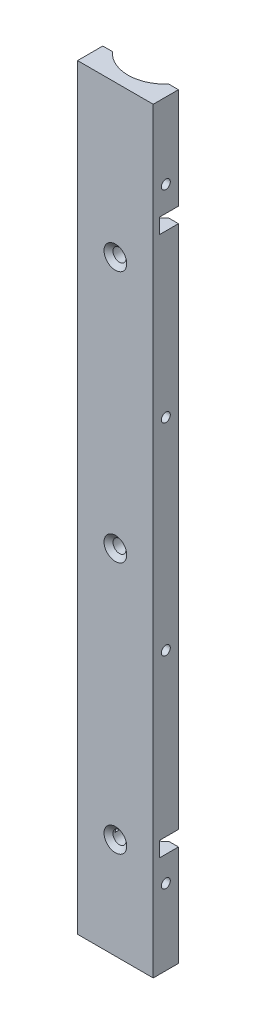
ISO-10303-21;
HEADER;
FILE_DESCRIPTION(('STEP AP214'),'2;1');
FILE_NAME('part.step','',(''),(''),'','','');
FILE_SCHEMA(('AUTOMOTIVE_DESIGN { 1 0 10303 214 1 1 1 1 }'));
ENDSEC;
DATA;
#1=APPLICATION_CONTEXT('core data for automotive mechanical design processes');
#2=APPLICATION_PROTOCOL_DEFINITION('international standard','automotive_design',2000,#1);
#3=PRODUCT_CONTEXT('',#1,'mechanical');
#4=PRODUCT('Part','Part','',(#3));
#5=PRODUCT_RELATED_PRODUCT_CATEGORY('part','',(#4));
#6=PRODUCT_DEFINITION_FORMATION('','',#4);
#7=PRODUCT_DEFINITION_CONTEXT('part definition',#1,'design');
#8=PRODUCT_DEFINITION('design','',#6,#7);
#9=PRODUCT_DEFINITION_SHAPE('','',#8);
#10=(LENGTH_UNIT() NAMED_UNIT(*) SI_UNIT(.MILLI.,.METRE.));
#11=(NAMED_UNIT(*) PLANE_ANGLE_UNIT() SI_UNIT($,.RADIAN.));
#12=(NAMED_UNIT(*) SI_UNIT($,.STERADIAN.) SOLID_ANGLE_UNIT());
#13=UNCERTAINTY_MEASURE_WITH_UNIT(LENGTH_MEASURE(1.E-05),#10,'distance_accuracy_value','');
#14=(GEOMETRIC_REPRESENTATION_CONTEXT(3) GLOBAL_UNCERTAINTY_ASSIGNED_CONTEXT((#13)) GLOBAL_UNIT_ASSIGNED_CONTEXT((#10,
#11,#12)) REPRESENTATION_CONTEXT('',''));
#15=CARTESIAN_POINT('',(0.,0.,0.));
#16=DIRECTION('',(0.,0.,1.));
#17=DIRECTION('',(1.,0.,0.));
#18=AXIS2_PLACEMENT_3D('',#15,#16,#17);
#19=CARTESIAN_POINT('',(9.525,190.5,0.));
#20=DIRECTION('',(-1.,0.,0.));
#21=DIRECTION('',(0.,0.,1.));
#22=AXIS2_PLACEMENT_3D('',#19,#20,#21);
#23=PLANE('',#22);
#24=CARTESIAN_POINT('',(9.525,171.45,-3.175));
#25=DIRECTION('',(1.,0.,0.));
#26=DIRECTION('',(0.,0.,-1.));
#27=AXIS2_PLACEMENT_3D('',#24,#25,#26);
#28=CIRCLE('',#27,1.1303);
#29=CARTESIAN_POINT('',(9.525,171.45,-4.3053));
#30=VERTEX_POINT('',#29);
#31=EDGE_CURVE('E1073',#30,#30,#28,.T.);
#32=ORIENTED_EDGE('',*,*,#31,.F.);
#33=EDGE_LOOP('',(#32));
#34=FACE_BOUND('',#33,.T.);
#35=CARTESIAN_POINT('',(9.525,19.05,-3.175));
#36=DIRECTION('',(1.,0.,0.));
#37=DIRECTION('',(0.,0.,-1.));
#38=AXIS2_PLACEMENT_3D('',#35,#36,#37);
#39=CIRCLE('',#38,1.1303);
#40=CARTESIAN_POINT('',(9.525,19.05,-4.30529999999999));
#41=VERTEX_POINT('',#40);
#42=EDGE_CURVE('E660',#41,#41,#39,.T.);
#43=ORIENTED_EDGE('',*,*,#42,.F.);
#44=EDGE_LOOP('',(#43));
#45=FACE_BOUND('',#44,.T.);
#46=DIRECTION('',(0.,-1.,0.));
#47=VECTOR('',#46,1.);
#48=CARTESIAN_POINT('',(9.525,190.5,-6.35));
#49=LINE('',#48,#47);
#50=CARTESIAN_POINT('',(9.525,25.4,-6.35));
#51=VERTEX_POINT('',#50);
#52=CARTESIAN_POINT('',(9.525,0.,-6.35));
#53=VERTEX_POINT('',#52);
#54=EDGE_CURVE('E428',#51,#53,#49,.T.);
#55=ORIENTED_EDGE('',*,*,#54,.F.);
#56=DIRECTION('',(0.,0.,-1.));
#57=VECTOR('',#56,1.);
#58=CARTESIAN_POINT('',(9.525,25.4,-6.35));
#59=LINE('',#58,#57);
#60=CARTESIAN_POINT('',(9.525,25.4,-1.58750000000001));
#61=VERTEX_POINT('',#60);
#62=EDGE_CURVE('E326',#61,#51,#59,.T.);
#63=ORIENTED_EDGE('',*,*,#62,.F.);
#64=DIRECTION('',(0.,-1.,0.));
#65=VECTOR('',#64,1.);
#66=CARTESIAN_POINT('',(9.525,25.4,-1.58750000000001));
#67=LINE('',#66,#65);
#68=CARTESIAN_POINT('',(9.525,29.21,-1.58750000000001));
#69=VERTEX_POINT('',#68);
#70=EDGE_CURVE('E656',#69,#61,#67,.T.);
#71=ORIENTED_EDGE('',*,*,#70,.F.);
#72=DIRECTION('',(0.,0.,1.));
#73=VECTOR('',#72,1.);
#74=CARTESIAN_POINT('',(9.525,29.21,-6.35));
#75=LINE('',#74,#73);
#76=CARTESIAN_POINT('',(9.525,29.21,-6.35));
#77=VERTEX_POINT('',#76);
#78=EDGE_CURVE('E654',#77,#69,#75,.T.);
#79=ORIENTED_EDGE('',*,*,#78,.F.);
#80=CARTESIAN_POINT('',(9.525,161.29,-6.35));
#81=VERTEX_POINT('',#80);
#82=EDGE_CURVE('E435',#81,#77,#49,.T.);
#83=ORIENTED_EDGE('',*,*,#82,.F.);
#84=DIRECTION('',(0.,0.,-1.));
#85=VECTOR('',#84,1.);
#86=CARTESIAN_POINT('',(9.525,161.29,-6.35));
#87=LINE('',#86,#85);
#88=CARTESIAN_POINT('',(9.525,161.29,-1.5875));
#89=VERTEX_POINT('',#88);
#90=EDGE_CURVE('E353',#89,#81,#87,.T.);
#91=ORIENTED_EDGE('',*,*,#90,.F.);
#92=DIRECTION('',(0.,-1.,0.));
#93=VECTOR('',#92,1.);
#94=CARTESIAN_POINT('',(9.525,165.1,-1.5875));
#95=LINE('',#94,#93);
#96=CARTESIAN_POINT('',(9.525,165.1,-1.5875));
#97=VERTEX_POINT('',#96);
#98=EDGE_CURVE('E350',#97,#89,#95,.T.);
#99=ORIENTED_EDGE('',*,*,#98,.F.);
#100=DIRECTION('',(0.,0.,1.));
#101=VECTOR('',#100,1.);
#102=CARTESIAN_POINT('',(9.525,165.1,-6.35));
#103=LINE('',#102,#101);
#104=CARTESIAN_POINT('',(9.525,165.1,-6.35));
#105=VERTEX_POINT('',#104);
#106=EDGE_CURVE('E347',#105,#97,#103,.T.);
#107=ORIENTED_EDGE('',*,*,#106,.F.);
#108=CARTESIAN_POINT('',(9.525,190.5,-6.35));
#109=VERTEX_POINT('',#108);
#110=EDGE_CURVE('E431',#109,#105,#49,.T.);
#111=ORIENTED_EDGE('',*,*,#110,.F.);
#112=DIRECTION('',(0.,0.,-1.));
#113=VECTOR('',#112,1.);
#114=CARTESIAN_POINT('',(9.525,190.5,0.));
#115=LINE('',#114,#113);
#116=CARTESIAN_POINT('',(9.525,190.5,0.));
#117=VERTEX_POINT('',#116);
#118=EDGE_CURVE('E410',#117,#109,#115,.T.);
#119=ORIENTED_EDGE('',*,*,#118,.F.);
#120=DIRECTION('',(0.,-1.,0.));
#121=VECTOR('',#120,1.);
#122=CARTESIAN_POINT('',(9.525,190.5,0.));
#123=LINE('',#122,#121);
#124=CARTESIAN_POINT('',(9.525,0.,0.));
#125=VERTEX_POINT('',#124);
#126=EDGE_CURVE('E434',#117,#125,#123,.T.);
#127=ORIENTED_EDGE('',*,*,#126,.T.);
#128=DIRECTION('',(0.,0.,-1.));
#129=VECTOR('',#128,1.);
#130=CARTESIAN_POINT('',(9.525,0.,0.));
#131=LINE('',#130,#129);
#132=EDGE_CURVE('E422',#125,#53,#131,.T.);
#133=ORIENTED_EDGE('',*,*,#132,.T.);
#134=EDGE_LOOP('',(#55,#63,#71,#79,#83,#91,#99,#107,#111,#119,#127,#133));
#135=FACE_BOUND('',#134,.T.);
#136=CARTESIAN_POINT('',(9.525,69.85,-3.175));
#137=DIRECTION('',(1.,0.,0.));
#138=DIRECTION('',(0.,0.,-1.));
#139=AXIS2_PLACEMENT_3D('',#136,#137,#138);
#140=CIRCLE('',#139,1.1303);
#141=CARTESIAN_POINT('',(9.525,69.85,-4.3053));
#142=VERTEX_POINT('',#141);
#143=EDGE_CURVE('E1083',#142,#142,#140,.T.);
#144=ORIENTED_EDGE('',*,*,#143,.F.);
#145=EDGE_LOOP('',(#144));
#146=FACE_BOUND('',#145,.T.);
#147=CARTESIAN_POINT('',(9.525,120.65,-3.175));
#148=DIRECTION('',(1.,0.,0.));
#149=DIRECTION('',(0.,0.,-1.));
#150=AXIS2_PLACEMENT_3D('',#147,#148,#149);
#151=CIRCLE('',#150,1.1303);
#152=CARTESIAN_POINT('',(9.525,120.65,-4.3053));
#153=VERTEX_POINT('',#152);
#154=EDGE_CURVE('E1078',#153,#153,#151,.T.);
#155=ORIENTED_EDGE('',*,*,#154,.F.);
#156=EDGE_LOOP('',(#155));
#157=FACE_BOUND('',#156,.T.);
#158=ADVANCED_FACE('F42',(#34,#45,#135,#146,#157),#23,.F.);
#159=CARTESIAN_POINT('',(0.,190.5,-12.7));
#160=DIRECTION('',(0.,-1.,0.));
#161=DIRECTION('',(0.,0.,-1.));
#162=AXIS2_PLACEMENT_3D('',#159,#160,#161);
#163=CYLINDRICAL_SURFACE('',#162,9.525);
#164=CARTESIAN_POINT('',(-1.143,17.9217975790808,-3.24382868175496));
#165=CARTESIAN_POINT('',(-1.23559401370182,17.9224920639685,-3.25502014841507));
#166=CARTESIAN_POINT('',(-1.32802441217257,17.9234138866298,-3.26757308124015));
#167=CARTESIAN_POINT('',(-1.51248203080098,17.9260395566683,-3.29538832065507));
#168=CARTESIAN_POINT('',(-1.60450917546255,17.9277435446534,-3.31065111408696));
#169=CARTESIAN_POINT('',(-1.78864765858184,17.9322755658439,-3.34397646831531));
#170=CARTESIAN_POINT('',(-1.88075565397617,17.9351108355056,-3.36205658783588));
#171=CARTESIAN_POINT('',(-2.06433479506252,17.9423308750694,-3.40091678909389));
#172=CARTESIAN_POINT('',(-2.15580598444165,17.946715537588,-3.42169668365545));
#173=CARTESIAN_POINT('',(-2.34156058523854,17.9577554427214,-3.46678778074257));
#174=CARTESIAN_POINT('',(-2.43581341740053,17.964493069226,-3.49120559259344));
#175=CARTESIAN_POINT('',(-2.6232887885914,17.9808879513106,-3.54284806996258));
#176=CARTESIAN_POINT('',(-2.71651143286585,17.9905449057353,-3.57007244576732));
#177=CARTESIAN_POINT('',(-2.90139780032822,18.0136141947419,-3.62713667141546));
#178=CARTESIAN_POINT('',(-2.99306520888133,18.027015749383,-3.65696884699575));
#179=CARTESIAN_POINT('',(-3.17468360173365,18.0586719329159,-3.7191199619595));
#180=CARTESIAN_POINT('',(-3.26463545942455,18.076924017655,-3.75143759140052));
#181=CARTESIAN_POINT('',(-3.40579424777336,18.1109526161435,-3.80453334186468));
#182=CARTESIAN_POINT('',(-3.45776203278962,18.1246746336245,-3.8246085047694));
#183=CARTESIAN_POINT('',(-3.56071542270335,18.1547032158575,-3.86540916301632));
#184=CARTESIAN_POINT('',(-3.61170071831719,18.1710105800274,-3.8861348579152));
#185=CARTESIAN_POINT('',(-3.71213961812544,18.2065718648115,-3.92796559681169));
#186=CARTESIAN_POINT('',(-3.7615998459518,18.2258099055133,-3.94906808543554));
#187=CARTESIAN_POINT('',(-3.85885822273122,18.2678442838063,-3.99151844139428));
#188=CARTESIAN_POINT('',(-3.90665722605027,18.2906387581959,-4.01286617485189));
#189=CARTESIAN_POINT('',(-4.00679139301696,18.344073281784,-4.05854806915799));
#190=CARTESIAN_POINT('',(-4.05878811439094,18.3753704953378,-4.08286944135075));
#191=CARTESIAN_POINT('',(-4.15856372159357,18.4448325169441,-4.13057683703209));
#192=CARTESIAN_POINT('',(-4.2063450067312,18.4829933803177,-4.15396338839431));
#193=CARTESIAN_POINT('',(-4.28252023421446,18.5554831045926,-4.1919502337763));
#194=CARTESIAN_POINT('',(-4.31254255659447,18.5877682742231,-4.20714580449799));
#195=CARTESIAN_POINT('',(-4.3678262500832,18.657028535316,-4.23544586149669));
#196=CARTESIAN_POINT('',(-4.39309605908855,18.6939951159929,-4.24855404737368));
#197=CARTESIAN_POINT('',(-4.43122720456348,18.7623401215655,-4.26850018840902));
#198=CARTESIAN_POINT('',(-4.44560504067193,18.7926467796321,-4.27608121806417));
#199=CARTESIAN_POINT('',(-4.46981251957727,18.8555048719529,-4.28890082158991));
#200=CARTESIAN_POINT('',(-4.47964652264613,18.8880541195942,-4.29414164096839));
#201=CARTESIAN_POINT('',(-4.49399189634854,18.9549438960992,-4.30180189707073));
#202=CARTESIAN_POINT('',(-4.4984586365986,18.9892969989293,-4.30419767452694));
#203=CARTESIAN_POINT('',(-4.50144002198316,19.0583338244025,-4.3057956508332));
#204=CARTESIAN_POINT('',(-4.49995691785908,19.0930174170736,-4.30499905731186));
#205=CARTESIAN_POINT('',(-4.4917410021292,19.157304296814,-4.30060099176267));
#206=CARTESIAN_POINT('',(-4.48565755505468,19.1870189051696,-4.29734653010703));
#207=CARTESIAN_POINT('',(-4.46949279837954,19.2450084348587,-4.28873714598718));
#208=CARTESIAN_POINT('',(-4.45940982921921,19.2732827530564,-4.28338135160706));
#209=CARTESIAN_POINT('',(-4.4310451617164,19.3391478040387,-4.26840399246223));
#210=CARTESIAN_POINT('',(-4.41109685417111,19.375824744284,-4.25793360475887));
#211=CARTESIAN_POINT('',(-4.36619138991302,19.4451276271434,-4.23462096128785));
#212=CARTESIAN_POINT('',(-4.3412225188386,19.4777438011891,-4.22177316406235));
#213=CARTESIAN_POINT('',(-4.27175265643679,19.5573011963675,-4.18648007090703));
#214=CARTESIAN_POINT('',(-4.22445457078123,19.6012552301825,-4.16286426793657));
#215=CARTESIAN_POINT('',(-4.12420411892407,19.6809360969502,-4.11398186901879));
#216=CARTESIAN_POINT('',(-4.07123855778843,19.7166430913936,-4.08871147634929));
#217=CARTESIAN_POINT('',(-3.96347068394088,19.780316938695,-4.0385947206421));
#218=CARTESIAN_POINT('',(-3.90878856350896,19.80850223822,-4.01376232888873));
#219=CARTESIAN_POINT('',(-3.79698696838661,19.859837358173,-3.96431115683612));
#220=CARTESIAN_POINT('',(-3.73986519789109,19.8829823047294,-3.93969260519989));
#221=CARTESIAN_POINT('',(-3.62373896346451,19.9251747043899,-3.89102073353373));
#222=CARTESIAN_POINT('',(-3.5647303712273,19.9442123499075,-3.86696888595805));
#223=CARTESIAN_POINT('',(-3.4454045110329,19.9788369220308,-3.81974488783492));
#224=CARTESIAN_POINT('',(-3.38508770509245,19.994425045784,-3.79657243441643));
#225=CARTESIAN_POINT('',(-3.25403157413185,20.0249207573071,-3.74776474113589));
#226=CARTESIAN_POINT('',(-3.1831188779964,20.0393530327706,-3.72230049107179));
#227=CARTESIAN_POINT('',(-3.04019841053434,20.0651093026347,-3.67289953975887));
#228=CARTESIAN_POINT('',(-2.96819036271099,20.076432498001,-3.64896323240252));
#229=CARTESIAN_POINT('',(-2.75072439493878,20.1066305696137,-3.57956759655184));
#230=CARTESIAN_POINT('',(-2.60394761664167,20.1217076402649,-3.53656746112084));
#231=CARTESIAN_POINT('',(-2.30796667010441,20.1451779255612,-3.45757482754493));
#232=CARTESIAN_POINT('',(-2.15876102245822,20.1535668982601,-3.42158678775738));
#233=CARTESIAN_POINT('',(-1.85870811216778,20.1660615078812,-3.35685469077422));
#234=CARTESIAN_POINT('',(-1.70786191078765,20.1701697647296,-3.3281062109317));
#235=CARTESIAN_POINT('',(-1.48765357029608,20.1743235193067,-3.29163287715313));
#236=CARTESIAN_POINT('',(-1.41877584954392,20.1753625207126,-3.2810001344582));
#237=CARTESIAN_POINT('',(-1.28096354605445,20.1770459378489,-3.26127181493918));
#238=CARTESIAN_POINT('',(-1.21202949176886,20.1776912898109,-3.25217262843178));
#239=CARTESIAN_POINT('',(-1.143,20.1782024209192,-3.24382868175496));
#240=B_SPLINE_CURVE_WITH_KNOTS('',3,(#164,#165,#166,#167,#168,#169,#170,#171,#172,#173,#174,
#175,#176,#177,#178,#179,#180,#181,#182,#183,#184,#185,#186,#187,#188,#189,#190,#191,#192,#193,
#194,#195,#196,#197,#198,#199,#200,#201,#202,#203,#204,#205,#206,#207,#208,#209,#210,#211,#212,
#213,#214,#215,#216,#217,#218,#219,#220,#221,#222,#223,#224,#225,#226,#227,#228,#229,#230,#231,
#232,#233,#234,#235,#236,#237,#238,#239),.UNSPECIFIED.,.F.,.F.,(4,2,2,2,2,2,2,2,2,2,2,2,2,2,2,2,
2,2,2,2,2,2,2,2,2,2,2,2,2,2,2,2,2,2,2,2,2,4),(0.,0.279805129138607,0.559660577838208,
0.841335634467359,1.12299117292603,1.41570439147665,1.70838742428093,2.00023641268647,
2.29193262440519,2.46400292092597,2.63612652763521,2.80734863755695,2.97848134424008,
3.17426622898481,3.36993894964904,3.50945139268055,3.64871374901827,3.75150625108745,
3.85419990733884,3.95774171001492,4.06124434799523,4.15236280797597,4.24351911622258,
4.37192169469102,4.50062742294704,4.7057216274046,4.9113041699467,5.11002949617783,
5.30894613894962,5.50833263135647,5.7076498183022,5.93769172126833,6.16779268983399,
6.62839488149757,7.08928897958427,7.54990083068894,7.75899066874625,7.9675812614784),.UNSPECIFIED.);
#241=CARTESIAN_POINT('',(-1.143,17.9217975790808,-3.24382868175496));
#242=VERTEX_POINT('',#241);
#243=CARTESIAN_POINT('',(-1.143,20.1782024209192,-3.24382868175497));
#244=VERTEX_POINT('',#243);
#245=EDGE_CURVE('E1021',#242,#244,#240,.T.);
#246=ORIENTED_EDGE('',*,*,#245,.F.);
#247=CARTESIAN_POINT('',(-1.21111527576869,20.2912575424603,-3.25231114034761));
#248=CARTESIAN_POINT('',(-1.15476450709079,20.1977413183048,-3.2450875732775));
#249=CARTESIAN_POINT('',(-1.09841054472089,20.1041872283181,-3.23837577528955));
#250=CARTESIAN_POINT('',(-0.98561443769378,19.9168703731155,-3.2259610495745));
#251=CARTESIAN_POINT('',(-0.929172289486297,19.8231075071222,-3.22025967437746));
#252=CARTESIAN_POINT('',(-0.841179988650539,19.6768864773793,-3.21216331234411));
#253=CARTESIAN_POINT('',(-0.809629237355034,19.624447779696,-3.20941900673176));
#254=CARTESIAN_POINT('',(-0.746562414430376,19.519607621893,-3.20424992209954));
#255=CARTESIAN_POINT('',(-0.71504634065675,19.4672061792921,-3.20182481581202));
#256=CARTESIAN_POINT('',(-0.666436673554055,19.3863580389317,-3.19832746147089));
#257=CARTESIAN_POINT('',(-0.649340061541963,19.3579179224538,-3.19714379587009));
#258=CARTESIAN_POINT('',(-0.61511198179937,19.3009640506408,-3.19486680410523));
#259=CARTESIAN_POINT('',(-0.597980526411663,19.2724502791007,-3.19377369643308));
#260=CARTESIAN_POINT('',(-0.571677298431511,19.228638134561,-3.19216666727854));
#261=CARTESIAN_POINT('',(-0.562499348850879,19.2133446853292,-3.19161927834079));
#262=CARTESIAN_POINT('',(-0.544214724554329,19.182851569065,-3.19055529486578));
#263=CARTESIAN_POINT('',(-0.53510797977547,19.167651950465,-3.19003852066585));
#264=CARTESIAN_POINT('',(-0.52120781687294,19.1443954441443,-3.18926971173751));
#265=CARTESIAN_POINT('',(-0.516402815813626,19.136345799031,-3.1890076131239));
#266=CARTESIAN_POINT('',(-0.509161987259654,19.124178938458,-3.1886181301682));
#267=CARTESIAN_POINT('',(-0.506718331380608,19.1200665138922,-3.18848763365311));
#268=CARTESIAN_POINT('',(-0.501847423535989,19.1118475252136,-3.18822939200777));
#269=CARTESIAN_POINT('',(-0.499420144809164,19.1077409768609,-3.1881016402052));
#270=CARTESIAN_POINT('',(-0.494536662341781,19.099441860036,-3.1878464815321));
#271=CARTESIAN_POINT('',(-0.492080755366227,19.0952491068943,-3.18771912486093));
#272=CARTESIAN_POINT('',(-0.487183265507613,19.0867983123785,-3.18746702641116));
#273=CARTESIAN_POINT('',(-0.484742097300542,19.0825400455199,-3.18734232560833));
#274=CARTESIAN_POINT('',(-0.480055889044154,19.0741647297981,-3.18710472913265));
#275=CARTESIAN_POINT('',(-0.477806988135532,19.0700501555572,-3.18699155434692));
#276=CARTESIAN_POINT('',(-0.474739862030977,19.0637805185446,-3.1868381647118));
#277=CARTESIAN_POINT('',(-0.473776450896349,19.0616950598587,-3.18679015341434));
#278=CARTESIAN_POINT('',(-0.472119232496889,19.0574215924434,-3.18670776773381));
#279=CARTESIAN_POINT('',(-0.471422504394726,19.0552350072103,-3.18667324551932));
#280=CARTESIAN_POINT('',(-0.471031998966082,19.0526922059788,-3.18665390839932));
#281=CARTESIAN_POINT('',(-0.470992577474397,19.0523945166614,-3.18665195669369));
#282=CARTESIAN_POINT('',(-0.470927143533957,19.0517975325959,-3.18664871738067));
#283=CARTESIAN_POINT('',(-0.4709011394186,19.0514982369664,-3.18664743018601));
#284=CARTESIAN_POINT('',(-0.470844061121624,19.0505989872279,-3.18664460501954));
#285=CARTESIAN_POINT('',(-0.470833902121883,19.0499975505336,-3.18664410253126));
#286=CARTESIAN_POINT('',(-0.470893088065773,19.0482010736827,-3.18664703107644));
#287=CARTESIAN_POINT('',(-0.47105121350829,19.0470085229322,-3.18665485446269));
#288=CARTESIAN_POINT('',(-0.471962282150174,19.0425427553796,-3.18669999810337));
#289=CARTESIAN_POINT('',(-0.4732737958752,19.0394089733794,-3.18676507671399));
#290=CARTESIAN_POINT('',(-0.476170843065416,19.0332087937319,-3.18690961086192));
#291=CARTESIAN_POINT('',(-0.477763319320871,19.030147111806,-3.18698943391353));
#292=CARTESIAN_POINT('',(-0.483079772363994,19.0202599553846,-3.18725737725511));
#293=CARTESIAN_POINT('',(-0.48697883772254,19.0135158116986,-3.18745609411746));
#294=CARTESIAN_POINT('',(-0.494827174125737,19.0000593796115,-3.18786107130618));
#295=CARTESIAN_POINT('',(-0.498776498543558,18.9933471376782,-3.18806734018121));
#296=CARTESIAN_POINT('',(-0.506640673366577,18.9800547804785,-3.18848301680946));
#297=CARTESIAN_POINT('',(-0.510554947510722,18.9734743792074,-3.188692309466));
#298=CARTESIAN_POINT('',(-0.518392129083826,18.9603233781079,-3.18911623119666));
#299=CARTESIAN_POINT('',(-0.522315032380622,18.9537527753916,-3.18933085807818));
#300=CARTESIAN_POINT('',(-0.541999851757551,18.9208143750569,-3.19042009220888));
#301=CARTESIAN_POINT('',(-0.557804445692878,18.8944726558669,-3.19133396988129));
#302=CARTESIAN_POINT('',(-0.589427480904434,18.8417953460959,-3.19324179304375));
#303=CARTESIAN_POINT('',(-0.605245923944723,18.8154597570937,-3.19423575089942));
#304=CARTESIAN_POINT('',(-0.652988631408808,18.7360013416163,-3.19735543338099));
#305=CARTESIAN_POINT('',(-0.684922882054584,18.6828891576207,-3.19960363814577));
#306=CARTESIAN_POINT('',(-0.758392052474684,18.5607231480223,-3.20514867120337));
#307=CARTESIAN_POINT('',(-0.799928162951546,18.4916751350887,-3.20855759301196));
#308=CARTESIAN_POINT('',(-0.883003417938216,18.35360806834,-3.21592551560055));
#309=CARTESIAN_POINT('',(-0.924542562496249,18.2845890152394,-3.21988452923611));
#310=CARTESIAN_POINT('',(-1.00692212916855,18.1477436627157,-3.22828324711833));
#311=CARTESIAN_POINT('',(-1.04776256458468,18.0799168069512,-3.23271375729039));
#312=CARTESIAN_POINT('',(-1.1294408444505,17.9443007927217,-3.2421102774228));
#313=CARTESIAN_POINT('',(-1.17027868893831,17.8765116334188,-3.24707627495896));
#314=CARTESIAN_POINT('',(-1.21111527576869,17.8087424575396,-3.25231114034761));
#315=B_SPLINE_CURVE_WITH_KNOTS('',3,(#247,#248,#249,#250,#251,#252,#253,#254,#255,#256,#257,
#258,#259,#260,#261,#262,#263,#264,#265,#266,#267,#268,#269,#270,#271,#272,#273,#274,#275,#276,
#277,#278,#279,#280,#281,#282,#283,#284,#285,#286,#287,#288,#289,#290,#291,#292,#293,#294,#295,
#296,#297,#298,#299,#300,#301,#302,#303,#304,#305,#306,#307,#308,#309,#310,#311,#312,#313,#314),
.UNSPECIFIED.,.F.,.F.,(4,2,2,2,2,2,2,2,2,2,2,2,2,2,2,2,2,2,2,2,2,2,2,2,2,2,2,2,2,2,2,2,2,4),(0.,
0.32826114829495,0.657022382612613,0.840801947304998,1.02439159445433,1.12400483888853,
1.22385181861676,1.27738512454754,1.33056451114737,1.35869959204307,1.37305587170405,
1.3873720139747,1.4019532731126,1.41668619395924,1.43074374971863,1.43763978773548,
1.44445797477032,1.44535845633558,1.44625949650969,1.44806121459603,1.45164870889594,
1.46172720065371,1.47210303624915,1.49545451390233,1.51883329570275,1.54180976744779,
1.56477694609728,1.65697436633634,1.74918605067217,1.93522744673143,2.17717698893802,
2.4191321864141,2.65702211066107,2.89490651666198),.UNSPECIFIED.);
#316=EDGE_CURVE('E1015',#244,#242,#315,.T.);
#317=ORIENTED_EDGE('',*,*,#316,.F.);
#318=EDGE_LOOP('',(#246,#317));
#319=FACE_BOUND('',#318,.T.);
#320=CARTESIAN_POINT('',(1.143,20.1782024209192,-3.24382868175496));
#321=CARTESIAN_POINT('',(1.23559401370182,20.1775079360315,-3.25502014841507));
#322=CARTESIAN_POINT('',(1.32802441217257,20.1765861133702,-3.26757308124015));
#323=CARTESIAN_POINT('',(1.51248203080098,20.1739604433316,-3.29538832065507));
#324=CARTESIAN_POINT('',(1.60450917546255,20.1722564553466,-3.31065111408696));
#325=CARTESIAN_POINT('',(1.78864765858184,20.167724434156,-3.34397646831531));
#326=CARTESIAN_POINT('',(1.88075565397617,20.1648891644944,-3.36205658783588));
#327=CARTESIAN_POINT('',(2.06433479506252,20.1576691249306,-3.40091678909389));
#328=CARTESIAN_POINT('',(2.15580598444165,20.153284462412,-3.42169668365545));
#329=CARTESIAN_POINT('',(2.34156058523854,20.1422445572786,-3.46678778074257));
#330=CARTESIAN_POINT('',(2.43581341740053,20.135506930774,-3.49120559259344));
#331=CARTESIAN_POINT('',(2.6232887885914,20.1191120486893,-3.54284806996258));
#332=CARTESIAN_POINT('',(2.71651143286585,20.1094550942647,-3.57007244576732));
#333=CARTESIAN_POINT('',(2.90139780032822,20.0863858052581,-3.62713667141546));
#334=CARTESIAN_POINT('',(2.99306520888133,20.072984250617,-3.65696884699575));
#335=CARTESIAN_POINT('',(3.17468360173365,20.0413280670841,-3.7191199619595));
#336=CARTESIAN_POINT('',(3.26463545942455,20.023075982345,-3.75143759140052));
#337=CARTESIAN_POINT('',(3.40579424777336,19.9890473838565,-3.80453334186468));
#338=CARTESIAN_POINT('',(3.45776203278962,19.9753253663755,-3.8246085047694));
#339=CARTESIAN_POINT('',(3.56071542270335,19.9452967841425,-3.86540916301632));
#340=CARTESIAN_POINT('',(3.61170071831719,19.9289894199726,-3.8861348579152));
#341=CARTESIAN_POINT('',(3.71213961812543,19.8934281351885,-3.92796559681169));
#342=CARTESIAN_POINT('',(3.7615998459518,19.8741900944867,-3.94906808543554));
#343=CARTESIAN_POINT('',(3.85885822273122,19.8321557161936,-3.99151844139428));
#344=CARTESIAN_POINT('',(3.90665722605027,19.8093612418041,-4.01286617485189));
#345=CARTESIAN_POINT('',(4.00679139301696,19.755926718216,-4.05854806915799));
#346=CARTESIAN_POINT('',(4.05878811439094,19.7246295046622,-4.08286944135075));
#347=CARTESIAN_POINT('',(4.15856372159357,19.6551674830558,-4.13057683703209));
#348=CARTESIAN_POINT('',(4.2063450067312,19.6170066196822,-4.15396338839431));
#349=CARTESIAN_POINT('',(4.28252023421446,19.5445168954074,-4.1919502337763));
#350=CARTESIAN_POINT('',(4.31254255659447,19.5122317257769,-4.20714580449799));
#351=CARTESIAN_POINT('',(4.3678262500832,19.442971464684,-4.23544586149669));
#352=CARTESIAN_POINT('',(4.39309605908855,19.4060048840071,-4.24855404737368));
#353=CARTESIAN_POINT('',(4.43122720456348,19.3376598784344,-4.26850018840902));
#354=CARTESIAN_POINT('',(4.44560504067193,19.3073532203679,-4.27608121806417));
#355=CARTESIAN_POINT('',(4.46981251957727,19.2444951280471,-4.28890082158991));
#356=CARTESIAN_POINT('',(4.47964652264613,19.2119458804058,-4.29414164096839));
#357=CARTESIAN_POINT('',(4.49399189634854,19.1450561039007,-4.30180189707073));
#358=CARTESIAN_POINT('',(4.4984586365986,19.1107030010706,-4.30419767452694));
#359=CARTESIAN_POINT('',(4.50144002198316,19.0416661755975,-4.3057956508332));
#360=CARTESIAN_POINT('',(4.49995691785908,19.0069825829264,-4.30499905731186));
#361=CARTESIAN_POINT('',(4.4917410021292,18.942695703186,-4.30060099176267));
#362=CARTESIAN_POINT('',(4.48565755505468,18.9129810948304,-4.29734653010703));
#363=CARTESIAN_POINT('',(4.46949279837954,18.8549915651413,-4.28873714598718));
#364=CARTESIAN_POINT('',(4.45940982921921,18.8267172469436,-4.28338135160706));
#365=CARTESIAN_POINT('',(4.4310451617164,18.7608521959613,-4.26840399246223));
#366=CARTESIAN_POINT('',(4.41109685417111,18.724175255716,-4.25793360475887));
#367=CARTESIAN_POINT('',(4.36619138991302,18.6548723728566,-4.23462096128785));
#368=CARTESIAN_POINT('',(4.3412225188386,18.6222561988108,-4.22177316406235));
#369=CARTESIAN_POINT('',(4.27175265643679,18.5426988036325,-4.18648007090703));
#370=CARTESIAN_POINT('',(4.22445457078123,18.4987447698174,-4.16286426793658));
#371=CARTESIAN_POINT('',(4.12420411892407,18.4190639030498,-4.11398186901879));
#372=CARTESIAN_POINT('',(4.07123855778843,18.3833569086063,-4.08871147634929));
#373=CARTESIAN_POINT('',(3.96347068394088,18.319683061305,-4.0385947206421));
#374=CARTESIAN_POINT('',(3.90878856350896,18.29149776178,-4.01376232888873));
#375=CARTESIAN_POINT('',(3.79698696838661,18.240162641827,-3.96431115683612));
#376=CARTESIAN_POINT('',(3.73986519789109,18.2170176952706,-3.93969260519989));
#377=CARTESIAN_POINT('',(3.62373896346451,18.1748252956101,-3.89102073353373));
#378=CARTESIAN_POINT('',(3.5647303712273,18.1557876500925,-3.86696888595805));
#379=CARTESIAN_POINT('',(3.4454045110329,18.1211630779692,-3.81974488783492));
#380=CARTESIAN_POINT('',(3.38508770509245,18.105574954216,-3.79657243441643));
#381=CARTESIAN_POINT('',(3.25403157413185,18.0750792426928,-3.74776474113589));
#382=CARTESIAN_POINT('',(3.1831188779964,18.0606469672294,-3.72230049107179));
#383=CARTESIAN_POINT('',(3.04019841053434,18.0348906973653,-3.67289953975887));
#384=CARTESIAN_POINT('',(2.968190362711,18.023567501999,-3.64896323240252));
#385=CARTESIAN_POINT('',(2.75072439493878,17.9933694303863,-3.57956759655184));
#386=CARTESIAN_POINT('',(2.60394761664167,17.978292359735,-3.53656746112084));
#387=CARTESIAN_POINT('',(2.30796667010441,17.9548220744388,-3.45757482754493));
#388=CARTESIAN_POINT('',(2.15876102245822,17.9464331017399,-3.42158678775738));
#389=CARTESIAN_POINT('',(1.85870811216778,17.9339384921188,-3.35685469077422));
#390=CARTESIAN_POINT('',(1.70786191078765,17.9298302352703,-3.3281062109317));
#391=CARTESIAN_POINT('',(1.48765357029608,17.9256764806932,-3.29163287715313));
#392=CARTESIAN_POINT('',(1.41877584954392,17.9246374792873,-3.2810001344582));
#393=CARTESIAN_POINT('',(1.28096354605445,17.922954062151,-3.26127181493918));
#394=CARTESIAN_POINT('',(1.21202949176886,17.922308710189,-3.25217262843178));
#395=CARTESIAN_POINT('',(1.143,17.9217975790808,-3.24382868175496));
#396=B_SPLINE_CURVE_WITH_KNOTS('',3,(#320,#321,#322,#323,#324,#325,#326,#327,#328,#329,#330,
#331,#332,#333,#334,#335,#336,#337,#338,#339,#340,#341,#342,#343,#344,#345,#346,#347,#348,#349,
#350,#351,#352,#353,#354,#355,#356,#357,#358,#359,#360,#361,#362,#363,#364,#365,#366,#367,#368,
#369,#370,#371,#372,#373,#374,#375,#376,#377,#378,#379,#380,#381,#382,#383,#384,#385,#386,#387,
#388,#389,#390,#391,#392,#393,#394,#395),.UNSPECIFIED.,.F.,.F.,(4,2,2,2,2,2,2,2,2,2,2,2,2,2,2,2,
2,2,2,2,2,2,2,2,2,2,2,2,2,2,2,2,2,2,2,2,2,4),(0.,0.279805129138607,0.559660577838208,
0.841335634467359,1.12299117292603,1.41570439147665,1.70838742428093,2.00023641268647,
2.29193262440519,2.46400292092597,2.63612652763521,2.80734863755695,2.97848134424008,
3.17426622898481,3.36993894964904,3.50945139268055,3.64871374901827,3.75150625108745,
3.85419990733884,3.95774171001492,4.06124434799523,4.15236280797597,4.24351911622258,
4.37192169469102,4.50062742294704,4.70572162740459,4.9113041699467,5.11002949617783,
5.30894613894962,5.50833263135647,5.7076498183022,5.93769172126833,6.16779268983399,
6.62839488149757,7.08928897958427,7.54990083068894,7.75899066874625,7.9675812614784),.UNSPECIFIED.);
#397=CARTESIAN_POINT('',(1.143,20.1782024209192,-3.24382868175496));
#398=VERTEX_POINT('',#397);
#399=CARTESIAN_POINT('',(1.143,17.9217975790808,-3.24382868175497));
#400=VERTEX_POINT('',#399);
#401=EDGE_CURVE('E559',#398,#400,#396,.T.);
#402=ORIENTED_EDGE('',*,*,#401,.F.);
#403=CARTESIAN_POINT('',(1.21111527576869,17.8087424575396,-3.25231114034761));
#404=CARTESIAN_POINT('',(1.15476450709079,17.9022586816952,-3.2450875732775));
#405=CARTESIAN_POINT('',(1.09841054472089,17.9958127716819,-3.23837577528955));
#406=CARTESIAN_POINT('',(0.985614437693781,18.1831296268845,-3.2259610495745));
#407=CARTESIAN_POINT('',(0.929172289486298,18.2768924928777,-3.22025967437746));
#408=CARTESIAN_POINT('',(0.841179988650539,18.4231135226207,-3.21216331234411));
#409=CARTESIAN_POINT('',(0.809629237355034,18.475552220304,-3.20941900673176));
#410=CARTESIAN_POINT('',(0.746562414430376,18.580392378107,-3.20424992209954));
#411=CARTESIAN_POINT('',(0.71504634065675,18.6327938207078,-3.20182481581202));
#412=CARTESIAN_POINT('',(0.666436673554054,18.7136419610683,-3.19832746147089));
#413=CARTESIAN_POINT('',(0.649340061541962,18.7420820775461,-3.19714379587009));
#414=CARTESIAN_POINT('',(0.615111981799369,18.7990359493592,-3.19486680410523));
#415=CARTESIAN_POINT('',(0.597980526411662,18.8275497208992,-3.19377369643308));
#416=CARTESIAN_POINT('',(0.571677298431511,18.871361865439,-3.19216666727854));
#417=CARTESIAN_POINT('',(0.562499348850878,18.8866553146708,-3.19161927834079));
#418=CARTESIAN_POINT('',(0.544214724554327,18.917148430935,-3.19055529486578));
#419=CARTESIAN_POINT('',(0.535107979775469,18.9323480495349,-3.19003852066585));
#420=CARTESIAN_POINT('',(0.52120781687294,18.9556045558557,-3.18926971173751));
#421=CARTESIAN_POINT('',(0.516402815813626,18.963654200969,-3.1890076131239));
#422=CARTESIAN_POINT('',(0.509161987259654,18.975821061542,-3.1886181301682));
#423=CARTESIAN_POINT('',(0.506718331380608,18.9799334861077,-3.18848763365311));
#424=CARTESIAN_POINT('',(0.501847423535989,18.9881524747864,-3.18822939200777));
#425=CARTESIAN_POINT('',(0.499420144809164,18.9922590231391,-3.1881016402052));
#426=CARTESIAN_POINT('',(0.494536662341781,19.000558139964,-3.1878464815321));
#427=CARTESIAN_POINT('',(0.492080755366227,19.0047508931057,-3.18771912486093));
#428=CARTESIAN_POINT('',(0.487183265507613,19.0132016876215,-3.18746702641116));
#429=CARTESIAN_POINT('',(0.484742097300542,19.0174599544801,-3.18734232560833));
#430=CARTESIAN_POINT('',(0.480055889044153,19.0258352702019,-3.18710472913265));
#431=CARTESIAN_POINT('',(0.47780698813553,19.0299498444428,-3.18699155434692));
#432=CARTESIAN_POINT('',(0.474739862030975,19.0362194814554,-3.1868381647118));
#433=CARTESIAN_POINT('',(0.473776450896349,19.0383049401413,-3.18679015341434));
#434=CARTESIAN_POINT('',(0.472119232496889,19.0425784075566,-3.18670776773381));
#435=CARTESIAN_POINT('',(0.471422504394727,19.0447649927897,-3.18667324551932));
#436=CARTESIAN_POINT('',(0.471031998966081,19.0473077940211,-3.18665390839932));
#437=CARTESIAN_POINT('',(0.470992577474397,19.0476054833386,-3.18665195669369));
#438=CARTESIAN_POINT('',(0.470927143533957,19.0482024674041,-3.18664871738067));
#439=CARTESIAN_POINT('',(0.4709011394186,19.0485017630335,-3.18664743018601));
#440=CARTESIAN_POINT('',(0.470844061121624,19.0494010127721,-3.18664460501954));
#441=CARTESIAN_POINT('',(0.470833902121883,19.0500024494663,-3.18664410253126));
#442=CARTESIAN_POINT('',(0.470893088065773,19.0517989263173,-3.18664703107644));
#443=CARTESIAN_POINT('',(0.47105121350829,19.0529914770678,-3.18665485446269));
#444=CARTESIAN_POINT('',(0.471962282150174,19.0574572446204,-3.18669999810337));
#445=CARTESIAN_POINT('',(0.4732737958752,19.0605910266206,-3.18676507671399));
#446=CARTESIAN_POINT('',(0.476170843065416,19.0667912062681,-3.18690961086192));
#447=CARTESIAN_POINT('',(0.477763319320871,19.069852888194,-3.18698943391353));
#448=CARTESIAN_POINT('',(0.483079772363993,19.0797400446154,-3.18725737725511));
#449=CARTESIAN_POINT('',(0.486978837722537,19.0864841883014,-3.18745609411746));
#450=CARTESIAN_POINT('',(0.494827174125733,19.0999406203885,-3.18786107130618));
#451=CARTESIAN_POINT('',(0.498776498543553,19.1066528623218,-3.18806734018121));
#452=CARTESIAN_POINT('',(0.506640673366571,19.1199452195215,-3.18848301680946));
#453=CARTESIAN_POINT('',(0.510554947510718,19.1265256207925,-3.188692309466));
#454=CARTESIAN_POINT('',(0.518392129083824,19.1396766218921,-3.18911623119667));
#455=CARTESIAN_POINT('',(0.522315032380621,19.1462472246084,-3.18933085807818));
#456=CARTESIAN_POINT('',(0.54199985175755,19.179185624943,-3.19042009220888));
#457=CARTESIAN_POINT('',(0.557804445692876,19.2055273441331,-3.19133396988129));
#458=CARTESIAN_POINT('',(0.589427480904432,19.2582046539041,-3.19324179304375));
#459=CARTESIAN_POINT('',(0.605245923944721,19.2845402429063,-3.19423575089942));
#460=CARTESIAN_POINT('',(0.652988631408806,19.3639986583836,-3.19735543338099));
#461=CARTESIAN_POINT('',(0.684922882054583,19.4171108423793,-3.19960363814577));
#462=CARTESIAN_POINT('',(0.758392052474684,19.5392768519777,-3.20514867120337));
#463=CARTESIAN_POINT('',(0.799928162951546,19.6083248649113,-3.20855759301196));
#464=CARTESIAN_POINT('',(0.883003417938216,19.74639193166,-3.21592551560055));
#465=CARTESIAN_POINT('',(0.924542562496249,19.8154109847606,-3.21988452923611));
#466=CARTESIAN_POINT('',(1.00692212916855,19.9522563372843,-3.22828324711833));
#467=CARTESIAN_POINT('',(1.04776256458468,20.0200831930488,-3.2327137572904));
#468=CARTESIAN_POINT('',(1.1294408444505,20.1556992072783,-3.2421102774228));
#469=CARTESIAN_POINT('',(1.17027868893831,20.2234883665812,-3.24707627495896));
#470=CARTESIAN_POINT('',(1.21111527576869,20.2912575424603,-3.25231114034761));
#471=B_SPLINE_CURVE_WITH_KNOTS('',3,(#403,#404,#405,#406,#407,#408,#409,#410,#411,#412,#413,
#414,#415,#416,#417,#418,#419,#420,#421,#422,#423,#424,#425,#426,#427,#428,#429,#430,#431,#432,
#433,#434,#435,#436,#437,#438,#439,#440,#441,#442,#443,#444,#445,#446,#447,#448,#449,#450,#451,
#452,#453,#454,#455,#456,#457,#458,#459,#460,#461,#462,#463,#464,#465,#466,#467,#468,#469,#470),
.UNSPECIFIED.,.F.,.F.,(4,2,2,2,2,2,2,2,2,2,2,2,2,2,2,2,2,2,2,2,2,2,2,2,2,2,2,2,2,2,2,2,2,4),(0.,
0.328261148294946,0.657022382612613,0.840801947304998,1.02439159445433,1.12400483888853,
1.22385181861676,1.27738512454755,1.33056451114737,1.35869959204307,1.37305587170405,
1.3873720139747,1.4019532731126,1.41668619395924,1.43074374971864,1.43763978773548,
1.44445797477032,1.44535845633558,1.44625949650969,1.44806121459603,1.45164870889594,
1.46172720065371,1.47210303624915,1.49545451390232,1.51883329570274,1.54180976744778,
1.56477694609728,1.65697436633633,1.74918605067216,1.93522744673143,2.17717698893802,
2.4191321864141,2.65702211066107,2.89490651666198),.UNSPECIFIED.);
#472=EDGE_CURVE('E552',#400,#398,#471,.T.);
#473=ORIENTED_EDGE('',*,*,#472,.F.);
#474=EDGE_LOOP('',(#402,#473));
#475=FACE_BOUND('',#474,.T.);
#476=CARTESIAN_POINT('',(0.,25.4,-12.7));
#477=DIRECTION('',(0.,-1.,0.));
#478=DIRECTION('',(0.,0.,-1.));
#479=AXIS2_PLACEMENT_3D('',#476,#477,#478);
#480=CIRCLE('',#479,9.525);
#481=CARTESIAN_POINT('',(7.09951582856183,25.4,-6.35));
#482=VERTEX_POINT('',#481);
#483=CARTESIAN_POINT('',(1.63195,25.4,-3.31584504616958));
#484=VERTEX_POINT('',#483);
#485=EDGE_CURVE('E344',#482,#484,#480,.T.);
#486=ORIENTED_EDGE('',*,*,#485,.F.);
#487=DIRECTION('',(0.,-1.,0.));
#488=VECTOR('',#487,1.);
#489=CARTESIAN_POINT('',(7.09951582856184,190.5,-6.35));
#490=LINE('',#489,#488);
#491=CARTESIAN_POINT('',(7.09951582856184,0.,-6.35));
#492=VERTEX_POINT('',#491);
#493=EDGE_CURVE('E430',#482,#492,#490,.T.);
#494=ORIENTED_EDGE('',*,*,#493,.T.);
#495=CARTESIAN_POINT('',(0.,0.,-12.7));
#496=DIRECTION('',(0.,1.,0.));
#497=DIRECTION('',(0.,0.,1.));
#498=AXIS2_PLACEMENT_3D('',#495,#496,#497);
#499=CIRCLE('',#498,9.525);
#500=CARTESIAN_POINT('',(-7.09951582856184,0.,-6.35));
#501=VERTEX_POINT('',#500);
#502=EDGE_CURVE('E412',#501,#492,#499,.T.);
#503=ORIENTED_EDGE('',*,*,#502,.F.);
#504=DIRECTION('',(0.,-1.,0.));
#505=VECTOR('',#504,1.);
#506=CARTESIAN_POINT('',(-7.09951582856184,190.5,-6.35));
#507=LINE('',#506,#505);
#508=CARTESIAN_POINT('',(-7.09951582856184,25.4,-6.35));
#509=VERTEX_POINT('',#508);
#510=EDGE_CURVE('E445',#509,#501,#507,.T.);
#511=ORIENTED_EDGE('',*,*,#510,.F.);
#512=CARTESIAN_POINT('',(-1.63195,25.4,-3.31584504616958));
#513=VERTEX_POINT('',#512);
#514=EDGE_CURVE('E333',#513,#509,#480,.T.);
#515=ORIENTED_EDGE('',*,*,#514,.F.);
#516=CARTESIAN_POINT('',(1.63195,25.4,-3.31584504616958));
#517=CARTESIAN_POINT('',(1.63194637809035,25.3090573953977,-3.31584337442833));
#518=CARTESIAN_POINT('',(1.62432239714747,25.2180660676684,-3.31450871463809));
#519=CARTESIAN_POINT('',(1.59404272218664,25.0386391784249,-3.30931952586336));
#520=CARTESIAN_POINT('',(1.57137340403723,24.9502060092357,-3.30546271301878));
#521=CARTESIAN_POINT('',(1.51171124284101,24.7785179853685,-3.2956785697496));
#522=CARTESIAN_POINT('',(1.47473066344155,24.6952587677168,-3.28975301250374));
#523=CARTESIAN_POINT('',(1.38752670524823,24.5361348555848,-3.27650113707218));
#524=CARTESIAN_POINT('',(1.33730471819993,24.4602693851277,-3.26917496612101));
#525=CARTESIAN_POINT('',(1.22448596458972,24.3172884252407,-3.25386212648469));
#526=CARTESIAN_POINT('',(1.16177822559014,24.2502610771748,-3.24586993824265));
#527=CARTESIAN_POINT('',(1.02600784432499,24.1276251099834,-3.23017455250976));
#528=CARTESIAN_POINT('',(0.952944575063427,24.0720171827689,-3.22247137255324));
#529=CARTESIAN_POINT('',(0.797964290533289,23.9734662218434,-3.20816337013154));
#530=CARTESIAN_POINT('',(0.715994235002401,23.9306054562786,-3.20156579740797));
#531=CARTESIAN_POINT('',(0.545885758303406,23.8592945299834,-3.19027387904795));
#532=CARTESIAN_POINT('',(0.45774776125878,23.8308433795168,-3.18557940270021));
#533=CARTESIAN_POINT('',(0.278716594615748,23.7894295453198,-3.17866158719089));
#534=CARTESIAN_POINT('',(0.187858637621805,23.7763186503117,-3.17641461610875));
#535=CARTESIAN_POINT('',(0.00520662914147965,23.7654964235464,-3.17456373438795));
#536=CARTESIAN_POINT('',(-0.0865873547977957,23.7677839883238,-3.1749596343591));
#537=CARTESIAN_POINT('',(-0.267491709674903,23.7875785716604,-3.17833123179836));
#538=CARTESIAN_POINT('',(-0.356620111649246,23.8049260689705,-3.18127988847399));
#539=CARTESIAN_POINT('',(-0.530681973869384,23.854096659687,-3.18939550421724));
#540=CARTESIAN_POINT('',(-0.615615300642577,23.8859202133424,-3.19456253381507));
#541=CARTESIAN_POINT('',(-0.779347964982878,23.963296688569,-3.20658019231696));
#542=CARTESIAN_POINT('',(-0.858115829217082,24.0089149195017,-3.21343880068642));
#543=CARTESIAN_POINT('',(-1.00693866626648,24.1125379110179,-3.22807835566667));
#544=CARTESIAN_POINT('',(-1.07699289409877,24.170543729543,-3.23585938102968));
#545=CARTESIAN_POINT('',(-1.20734296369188,24.2981788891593,-3.25159688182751));
#546=CARTESIAN_POINT('',(-1.26750221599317,24.3679476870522,-3.25955432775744));
#547=CARTESIAN_POINT('',(-1.37528304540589,24.5166595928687,-3.27465159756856));
#548=CARTESIAN_POINT('',(-1.42290449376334,24.5956027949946,-3.28179141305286));
#549=CARTESIAN_POINT('',(-1.50428733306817,24.7605858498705,-3.29444573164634));
#550=CARTESIAN_POINT('',(-1.53803155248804,24.8466343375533,-3.29995821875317));
#551=CARTESIAN_POINT('',(-1.59054799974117,25.0232940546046,-3.3087009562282));
#552=CARTESIAN_POINT('',(-1.60932162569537,25.1139048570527,-3.311931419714));
#553=CARTESIAN_POINT('',(-1.63117012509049,25.2958929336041,-3.31570290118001));
#554=CARTESIAN_POINT('',(-1.63444003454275,25.3872461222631,-3.31627732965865));
#555=CARTESIAN_POINT('',(-1.62570868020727,25.569194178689,-3.31476078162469));
#556=CARTESIAN_POINT('',(-1.61370804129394,25.6597890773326,-3.3126699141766));
#557=CARTESIAN_POINT('',(-1.57494278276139,25.8370247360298,-3.30608928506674));
#558=CARTESIAN_POINT('',(-1.54827807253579,25.9236880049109,-3.30161576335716));
#559=CARTESIAN_POINT('',(-1.48104662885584,26.0913161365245,-3.29078758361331));
#560=CARTESIAN_POINT('',(-1.44047902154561,26.1722806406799,-3.28443280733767));
#561=CARTESIAN_POINT('',(-1.3461354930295,26.3270791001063,-3.27048084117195));
#562=CARTESIAN_POINT('',(-1.29223496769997,26.4008360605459,-3.26287217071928));
#563=CARTESIAN_POINT('',(-1.17292601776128,26.5383283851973,-3.24730302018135));
#564=CARTESIAN_POINT('',(-1.10751673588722,26.6020630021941,-3.23934251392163));
#565=CARTESIAN_POINT('',(-0.966181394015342,26.7184171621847,-3.22386059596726));
#566=CARTESIAN_POINT('',(-0.890147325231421,26.7709063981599,-3.2163449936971));
#567=CARTESIAN_POINT('',(-0.730226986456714,26.8623656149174,-3.20269383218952));
#568=CARTESIAN_POINT('',(-0.646340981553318,26.9013360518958,-3.19655822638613));
#569=CARTESIAN_POINT('',(-0.47347926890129,26.9644503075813,-3.18638356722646));
#570=CARTESIAN_POINT('',(-0.384528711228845,26.9886614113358,-3.18233501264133));
#571=CARTESIAN_POINT('',(-0.203748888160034,27.0217860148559,-3.17675036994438));
#572=CARTESIAN_POINT('',(-0.111919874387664,27.0307008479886,-3.17521406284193));
#573=CARTESIAN_POINT('',(0.0707542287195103,27.0329397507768,-3.17483038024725));
#574=CARTESIAN_POINT('',(0.161596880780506,27.0264617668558,-3.17594886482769));
#575=CARTESIAN_POINT('',(0.34087975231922,26.9985282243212,-3.18067913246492));
#576=CARTESIAN_POINT('',(0.429319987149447,26.9770727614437,-3.18429089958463));
#577=CARTESIAN_POINT('',(0.601205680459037,26.9198709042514,-3.19360309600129));
#578=CARTESIAN_POINT('',(0.684657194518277,26.884142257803,-3.19930093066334));
#579=CARTESIAN_POINT('',(0.844411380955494,26.79943061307,-3.21216438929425));
#580=CARTESIAN_POINT('',(0.920713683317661,26.7504469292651,-3.2193300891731));
#581=CARTESIAN_POINT('',(1.06499842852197,26.639918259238,-3.23444473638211));
#582=CARTESIAN_POINT('',(1.13286926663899,26.5782287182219,-3.24240209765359));
#583=CARTESIAN_POINT('',(1.25736535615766,26.4443422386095,-3.25814609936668));
#584=CARTESIAN_POINT('',(1.31398796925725,26.3721428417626,-3.26593269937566));
#585=CARTESIAN_POINT('',(1.41477394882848,26.2186396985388,-3.28051700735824));
#586=CARTESIAN_POINT('',(1.458840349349,26.1372715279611,-3.28730683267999));
#587=CARTESIAN_POINT('',(1.53261074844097,25.9682029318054,-3.29903535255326));
#588=CARTESIAN_POINT('',(1.5623289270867,25.8805088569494,-3.303975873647));
#589=CARTESIAN_POINT('',(1.60019311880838,25.7270750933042,-3.31036460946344));
#590=CARTESIAN_POINT('',(1.61208256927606,25.6622582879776,-3.31240818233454));
#591=CARTESIAN_POINT('',(1.62796224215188,25.531636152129,-3.31514899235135));
#592=CARTESIAN_POINT('',(1.63195262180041,25.4658308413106,-3.31584625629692));
#593=CARTESIAN_POINT('',(1.63195,25.4,-3.31584504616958));
#594=B_SPLINE_CURVE_WITH_KNOTS('',3,(#516,#517,#518,#519,#520,#521,#522,#523,#524,#525,#526,
#527,#528,#529,#530,#531,#532,#533,#534,#535,#536,#537,#538,#539,#540,#541,#542,#543,#544,#545,
#546,#547,#548,#549,#550,#551,#552,#553,#554,#555,#556,#557,#558,#559,#560,#561,#562,#563,#564,
#565,#566,#567,#568,#569,#570,#571,#572,#573,#574,#575,#576,#577,#578,#579,#580,#581,#582,#583,
#584,#585,#586,#587,#588,#589,#590,#591,#592,#593),.UNSPECIFIED.,.T.,.F.,(4,2,2,2,2,2,2,2,2,2,2,
2,2,2,2,2,2,2,2,2,2,2,2,2,2,2,2,2,2,2,2,2,2,2,2,2,2,2,4),(0.,0.272587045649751,
0.545421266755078,0.818022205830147,1.09059450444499,1.36570722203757,1.64083660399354,
1.91770490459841,2.19455418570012,2.46870597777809,2.74283812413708,3.01410149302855,
3.28537348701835,3.55795044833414,3.83055069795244,4.10664505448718,4.38274224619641,
4.65918005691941,4.93559204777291,5.20851739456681,5.4814315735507,5.75250896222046,
6.02360339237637,6.29733399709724,6.57108500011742,6.84785446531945,7.12461458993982,
7.40010339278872,7.67556818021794,7.94750979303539,8.21944966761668,8.49105244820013,
8.762669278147,9.03756633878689,9.3125278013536,9.58955842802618,9.86631470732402,
10.0636368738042,10.2609551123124),.UNSPECIFIED.);
#595=EDGE_CURVE('E383',#484,#513,#594,.T.);
#596=ORIENTED_EDGE('',*,*,#595,.F.);
#597=EDGE_LOOP('',(#486,#494,#503,#511,#515,#596));
#598=FACE_BOUND('',#597,.T.);
#599=ADVANCED_FACE('F269',(#319,#475,#598),#163,.F.);
#600=CARTESIAN_POINT('',(0.,190.5,-6.35));
#601=DIRECTION('',(0.,0.,-1.));
#602=DIRECTION('',(-1.,0.,0.));
#603=AXIS2_PLACEMENT_3D('',#600,#601,#602);
#604=PLANE('',#603);
#605=DIRECTION('',(1.,0.,0.));
#606=VECTOR('',#605,1.);
#607=CARTESIAN_POINT('',(-9.525,25.4,-6.35));
#608=LINE('',#607,#606);
#609=CARTESIAN_POINT('',(-9.525,25.4,-6.35));
#610=VERTEX_POINT('',#609);
#611=EDGE_CURVE('E330',#610,#509,#608,.T.);
#612=ORIENTED_EDGE('',*,*,#611,.T.);
#613=ORIENTED_EDGE('',*,*,#510,.T.);
#614=DIRECTION('',(1.,0.,0.));
#615=VECTOR('',#614,1.);
#616=CARTESIAN_POINT('',(0.,0.,-6.35));
#617=LINE('',#616,#615);
#618=CARTESIAN_POINT('',(-9.525,0.,-6.35));
#619=VERTEX_POINT('',#618);
#620=EDGE_CURVE('E415',#619,#501,#617,.T.);
#621=ORIENTED_EDGE('',*,*,#620,.F.);
#622=DIRECTION('',(0.,-1.,0.));
#623=VECTOR('',#622,1.);
#624=CARTESIAN_POINT('',(-9.525,190.5,-6.35));
#625=LINE('',#624,#623);
#626=EDGE_CURVE('E441',#610,#619,#625,.T.);
#627=ORIENTED_EDGE('',*,*,#626,.F.);
#628=EDGE_LOOP('',(#612,#613,#621,#627));
#629=FACE_BOUND('',#628,.T.);
#630=ADVANCED_FACE('F275',(#629),#604,.T.);
#631=EDGE_CURVE('E334',#482,#51,#608,.T.);
#632=ORIENTED_EDGE('',*,*,#631,.T.);
#633=ORIENTED_EDGE('',*,*,#54,.T.);
#634=EDGE_CURVE('E402',#492,#53,#617,.T.);
#635=ORIENTED_EDGE('',*,*,#634,.F.);
#636=ORIENTED_EDGE('',*,*,#493,.F.);
#637=EDGE_LOOP('',(#632,#633,#635,#636));
#638=FACE_BOUND('',#637,.T.);
#639=ADVANCED_FACE('F489',(#638),#604,.T.);
#640=CARTESIAN_POINT('',(-1.143,119.521797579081,-3.24382868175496));
#641=CARTESIAN_POINT('',(-1.23559401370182,119.522492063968,-3.25502014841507));
#642=CARTESIAN_POINT('',(-1.32802441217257,119.52341388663,-3.26757308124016));
#643=CARTESIAN_POINT('',(-1.51248203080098,119.526039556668,-3.29538832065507));
#644=CARTESIAN_POINT('',(-1.60450917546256,119.527743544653,-3.31065111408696));
#645=CARTESIAN_POINT('',(-1.78864765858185,119.532275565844,-3.34397646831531));
#646=CARTESIAN_POINT('',(-1.88075565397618,119.535110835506,-3.36205658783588));
#647=CARTESIAN_POINT('',(-2.06433479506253,119.542330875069,-3.40091678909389));
#648=CARTESIAN_POINT('',(-2.15580598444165,119.546715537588,-3.42169668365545));
#649=CARTESIAN_POINT('',(-2.34156058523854,119.557755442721,-3.46678778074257));
#650=CARTESIAN_POINT('',(-2.43581341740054,119.564493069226,-3.49120559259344));
#651=CARTESIAN_POINT('',(-2.62328878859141,119.580887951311,-3.54284806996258));
#652=CARTESIAN_POINT('',(-2.71651143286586,119.590544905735,-3.57007244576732));
#653=CARTESIAN_POINT('',(-2.90139780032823,119.613614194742,-3.62713667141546));
#654=CARTESIAN_POINT('',(-2.99306520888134,119.627015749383,-3.65696884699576));
#655=CARTESIAN_POINT('',(-3.17468360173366,119.658671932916,-3.7191199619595));
#656=CARTESIAN_POINT('',(-3.26463545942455,119.676924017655,-3.75143759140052));
#657=CARTESIAN_POINT('',(-3.40579424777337,119.710952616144,-3.80453334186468));
#658=CARTESIAN_POINT('',(-3.45776203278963,119.724674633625,-3.8246085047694));
#659=CARTESIAN_POINT('',(-3.56071542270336,119.754703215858,-3.86540916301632));
#660=CARTESIAN_POINT('',(-3.6117007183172,119.771010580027,-3.8861348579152));
#661=CARTESIAN_POINT('',(-3.71213961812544,119.806571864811,-3.9279655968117));
#662=CARTESIAN_POINT('',(-3.7615998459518,119.825809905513,-3.94906808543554));
#663=CARTESIAN_POINT('',(-3.85885822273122,119.867844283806,-3.99151844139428));
#664=CARTESIAN_POINT('',(-3.90665722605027,119.890638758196,-4.01286617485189));
#665=CARTESIAN_POINT('',(-4.00679139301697,119.944073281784,-4.058548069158));
#666=CARTESIAN_POINT('',(-4.05878811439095,119.975370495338,-4.08286944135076));
#667=CARTESIAN_POINT('',(-4.15856372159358,120.044832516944,-4.13057683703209));
#668=CARTESIAN_POINT('',(-4.20634500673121,120.082993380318,-4.15396338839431));
#669=CARTESIAN_POINT('',(-4.28252023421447,120.155483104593,-4.1919502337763));
#670=CARTESIAN_POINT('',(-4.31254255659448,120.187768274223,-4.20714580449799));
#671=CARTESIAN_POINT('',(-4.36782625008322,120.257028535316,-4.2354458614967));
#672=CARTESIAN_POINT('',(-4.39309605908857,120.293995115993,-4.24855404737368));
#673=CARTESIAN_POINT('',(-4.43122720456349,120.362340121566,-4.26850018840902));
#674=CARTESIAN_POINT('',(-4.44560504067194,120.392646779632,-4.27608121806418));
#675=CARTESIAN_POINT('',(-4.46981251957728,120.455504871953,-4.28890082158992));
#676=CARTESIAN_POINT('',(-4.47964652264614,120.488054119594,-4.2941416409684));
#677=CARTESIAN_POINT('',(-4.49399189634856,120.554943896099,-4.30180189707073));
#678=CARTESIAN_POINT('',(-4.49845863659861,120.589296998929,-4.30419767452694));
#679=CARTESIAN_POINT('',(-4.50144002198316,120.658333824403,-4.3057956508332));
#680=CARTESIAN_POINT('',(-4.49995691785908,120.693017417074,-4.30499905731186));
#681=CARTESIAN_POINT('',(-4.4917410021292,120.757304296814,-4.30060099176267));
#682=CARTESIAN_POINT('',(-4.48565755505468,120.78701890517,-4.29734653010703));
#683=CARTESIAN_POINT('',(-4.46949279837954,120.845008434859,-4.28873714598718));
#684=CARTESIAN_POINT('',(-4.45940982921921,120.873282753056,-4.28338135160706));
#685=CARTESIAN_POINT('',(-4.4310451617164,120.939147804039,-4.26840399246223));
#686=CARTESIAN_POINT('',(-4.4110968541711,120.975824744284,-4.25793360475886));
#687=CARTESIAN_POINT('',(-4.366191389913,121.045127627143,-4.23462096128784));
#688=CARTESIAN_POINT('',(-4.34122251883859,121.077743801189,-4.22177316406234));
#689=CARTESIAN_POINT('',(-4.27175265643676,121.157301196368,-4.18648007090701));
#690=CARTESIAN_POINT('',(-4.22445457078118,121.201255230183,-4.16286426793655));
#691=CARTESIAN_POINT('',(-4.124204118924,121.28093609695,-4.11398186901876));
#692=CARTESIAN_POINT('',(-4.07123855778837,121.316643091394,-4.08871147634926));
#693=CARTESIAN_POINT('',(-3.96347068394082,121.380316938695,-4.03859472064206));
#694=CARTESIAN_POINT('',(-3.90878856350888,121.40850223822,-4.0137623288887));
#695=CARTESIAN_POINT('',(-3.79698696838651,121.459837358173,-3.96431115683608));
#696=CARTESIAN_POINT('',(-3.73986519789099,121.482982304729,-3.93969260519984));
#697=CARTESIAN_POINT('',(-3.6237389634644,121.52517470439,-3.89102073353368));
#698=CARTESIAN_POINT('',(-3.56473037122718,121.544212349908,-3.866968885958));
#699=CARTESIAN_POINT('',(-3.44540451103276,121.578836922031,-3.81974488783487));
#700=CARTESIAN_POINT('',(-3.3850877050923,121.594425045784,-3.79657243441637));
#701=CARTESIAN_POINT('',(-3.25403157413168,121.624920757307,-3.74776474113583));
#702=CARTESIAN_POINT('',(-3.18311887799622,121.639353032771,-3.72230049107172));
#703=CARTESIAN_POINT('',(-3.04019841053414,121.665109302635,-3.6728995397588));
#704=CARTESIAN_POINT('',(-2.96819036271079,121.676432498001,-3.64896323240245));
#705=CARTESIAN_POINT('',(-2.75072439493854,121.706630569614,-3.57956759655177));
#706=CARTESIAN_POINT('',(-2.60394761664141,121.721707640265,-3.53656746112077));
#707=CARTESIAN_POINT('',(-2.30796667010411,121.745177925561,-3.45757482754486));
#708=CARTESIAN_POINT('',(-2.15876102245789,121.75356689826,-3.4215867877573));
#709=CARTESIAN_POINT('',(-1.85870811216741,121.766061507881,-3.35685469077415));
#710=CARTESIAN_POINT('',(-1.70786191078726,121.77016976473,-3.32810621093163));
#711=CARTESIAN_POINT('',(-1.48765357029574,121.774323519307,-3.29163287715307));
#712=CARTESIAN_POINT('',(-1.41877584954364,121.775362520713,-3.28100013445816));
#713=CARTESIAN_POINT('',(-1.28096354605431,121.777045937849,-3.26127181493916));
#714=CARTESIAN_POINT('',(-1.21202949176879,121.777691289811,-3.25217262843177));
#715=CARTESIAN_POINT('',(-1.143,121.778202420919,-3.24382868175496));
#716=B_SPLINE_CURVE_WITH_KNOTS('',3,(#640,#641,#642,#643,#644,#645,#646,#647,#648,#649,#650,
#651,#652,#653,#654,#655,#656,#657,#658,#659,#660,#661,#662,#663,#664,#665,#666,#667,#668,#669,
#670,#671,#672,#673,#674,#675,#676,#677,#678,#679,#680,#681,#682,#683,#684,#685,#686,#687,#688,
#689,#690,#691,#692,#693,#694,#695,#696,#697,#698,#699,#700,#701,#702,#703,#704,#705,#706,#707,
#708,#709,#710,#711,#712,#713,#714,#715),.UNSPECIFIED.,.F.,.F.,(4,2,2,2,2,2,2,2,2,2,2,2,2,2,2,2,
2,2,2,2,2,2,2,2,2,2,2,2,2,2,2,2,2,2,2,2,2,4),(0.,0.279805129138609,0.559660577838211,
0.841335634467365,1.12299117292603,1.41570439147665,1.70838742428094,2.00023641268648,
2.29193262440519,2.46400292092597,2.63612652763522,2.80734863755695,2.97848134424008,
3.17426622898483,3.36993894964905,3.50945139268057,3.64871374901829,3.75150625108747,
3.85419990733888,3.95774171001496,4.06124434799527,4.15236280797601,4.24351911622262,
4.37192169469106,4.50062742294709,4.70572162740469,4.91130416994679,5.11002949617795,
5.30894613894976,5.50833263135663,5.70764981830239,5.93769172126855,6.16779268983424,
6.62839488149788,7.08928897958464,7.54990083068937,7.75899066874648,7.96758126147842),.UNSPECIFIED.);
#717=CARTESIAN_POINT('',(-1.143,119.521797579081,-3.24382868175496));
#718=VERTEX_POINT('',#717);
#719=CARTESIAN_POINT('',(-1.143,121.778202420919,-3.24382868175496));
#720=VERTEX_POINT('',#719);
#721=EDGE_CURVE('E1050',#718,#720,#716,.T.);
#722=ORIENTED_EDGE('',*,*,#721,.F.);
#723=CARTESIAN_POINT('',(-1.21111527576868,121.89125754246,-3.25231114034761));
#724=CARTESIAN_POINT('',(-1.1547645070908,121.797741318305,-3.2450875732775));
#725=CARTESIAN_POINT('',(-1.09841054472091,121.704187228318,-3.23837577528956));
#726=CARTESIAN_POINT('',(-0.985614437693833,121.516870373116,-3.22596104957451));
#727=CARTESIAN_POINT('',(-0.929172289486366,121.423107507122,-3.22025967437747));
#728=CARTESIAN_POINT('',(-0.841179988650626,121.276886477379,-3.21216331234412));
#729=CARTESIAN_POINT('',(-0.809629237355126,121.224447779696,-3.20941900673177));
#730=CARTESIAN_POINT('',(-0.746562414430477,121.119607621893,-3.20424992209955));
#731=CARTESIAN_POINT('',(-0.715046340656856,121.067206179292,-3.20182481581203));
#732=CARTESIAN_POINT('',(-0.666436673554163,120.986358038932,-3.1983274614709));
#733=CARTESIAN_POINT('',(-0.649340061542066,120.957917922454,-3.1971437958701));
#734=CARTESIAN_POINT('',(-0.61511198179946,120.900964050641,-3.19486680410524));
#735=CARTESIAN_POINT('',(-0.597980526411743,120.872450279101,-3.19377369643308));
#736=CARTESIAN_POINT('',(-0.571677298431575,120.828638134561,-3.19216666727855));
#737=CARTESIAN_POINT('',(-0.562499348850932,120.813344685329,-3.1916192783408));
#738=CARTESIAN_POINT('',(-0.544214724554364,120.782851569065,-3.19055529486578));
#739=CARTESIAN_POINT('',(-0.5351079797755,120.767651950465,-3.19003852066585));
#740=CARTESIAN_POINT('',(-0.521207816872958,120.744395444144,-3.18926971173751));
#741=CARTESIAN_POINT('',(-0.516402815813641,120.736345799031,-3.1890076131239));
#742=CARTESIAN_POINT('',(-0.509161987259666,120.724178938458,-3.1886181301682));
#743=CARTESIAN_POINT('',(-0.506718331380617,120.720066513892,-3.18848763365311));
#744=CARTESIAN_POINT('',(-0.501847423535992,120.711847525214,-3.18822939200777));
#745=CARTESIAN_POINT('',(-0.499420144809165,120.707740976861,-3.1881016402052));
#746=CARTESIAN_POINT('',(-0.49453666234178,120.699441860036,-3.1878464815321));
#747=CARTESIAN_POINT('',(-0.492080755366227,120.695249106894,-3.18771912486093));
#748=CARTESIAN_POINT('',(-0.487183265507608,120.686798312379,-3.18746702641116));
#749=CARTESIAN_POINT('',(-0.484742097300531,120.68254004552,-3.18734232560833));
#750=CARTESIAN_POINT('',(-0.480055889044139,120.674164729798,-3.18710472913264));
#751=CARTESIAN_POINT('',(-0.477806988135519,120.670050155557,-3.18699155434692));
#752=CARTESIAN_POINT('',(-0.474739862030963,120.663780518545,-3.1868381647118));
#753=CARTESIAN_POINT('',(-0.473776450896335,120.661695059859,-3.18679015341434));
#754=CARTESIAN_POINT('',(-0.472119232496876,120.657421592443,-3.18670776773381));
#755=CARTESIAN_POINT('',(-0.471422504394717,120.65523500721,-3.18667324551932));
#756=CARTESIAN_POINT('',(-0.471031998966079,120.652692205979,-3.18665390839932));
#757=CARTESIAN_POINT('',(-0.470992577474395,120.652394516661,-3.18665195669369));
#758=CARTESIAN_POINT('',(-0.470927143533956,120.651797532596,-3.18664871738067));
#759=CARTESIAN_POINT('',(-0.470901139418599,120.651498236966,-3.18664743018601));
#760=CARTESIAN_POINT('',(-0.470844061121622,120.650598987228,-3.18664460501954));
#761=CARTESIAN_POINT('',(-0.470833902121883,120.649997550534,-3.18664410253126));
#762=CARTESIAN_POINT('',(-0.470893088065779,120.648201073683,-3.18664703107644));
#763=CARTESIAN_POINT('',(-0.4710512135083,120.647008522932,-3.18665485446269));
#764=CARTESIAN_POINT('',(-0.471962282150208,120.642542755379,-3.18669999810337));
#765=CARTESIAN_POINT('',(-0.473273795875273,120.639408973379,-3.18676507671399));
#766=CARTESIAN_POINT('',(-0.476170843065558,120.633208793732,-3.18690961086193));
#767=CARTESIAN_POINT('',(-0.477763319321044,120.630147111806,-3.18698943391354));
#768=CARTESIAN_POINT('',(-0.483079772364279,120.620259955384,-3.18725737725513));
#769=CARTESIAN_POINT('',(-0.486978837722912,120.613515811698,-3.18745609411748));
#770=CARTESIAN_POINT('',(-0.494827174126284,120.600059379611,-3.18786107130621));
#771=CARTESIAN_POINT('',(-0.49877649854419,120.593347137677,-3.18806734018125));
#772=CARTESIAN_POINT('',(-0.506640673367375,120.580054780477,-3.1884830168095));
#773=CARTESIAN_POINT('',(-0.510554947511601,120.573474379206,-3.18869230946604));
#774=CARTESIAN_POINT('',(-0.518392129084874,120.560323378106,-3.18911623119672));
#775=CARTESIAN_POINT('',(-0.52231503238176,120.55375277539,-3.18933085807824));
#776=CARTESIAN_POINT('',(-0.541999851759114,120.520814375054,-3.19042009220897));
#777=CARTESIAN_POINT('',(-0.557804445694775,120.494472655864,-3.1913339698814));
#778=CARTESIAN_POINT('',(-0.589427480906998,120.441795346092,-3.19324179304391));
#779=CARTESIAN_POINT('',(-0.605245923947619,120.415459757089,-3.19423575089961));
#780=CARTESIAN_POINT('',(-0.652988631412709,120.33600134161,-3.19735543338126));
#781=CARTESIAN_POINT('',(-0.68492288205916,120.282889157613,-3.1996036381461));
#782=CARTESIAN_POINT('',(-0.758392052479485,120.160723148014,-3.20514867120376));
#783=CARTESIAN_POINT('',(-0.799928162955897,120.091675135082,-3.20855759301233));
#784=CARTESIAN_POINT('',(-0.88300341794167,119.953608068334,-3.21592551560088));
#785=CARTESIAN_POINT('',(-0.924542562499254,119.884589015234,-3.2198845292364));
#786=CARTESIAN_POINT('',(-1.00692212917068,119.747743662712,-3.22828324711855));
#787=CARTESIAN_POINT('',(-1.04776256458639,119.679916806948,-3.23271375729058));
#788=CARTESIAN_POINT('',(-1.12944084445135,119.54430079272,-3.24211027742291));
#789=CARTESIAN_POINT('',(-1.17027868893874,119.476511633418,-3.24707627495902));
#790=CARTESIAN_POINT('',(-1.21111527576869,119.40874245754,-3.25231114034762));
#791=B_SPLINE_CURVE_WITH_KNOTS('',3,(#723,#724,#725,#726,#727,#728,#729,#730,#731,#732,#733,
#734,#735,#736,#737,#738,#739,#740,#741,#742,#743,#744,#745,#746,#747,#748,#749,#750,#751,#752,
#753,#754,#755,#756,#757,#758,#759,#760,#761,#762,#763,#764,#765,#766,#767,#768,#769,#770,#771,
#772,#773,#774,#775,#776,#777,#778,#779,#780,#781,#782,#783,#784,#785,#786,#787,#788,#789,#790),
.UNSPECIFIED.,.F.,.F.,(4,2,2,2,2,2,2,2,2,2,2,2,2,2,2,2,2,2,2,2,2,2,2,2,2,2,2,2,2,2,2,2,2,4),(0.,
0.328261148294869,0.657022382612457,0.840801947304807,1.0243915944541,1.12400483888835,
1.22385181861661,1.27738512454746,1.33056451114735,1.35869959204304,1.37305587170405,
1.3873720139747,1.40195327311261,1.41668619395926,1.43074374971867,1.43763978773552,
1.44445797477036,1.44535845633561,1.44625949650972,1.44806121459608,1.45164870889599,
1.46172720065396,1.47210303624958,1.49545451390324,1.51883329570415,1.54180976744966,
1.56477694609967,1.65697436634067,1.74918605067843,1.93522744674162,2.17717698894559,
2.41913218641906,2.65702211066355,2.89490651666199),.UNSPECIFIED.);
#792=EDGE_CURVE('E1044',#720,#718,#791,.T.);
#793=ORIENTED_EDGE('',*,*,#792,.F.);
#794=EDGE_LOOP('',(#722,#793));
#795=FACE_BOUND('',#794,.T.);
#796=CARTESIAN_POINT('',(-1.143,68.7217975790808,-3.24382868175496));
#797=CARTESIAN_POINT('',(-1.23559401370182,68.7224920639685,-3.25502014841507));
#798=CARTESIAN_POINT('',(-1.32802441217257,68.7234138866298,-3.26757308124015));
#799=CARTESIAN_POINT('',(-1.51248203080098,68.7260395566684,-3.29538832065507));
#800=CARTESIAN_POINT('',(-1.60450917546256,68.7277435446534,-3.31065111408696));
#801=CARTESIAN_POINT('',(-1.78864765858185,68.7322755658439,-3.34397646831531));
#802=CARTESIAN_POINT('',(-1.88075565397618,68.7351108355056,-3.36205658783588));
#803=CARTESIAN_POINT('',(-2.06433479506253,68.7423308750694,-3.40091678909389));
#804=CARTESIAN_POINT('',(-2.15580598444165,68.746715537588,-3.42169668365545));
#805=CARTESIAN_POINT('',(-2.34156058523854,68.7577554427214,-3.46678778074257));
#806=CARTESIAN_POINT('',(-2.43581341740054,68.764493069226,-3.49120559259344));
#807=CARTESIAN_POINT('',(-2.62328878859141,68.7808879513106,-3.54284806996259));
#808=CARTESIAN_POINT('',(-2.71651143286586,68.7905449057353,-3.57007244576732));
#809=CARTESIAN_POINT('',(-2.90139780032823,68.8136141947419,-3.62713667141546));
#810=CARTESIAN_POINT('',(-2.99306520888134,68.827015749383,-3.65696884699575));
#811=CARTESIAN_POINT('',(-3.17468360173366,68.8586719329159,-3.7191199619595));
#812=CARTESIAN_POINT('',(-3.26463545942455,68.876924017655,-3.75143759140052));
#813=CARTESIAN_POINT('',(-3.40579424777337,68.9109526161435,-3.80453334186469));
#814=CARTESIAN_POINT('',(-3.45776203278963,68.9246746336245,-3.8246085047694));
#815=CARTESIAN_POINT('',(-3.56071542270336,68.9547032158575,-3.86540916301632));
#816=CARTESIAN_POINT('',(-3.6117007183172,68.9710105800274,-3.8861348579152));
#817=CARTESIAN_POINT('',(-3.71213961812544,69.0065718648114,-3.9279655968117));
#818=CARTESIAN_POINT('',(-3.7615998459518,69.0258099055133,-3.94906808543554));
#819=CARTESIAN_POINT('',(-3.85885822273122,69.0678442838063,-3.99151844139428));
#820=CARTESIAN_POINT('',(-3.90665722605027,69.0906387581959,-4.01286617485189));
#821=CARTESIAN_POINT('',(-4.00679139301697,69.144073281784,-4.05854806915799));
#822=CARTESIAN_POINT('',(-4.05878811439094,69.1753704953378,-4.08286944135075));
#823=CARTESIAN_POINT('',(-4.15856372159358,69.2448325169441,-4.13057683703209));
#824=CARTESIAN_POINT('',(-4.20634500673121,69.2829933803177,-4.15396338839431));
#825=CARTESIAN_POINT('',(-4.28252023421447,69.3554831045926,-4.1919502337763));
#826=CARTESIAN_POINT('',(-4.31254255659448,69.3877682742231,-4.20714580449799));
#827=CARTESIAN_POINT('',(-4.36782625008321,69.457028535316,-4.2354458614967));
#828=CARTESIAN_POINT('',(-4.39309605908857,69.4939951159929,-4.24855404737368));
#829=CARTESIAN_POINT('',(-4.43122720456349,69.5623401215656,-4.26850018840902));
#830=CARTESIAN_POINT('',(-4.44560504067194,69.5926467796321,-4.27608121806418));
#831=CARTESIAN_POINT('',(-4.46981251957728,69.6555048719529,-4.28890082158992));
#832=CARTESIAN_POINT('',(-4.47964652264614,69.6880541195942,-4.2941416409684));
#833=CARTESIAN_POINT('',(-4.49399189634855,69.7549438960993,-4.30180189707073));
#834=CARTESIAN_POINT('',(-4.49845863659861,69.7892969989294,-4.30419767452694));
#835=CARTESIAN_POINT('',(-4.50144002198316,69.8583338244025,-4.3057956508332));
#836=CARTESIAN_POINT('',(-4.49995691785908,69.8930174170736,-4.30499905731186));
#837=CARTESIAN_POINT('',(-4.4917410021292,69.957304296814,-4.30060099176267));
#838=CARTESIAN_POINT('',(-4.48565755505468,69.9870189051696,-4.29734653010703));
#839=CARTESIAN_POINT('',(-4.46949279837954,70.0450084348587,-4.28873714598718));
#840=CARTESIAN_POINT('',(-4.45940982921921,70.0732827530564,-4.28338135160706));
#841=CARTESIAN_POINT('',(-4.4310451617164,70.1391478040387,-4.26840399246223));
#842=CARTESIAN_POINT('',(-4.4110968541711,70.1758247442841,-4.25793360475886));
#843=CARTESIAN_POINT('',(-4.366191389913,70.2451276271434,-4.23462096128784));
#844=CARTESIAN_POINT('',(-4.34122251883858,70.2777438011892,-4.22177316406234));
#845=CARTESIAN_POINT('',(-4.27175265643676,70.3573011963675,-4.18648007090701));
#846=CARTESIAN_POINT('',(-4.2244545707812,70.4012552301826,-4.16286426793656));
#847=CARTESIAN_POINT('',(-4.12420411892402,70.4809360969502,-4.11398186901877));
#848=CARTESIAN_POINT('',(-4.07123855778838,70.5166430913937,-4.08871147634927));
#849=CARTESIAN_POINT('',(-3.96347068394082,70.580316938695,-4.03859472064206));
#850=CARTESIAN_POINT('',(-3.90878856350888,70.60850223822,-4.0137623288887));
#851=CARTESIAN_POINT('',(-3.79698696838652,70.659837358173,-3.96431115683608));
#852=CARTESIAN_POINT('',(-3.73986519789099,70.6829823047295,-3.93969260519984));
#853=CARTESIAN_POINT('',(-3.6237389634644,70.72517470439,-3.89102073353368));
#854=CARTESIAN_POINT('',(-3.56473037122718,70.7442123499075,-3.866968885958));
#855=CARTESIAN_POINT('',(-3.44540451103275,70.7788369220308,-3.81974488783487));
#856=CARTESIAN_POINT('',(-3.3850877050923,70.794425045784,-3.79657243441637));
#857=CARTESIAN_POINT('',(-3.25403157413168,70.8249207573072,-3.74776474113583));
#858=CARTESIAN_POINT('',(-3.18311887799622,70.8393530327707,-3.72230049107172));
#859=CARTESIAN_POINT('',(-3.04019841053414,70.8651093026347,-3.6728995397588));
#860=CARTESIAN_POINT('',(-2.96819036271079,70.8764324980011,-3.64896323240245));
#861=CARTESIAN_POINT('',(-2.75072439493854,70.9066305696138,-3.57956759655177));
#862=CARTESIAN_POINT('',(-2.60394761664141,70.921707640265,-3.53656746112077));
#863=CARTESIAN_POINT('',(-2.30796667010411,70.9451779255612,-3.45757482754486));
#864=CARTESIAN_POINT('',(-2.15876102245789,70.9535668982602,-3.4215867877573));
#865=CARTESIAN_POINT('',(-1.85870811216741,70.9660615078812,-3.35685469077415));
#866=CARTESIAN_POINT('',(-1.70786191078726,70.9701697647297,-3.32810621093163));
#867=CARTESIAN_POINT('',(-1.48765357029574,70.9743235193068,-3.29163287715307));
#868=CARTESIAN_POINT('',(-1.41877584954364,70.9753625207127,-3.28100013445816));
#869=CARTESIAN_POINT('',(-1.28096354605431,70.977045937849,-3.26127181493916));
#870=CARTESIAN_POINT('',(-1.21202949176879,70.977691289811,-3.25217262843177));
#871=CARTESIAN_POINT('',(-1.143,70.9782024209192,-3.24382868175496));
#872=B_SPLINE_CURVE_WITH_KNOTS('',3,(#796,#797,#798,#799,#800,#801,#802,#803,#804,#805,#806,
#807,#808,#809,#810,#811,#812,#813,#814,#815,#816,#817,#818,#819,#820,#821,#822,#823,#824,#825,
#826,#827,#828,#829,#830,#831,#832,#833,#834,#835,#836,#837,#838,#839,#840,#841,#842,#843,#844,
#845,#846,#847,#848,#849,#850,#851,#852,#853,#854,#855,#856,#857,#858,#859,#860,#861,#862,#863,
#864,#865,#866,#867,#868,#869,#870,#871),.UNSPECIFIED.,.F.,.F.,(4,2,2,2,2,2,2,2,2,2,2,2,2,2,2,2,
2,2,2,2,2,2,2,2,2,2,2,2,2,2,2,2,2,2,2,2,2,4),(0.,0.279805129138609,0.559660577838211,
0.841335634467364,1.12299117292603,1.41570439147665,1.70838742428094,2.00023641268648,
2.29193262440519,2.46400292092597,2.63612652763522,2.80734863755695,2.97848134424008,
3.17426622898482,3.36993894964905,3.50945139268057,3.64871374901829,3.75150625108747,
3.85419990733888,3.95774171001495,4.06124434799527,4.15236280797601,4.24351911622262,
4.37192169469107,4.50062742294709,4.70572162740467,4.9113041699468,5.11002949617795,
5.30894613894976,5.50833263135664,5.70764981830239,5.93769172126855,6.16779268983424,
6.62839488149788,7.08928897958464,7.54990083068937,7.75899066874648,7.96758126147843),.UNSPECIFIED.);
#873=CARTESIAN_POINT('',(-1.143,68.7217975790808,-3.24382868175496));
#874=VERTEX_POINT('',#873);
#875=CARTESIAN_POINT('',(-1.143,70.9782024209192,-3.24382868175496));
#876=VERTEX_POINT('',#875);
#877=EDGE_CURVE('E1037',#874,#876,#872,.T.);
#878=ORIENTED_EDGE('',*,*,#877,.F.);
#879=CARTESIAN_POINT('',(-1.21111527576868,71.0912575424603,-3.25231114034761));
#880=CARTESIAN_POINT('',(-1.1547645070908,70.9977413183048,-3.2450875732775));
#881=CARTESIAN_POINT('',(-1.09841054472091,70.9041872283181,-3.23837577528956));
#882=CARTESIAN_POINT('',(-0.985614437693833,70.7168703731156,-3.22596104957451));
#883=CARTESIAN_POINT('',(-0.929172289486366,70.6231075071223,-3.22025967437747));
#884=CARTESIAN_POINT('',(-0.841179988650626,70.4768864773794,-3.21216331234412));
#885=CARTESIAN_POINT('',(-0.809629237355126,70.4244477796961,-3.20941900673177));
#886=CARTESIAN_POINT('',(-0.746562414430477,70.3196076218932,-3.20424992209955));
#887=CARTESIAN_POINT('',(-0.715046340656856,70.2672061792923,-3.20182481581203));
#888=CARTESIAN_POINT('',(-0.666436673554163,70.1863580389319,-3.1983274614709));
#889=CARTESIAN_POINT('',(-0.649340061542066,70.157917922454,-3.1971437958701));
#890=CARTESIAN_POINT('',(-0.61511198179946,70.1009640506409,-3.19486680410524));
#891=CARTESIAN_POINT('',(-0.597980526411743,70.0724502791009,-3.19377369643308));
#892=CARTESIAN_POINT('',(-0.571677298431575,70.0286381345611,-3.19216666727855));
#893=CARTESIAN_POINT('',(-0.562499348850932,70.0133446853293,-3.1916192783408));
#894=CARTESIAN_POINT('',(-0.544214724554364,69.982851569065,-3.19055529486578));
#895=CARTESIAN_POINT('',(-0.535107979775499,69.9676519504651,-3.19003852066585));
#896=CARTESIAN_POINT('',(-0.521207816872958,69.9443954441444,-3.18926971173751));
#897=CARTESIAN_POINT('',(-0.516402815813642,69.936345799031,-3.1890076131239));
#898=CARTESIAN_POINT('',(-0.509161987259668,69.924178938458,-3.1886181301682));
#899=CARTESIAN_POINT('',(-0.506718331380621,69.9200665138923,-3.18848763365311));
#900=CARTESIAN_POINT('',(-0.501847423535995,69.9118475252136,-3.18822939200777));
#901=CARTESIAN_POINT('',(-0.499420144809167,69.9077409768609,-3.1881016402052));
#902=CARTESIAN_POINT('',(-0.494536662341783,69.899441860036,-3.1878464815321));
#903=CARTESIAN_POINT('',(-0.492080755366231,69.8952491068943,-3.18771912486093));
#904=CARTESIAN_POINT('',(-0.487183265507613,69.8867983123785,-3.18746702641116));
#905=CARTESIAN_POINT('',(-0.484742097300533,69.8825400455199,-3.18734232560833));
#906=CARTESIAN_POINT('',(-0.480055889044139,69.8741647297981,-3.18710472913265));
#907=CARTESIAN_POINT('',(-0.477806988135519,69.8700501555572,-3.18699155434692));
#908=CARTESIAN_POINT('',(-0.474739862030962,69.8637805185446,-3.1868381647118));
#909=CARTESIAN_POINT('',(-0.473776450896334,69.8616950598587,-3.18679015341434));
#910=CARTESIAN_POINT('',(-0.472119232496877,69.8574215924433,-3.18670776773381));
#911=CARTESIAN_POINT('',(-0.471422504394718,69.8552350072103,-3.18667324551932));
#912=CARTESIAN_POINT('',(-0.471031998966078,69.8526922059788,-3.18665390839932));
#913=CARTESIAN_POINT('',(-0.470992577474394,69.8523945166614,-3.18665195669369));
#914=CARTESIAN_POINT('',(-0.470927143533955,69.8517975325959,-3.18664871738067));
#915=CARTESIAN_POINT('',(-0.470901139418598,69.8514982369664,-3.18664743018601));
#916=CARTESIAN_POINT('',(-0.470844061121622,69.8505989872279,-3.18664460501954));
#917=CARTESIAN_POINT('',(-0.470833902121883,69.8499975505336,-3.18664410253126));
#918=CARTESIAN_POINT('',(-0.470893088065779,69.8482010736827,-3.18664703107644));
#919=CARTESIAN_POINT('',(-0.4710512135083,69.8470085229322,-3.18665485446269));
#920=CARTESIAN_POINT('',(-0.471962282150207,69.8425427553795,-3.18669999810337));
#921=CARTESIAN_POINT('',(-0.473273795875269,69.8394089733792,-3.18676507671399));
#922=CARTESIAN_POINT('',(-0.476170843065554,69.8332087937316,-3.18690961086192));
#923=CARTESIAN_POINT('',(-0.477763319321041,69.8301471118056,-3.18698943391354));
#924=CARTESIAN_POINT('',(-0.483079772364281,69.820259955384,-3.18725737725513));
#925=CARTESIAN_POINT('',(-0.486978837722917,69.813515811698,-3.18745609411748));
#926=CARTESIAN_POINT('',(-0.494827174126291,69.8000593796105,-3.18786107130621));
#927=CARTESIAN_POINT('',(-0.498776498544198,69.7933471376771,-3.18806734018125));
#928=CARTESIAN_POINT('',(-0.506640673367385,69.7800547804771,-3.1884830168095));
#929=CARTESIAN_POINT('',(-0.510554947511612,69.773474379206,-3.18869230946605));
#930=CARTESIAN_POINT('',(-0.518392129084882,69.7603233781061,-3.18911623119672));
#931=CARTESIAN_POINT('',(-0.522315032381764,69.7537527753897,-3.18933085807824));
#932=CARTESIAN_POINT('',(-0.541999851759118,69.7208143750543,-3.19042009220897));
#933=CARTESIAN_POINT('',(-0.557804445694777,69.6944726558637,-3.1913339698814));
#934=CARTESIAN_POINT('',(-0.589427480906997,69.6417953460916,-3.19324179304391));
#935=CARTESIAN_POINT('',(-0.605245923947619,69.6154597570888,-3.19423575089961));
#936=CARTESIAN_POINT('',(-0.65298863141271,69.5360013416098,-3.19735543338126));
#937=CARTESIAN_POINT('',(-0.68492288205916,69.4828891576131,-3.1996036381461));
#938=CARTESIAN_POINT('',(-0.758392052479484,69.3607231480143,-3.20514867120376));
#939=CARTESIAN_POINT('',(-0.799928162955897,69.2916751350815,-3.20855759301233));
#940=CARTESIAN_POINT('',(-0.88300341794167,69.1536080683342,-3.21592551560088));
#941=CARTESIAN_POINT('',(-0.924542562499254,69.0845890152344,-3.2198845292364));
#942=CARTESIAN_POINT('',(-1.00692212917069,68.9477436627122,-3.22828324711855));
#943=CARTESIAN_POINT('',(-1.04776256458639,68.8799168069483,-3.23271375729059));
#944=CARTESIAN_POINT('',(-1.12944084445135,68.7443007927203,-3.24211027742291));
#945=CARTESIAN_POINT('',(-1.17027868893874,68.6765116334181,-3.24707627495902));
#946=CARTESIAN_POINT('',(-1.21111527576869,68.6087424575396,-3.25231114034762));
#947=B_SPLINE_CURVE_WITH_KNOTS('',3,(#879,#880,#881,#882,#883,#884,#885,#886,#887,#888,#889,
#890,#891,#892,#893,#894,#895,#896,#897,#898,#899,#900,#901,#902,#903,#904,#905,#906,#907,#908,
#909,#910,#911,#912,#913,#914,#915,#916,#917,#918,#919,#920,#921,#922,#923,#924,#925,#926,#927,
#928,#929,#930,#931,#932,#933,#934,#935,#936,#937,#938,#939,#940,#941,#942,#943,#944,#945,#946),
.UNSPECIFIED.,.F.,.F.,(4,2,2,2,2,2,2,2,2,2,2,2,2,2,2,2,2,2,2,2,2,2,2,2,2,2,2,2,2,2,2,2,2,4),(0.,
0.328261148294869,0.657022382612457,0.840801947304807,1.0243915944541,1.12400483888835,
1.22385181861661,1.27738512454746,1.33056451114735,1.35869959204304,1.37305587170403,
1.3873720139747,1.40195327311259,1.41668619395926,1.43074374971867,1.43763978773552,
1.44445797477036,1.44535845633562,1.44625949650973,1.44806121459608,1.45164870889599,
1.46172720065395,1.47210303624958,1.49545451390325,1.51883329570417,1.54180976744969,
1.56477694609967,1.65697436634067,1.74918605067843,1.93522744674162,2.17717698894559,
2.41913218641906,2.65702211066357,2.89490651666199),.UNSPECIFIED.);
#948=EDGE_CURVE('E1031',#876,#874,#947,.T.);
#949=ORIENTED_EDGE('',*,*,#948,.F.);
#950=EDGE_LOOP('',(#878,#949));
#951=FACE_BOUND('',#950,.T.);
#952=CARTESIAN_POINT('',(1.143,121.778202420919,-3.24382868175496));
#953=CARTESIAN_POINT('',(1.23559401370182,121.777507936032,-3.25502014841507));
#954=CARTESIAN_POINT('',(1.32802441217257,121.77658611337,-3.26757308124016));
#955=CARTESIAN_POINT('',(1.51248203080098,121.773960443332,-3.29538832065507));
#956=CARTESIAN_POINT('',(1.60450917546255,121.772256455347,-3.31065111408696));
#957=CARTESIAN_POINT('',(1.78864765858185,121.767724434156,-3.34397646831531));
#958=CARTESIAN_POINT('',(1.88075565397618,121.764889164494,-3.36205658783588));
#959=CARTESIAN_POINT('',(2.06433479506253,121.757669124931,-3.40091678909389));
#960=CARTESIAN_POINT('',(2.15580598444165,121.753284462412,-3.42169668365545));
#961=CARTESIAN_POINT('',(2.34156058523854,121.742244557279,-3.46678778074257));
#962=CARTESIAN_POINT('',(2.43581341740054,121.735506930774,-3.49120559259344));
#963=CARTESIAN_POINT('',(2.62328878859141,121.719112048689,-3.54284806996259));
#964=CARTESIAN_POINT('',(2.71651143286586,121.709455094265,-3.57007244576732));
#965=CARTESIAN_POINT('',(2.90139780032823,121.686385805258,-3.62713667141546));
#966=CARTESIAN_POINT('',(2.99306520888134,121.672984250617,-3.65696884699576));
#967=CARTESIAN_POINT('',(3.17468360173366,121.641328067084,-3.7191199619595));
#968=CARTESIAN_POINT('',(3.26463545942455,121.623075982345,-3.75143759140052));
#969=CARTESIAN_POINT('',(3.40579424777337,121.589047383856,-3.80453334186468));
#970=CARTESIAN_POINT('',(3.45776203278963,121.575325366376,-3.8246085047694));
#971=CARTESIAN_POINT('',(3.56071542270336,121.545296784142,-3.86540916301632));
#972=CARTESIAN_POINT('',(3.6117007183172,121.528989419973,-3.8861348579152));
#973=CARTESIAN_POINT('',(3.71213961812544,121.493428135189,-3.9279655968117));
#974=CARTESIAN_POINT('',(3.7615998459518,121.474190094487,-3.94906808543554));
#975=CARTESIAN_POINT('',(3.85885822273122,121.432155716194,-3.99151844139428));
#976=CARTESIAN_POINT('',(3.90665722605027,121.409361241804,-4.01286617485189));
#977=CARTESIAN_POINT('',(4.00679139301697,121.355926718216,-4.058548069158));
#978=CARTESIAN_POINT('',(4.05878811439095,121.324629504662,-4.08286944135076));
#979=CARTESIAN_POINT('',(4.15856372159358,121.255167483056,-4.13057683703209));
#980=CARTESIAN_POINT('',(4.20634500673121,121.217006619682,-4.15396338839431));
#981=CARTESIAN_POINT('',(4.28252023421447,121.144516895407,-4.1919502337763));
#982=CARTESIAN_POINT('',(4.31254255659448,121.112231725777,-4.20714580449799));
#983=CARTESIAN_POINT('',(4.36782625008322,121.042971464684,-4.2354458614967));
#984=CARTESIAN_POINT('',(4.39309605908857,121.006004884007,-4.24855404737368));
#985=CARTESIAN_POINT('',(4.43122720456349,120.937659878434,-4.26850018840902));
#986=CARTESIAN_POINT('',(4.44560504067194,120.907353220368,-4.27608121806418));
#987=CARTESIAN_POINT('',(4.46981251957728,120.844495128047,-4.28890082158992));
#988=CARTESIAN_POINT('',(4.47964652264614,120.811945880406,-4.2941416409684));
#989=CARTESIAN_POINT('',(4.49399189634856,120.745056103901,-4.30180189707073));
#990=CARTESIAN_POINT('',(4.49845863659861,120.710703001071,-4.30419767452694));
#991=CARTESIAN_POINT('',(4.50144002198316,120.641666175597,-4.3057956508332));
#992=CARTESIAN_POINT('',(4.49995691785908,120.606982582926,-4.30499905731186));
#993=CARTESIAN_POINT('',(4.4917410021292,120.542695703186,-4.30060099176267));
#994=CARTESIAN_POINT('',(4.48565755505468,120.51298109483,-4.29734653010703));
#995=CARTESIAN_POINT('',(4.46949279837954,120.454991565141,-4.28873714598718));
#996=CARTESIAN_POINT('',(4.45940982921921,120.426717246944,-4.28338135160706));
#997=CARTESIAN_POINT('',(4.4310451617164,120.360852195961,-4.26840399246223));
#998=CARTESIAN_POINT('',(4.4110968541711,120.324175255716,-4.25793360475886));
#999=CARTESIAN_POINT('',(4.366191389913,120.254872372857,-4.23462096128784));
#1000=CARTESIAN_POINT('',(4.34122251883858,120.222256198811,-4.22177316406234));
#1001=CARTESIAN_POINT('',(4.27175265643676,120.142698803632,-4.18648007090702));
#1002=CARTESIAN_POINT('',(4.2244545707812,120.098744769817,-4.16286426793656));
#1003=CARTESIAN_POINT('',(4.12420411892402,120.01906390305,-4.11398186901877));
#1004=CARTESIAN_POINT('',(4.07123855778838,119.983356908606,-4.08871147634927));
#1005=CARTESIAN_POINT('',(3.96347068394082,119.919683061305,-4.03859472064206));
#1006=CARTESIAN_POINT('',(3.90878856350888,119.89149776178,-4.0137623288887));
#1007=CARTESIAN_POINT('',(3.79698696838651,119.840162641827,-3.96431115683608));
#1008=CARTESIAN_POINT('',(3.73986519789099,119.817017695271,-3.93969260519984));
#1009=CARTESIAN_POINT('',(3.6237389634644,119.77482529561,-3.89102073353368));
#1010=CARTESIAN_POINT('',(3.56473037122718,119.755787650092,-3.866968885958));
#1011=CARTESIAN_POINT('',(3.44540451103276,119.721163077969,-3.81974488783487));
#1012=CARTESIAN_POINT('',(3.3850877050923,119.705574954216,-3.79657243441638));
#1013=CARTESIAN_POINT('',(3.25403157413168,119.675079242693,-3.74776474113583));
#1014=CARTESIAN_POINT('',(3.18311887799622,119.660646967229,-3.72230049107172));
#1015=CARTESIAN_POINT('',(3.04019841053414,119.634890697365,-3.6728995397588));
#1016=CARTESIAN_POINT('',(2.96819036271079,119.623567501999,-3.64896323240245));
#1017=CARTESIAN_POINT('',(2.75072439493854,119.593369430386,-3.57956759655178));
#1018=CARTESIAN_POINT('',(2.60394761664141,119.578292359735,-3.53656746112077));
#1019=CARTESIAN_POINT('',(2.30796667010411,119.554822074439,-3.45757482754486));
#1020=CARTESIAN_POINT('',(2.15876102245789,119.54643310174,-3.4215867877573));
#1021=CARTESIAN_POINT('',(1.85870811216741,119.533938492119,-3.35685469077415));
#1022=CARTESIAN_POINT('',(1.70786191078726,119.52983023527,-3.32810621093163));
#1023=CARTESIAN_POINT('',(1.48765357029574,119.525676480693,-3.29163287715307));
#1024=CARTESIAN_POINT('',(1.41877584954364,119.524637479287,-3.28100013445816));
#1025=CARTESIAN_POINT('',(1.28096354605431,119.522954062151,-3.26127181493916));
#1026=CARTESIAN_POINT('',(1.21202949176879,119.522308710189,-3.25217262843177));
#1027=CARTESIAN_POINT('',(1.143,119.521797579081,-3.24382868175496));
#1028=B_SPLINE_CURVE_WITH_KNOTS('',3,(#952,#953,#954,#955,#956,#957,#958,#959,#960,#961,#962,
#963,#964,#965,#966,#967,#968,#969,#970,#971,#972,#973,#974,#975,#976,#977,#978,#979,#980,#981,
#982,#983,#984,#985,#986,#987,#988,#989,#990,#991,#992,#993,#994,#995,#996,#997,#998,#999,#1000,
#1001,#1002,#1003,#1004,#1005,#1006,#1007,#1008,#1009,#1010,#1011,#1012,#1013,#1014,#1015,#1016,
#1017,#1018,#1019,#1020,#1021,#1022,#1023,#1024,#1025,#1026,#1027),.UNSPECIFIED.,.F.,.F.,(4,2,2,
2,2,2,2,2,2,2,2,2,2,2,2,2,2,2,2,2,2,2,2,2,2,2,2,2,2,2,2,2,2,2,2,2,2,4),(0.,0.279805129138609,
0.559660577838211,0.841335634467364,1.12299117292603,1.41570439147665,1.70838742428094,
2.00023641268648,2.29193262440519,2.46400292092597,2.63612652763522,2.80734863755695,
2.97848134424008,3.17426622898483,3.36993894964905,3.50945139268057,3.64871374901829,
3.75150625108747,3.85419990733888,3.95774171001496,4.06124434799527,4.15236280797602,
4.24351911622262,4.37192169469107,4.50062742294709,4.70572162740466,4.9113041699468,
5.11002949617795,5.30894613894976,5.50833263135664,5.70764981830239,5.93769172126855,
6.16779268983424,6.62839488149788,7.08928897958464,7.54990083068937,7.75899066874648,
7.96758126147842),.UNSPECIFIED.);
#1029=CARTESIAN_POINT('',(1.143,121.778202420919,-3.24382868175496));
#1030=VERTEX_POINT('',#1029);
#1031=CARTESIAN_POINT('',(1.143,119.521797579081,-3.24382868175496));
#1032=VERTEX_POINT('',#1031);
#1033=EDGE_CURVE('E1004',#1030,#1032,#1028,.T.);
#1034=ORIENTED_EDGE('',*,*,#1033,.F.);
#1035=CARTESIAN_POINT('',(1.21111527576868,119.40874245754,-3.25231114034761));
#1036=CARTESIAN_POINT('',(1.1547645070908,119.502258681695,-3.2450875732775));
#1037=CARTESIAN_POINT('',(1.09841054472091,119.595812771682,-3.23837577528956));
#1038=CARTESIAN_POINT('',(0.985614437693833,119.783129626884,-3.22596104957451));
#1039=CARTESIAN_POINT('',(0.929172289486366,119.876892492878,-3.22025967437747));
#1040=CARTESIAN_POINT('',(0.841179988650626,120.023113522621,-3.21216331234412));
#1041=CARTESIAN_POINT('',(0.809629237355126,120.075552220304,-3.20941900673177));
#1042=CARTESIAN_POINT('',(0.746562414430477,120.180392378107,-3.20424992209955));
#1043=CARTESIAN_POINT('',(0.715046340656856,120.232793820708,-3.20182481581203));
#1044=CARTESIAN_POINT('',(0.666436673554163,120.313641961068,-3.1983274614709));
#1045=CARTESIAN_POINT('',(0.649340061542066,120.342082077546,-3.1971437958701));
#1046=CARTESIAN_POINT('',(0.61511198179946,120.399035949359,-3.19486680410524));
#1047=CARTESIAN_POINT('',(0.597980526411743,120.427549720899,-3.19377369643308));
#1048=CARTESIAN_POINT('',(0.571677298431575,120.471361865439,-3.19216666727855));
#1049=CARTESIAN_POINT('',(0.562499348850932,120.486655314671,-3.1916192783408));
#1050=CARTESIAN_POINT('',(0.544214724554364,120.517148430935,-3.19055529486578));
#1051=CARTESIAN_POINT('',(0.535107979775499,120.532348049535,-3.19003852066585));
#1052=CARTESIAN_POINT('',(0.521207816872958,120.555604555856,-3.18926971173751));
#1053=CARTESIAN_POINT('',(0.516402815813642,120.563654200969,-3.1890076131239));
#1054=CARTESIAN_POINT('',(0.509161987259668,120.575821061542,-3.1886181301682));
#1055=CARTESIAN_POINT('',(0.506718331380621,120.579933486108,-3.18848763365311));
#1056=CARTESIAN_POINT('',(0.501847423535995,120.588152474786,-3.18822939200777));
#1057=CARTESIAN_POINT('',(0.499420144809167,120.592259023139,-3.1881016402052));
#1058=CARTESIAN_POINT('',(0.49453666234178,120.600558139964,-3.1878464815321));
#1059=CARTESIAN_POINT('',(0.492080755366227,120.604750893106,-3.18771912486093));
#1060=CARTESIAN_POINT('',(0.487183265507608,120.613201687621,-3.18746702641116));
#1061=CARTESIAN_POINT('',(0.484742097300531,120.61745995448,-3.18734232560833));
#1062=CARTESIAN_POINT('',(0.480055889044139,120.625835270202,-3.18710472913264));
#1063=CARTESIAN_POINT('',(0.477806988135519,120.629949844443,-3.18699155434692));
#1064=CARTESIAN_POINT('',(0.474739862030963,120.636219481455,-3.1868381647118));
#1065=CARTESIAN_POINT('',(0.473776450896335,120.638304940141,-3.18679015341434));
#1066=CARTESIAN_POINT('',(0.472119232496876,120.642578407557,-3.18670776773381));
#1067=CARTESIAN_POINT('',(0.471422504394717,120.64476499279,-3.18667324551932));
#1068=CARTESIAN_POINT('',(0.471031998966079,120.647307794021,-3.18665390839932));
#1069=CARTESIAN_POINT('',(0.470992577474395,120.647605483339,-3.18665195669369));
#1070=CARTESIAN_POINT('',(0.470927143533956,120.648202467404,-3.18664871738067));
#1071=CARTESIAN_POINT('',(0.470901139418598,120.648501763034,-3.18664743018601));
#1072=CARTESIAN_POINT('',(0.470844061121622,120.649401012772,-3.18664460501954));
#1073=CARTESIAN_POINT('',(0.470833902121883,120.650002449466,-3.18664410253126));
#1074=CARTESIAN_POINT('',(0.470893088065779,120.651798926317,-3.18664703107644));
#1075=CARTESIAN_POINT('',(0.4710512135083,120.652991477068,-3.18665485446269));
#1076=CARTESIAN_POINT('',(0.471962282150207,120.657457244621,-3.18669999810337));
#1077=CARTESIAN_POINT('',(0.473273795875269,120.660591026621,-3.18676507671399));
#1078=CARTESIAN_POINT('',(0.476170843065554,120.666791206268,-3.18690961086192));
#1079=CARTESIAN_POINT('',(0.477763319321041,120.669852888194,-3.18698943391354));
#1080=CARTESIAN_POINT('',(0.483079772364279,120.679740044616,-3.18725737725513));
#1081=CARTESIAN_POINT('',(0.486978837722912,120.686484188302,-3.18745609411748));
#1082=CARTESIAN_POINT('',(0.494827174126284,120.699940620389,-3.18786107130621));
#1083=CARTESIAN_POINT('',(0.498776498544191,120.706652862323,-3.18806734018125));
#1084=CARTESIAN_POINT('',(0.50664067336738,120.719945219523,-3.1884830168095));
#1085=CARTESIAN_POINT('',(0.510554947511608,120.726525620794,-3.18869230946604));
#1086=CARTESIAN_POINT('',(0.518392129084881,120.739676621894,-3.18911623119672));
#1087=CARTESIAN_POINT('',(0.522315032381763,120.74624722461,-3.18933085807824));
#1088=CARTESIAN_POINT('',(0.54199985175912,120.779185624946,-3.19042009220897));
#1089=CARTESIAN_POINT('',(0.557804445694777,120.805527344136,-3.1913339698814));
#1090=CARTESIAN_POINT('',(0.589427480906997,120.858204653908,-3.19324179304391));
#1091=CARTESIAN_POINT('',(0.605245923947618,120.884540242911,-3.19423575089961));
#1092=CARTESIAN_POINT('',(0.65298863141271,120.96399865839,-3.19735543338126));
#1093=CARTESIAN_POINT('',(0.68492288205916,121.017110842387,-3.1996036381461));
#1094=CARTESIAN_POINT('',(0.758392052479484,121.139276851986,-3.20514867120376));
#1095=CARTESIAN_POINT('',(0.799928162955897,121.208324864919,-3.20855759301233));
#1096=CARTESIAN_POINT('',(0.883003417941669,121.346391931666,-3.21592551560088));
#1097=CARTESIAN_POINT('',(0.924542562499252,121.415410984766,-3.2198845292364));
#1098=CARTESIAN_POINT('',(1.00692212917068,121.552256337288,-3.22828324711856));
#1099=CARTESIAN_POINT('',(1.04776256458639,121.620083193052,-3.23271375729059));
#1100=CARTESIAN_POINT('',(1.12944084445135,121.75569920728,-3.24211027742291));
#1101=CARTESIAN_POINT('',(1.17027868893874,121.823488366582,-3.24707627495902));
#1102=CARTESIAN_POINT('',(1.21111527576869,121.89125754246,-3.25231114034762));
#1103=B_SPLINE_CURVE_WITH_KNOTS('',3,(#1035,#1036,#1037,#1038,#1039,#1040,#1041,#1042,#1043,
#1044,#1045,#1046,#1047,#1048,#1049,#1050,#1051,#1052,#1053,#1054,#1055,#1056,#1057,#1058,#1059,
#1060,#1061,#1062,#1063,#1064,#1065,#1066,#1067,#1068,#1069,#1070,#1071,#1072,#1073,#1074,#1075,
#1076,#1077,#1078,#1079,#1080,#1081,#1082,#1083,#1084,#1085,#1086,#1087,#1088,#1089,#1090,#1091,
#1092,#1093,#1094,#1095,#1096,#1097,#1098,#1099,#1100,#1101,#1102),.UNSPECIFIED.,.F.,.F.,(4,2,2,
2,2,2,2,2,2,2,2,2,2,2,2,2,2,2,2,2,2,2,2,2,2,2,2,2,2,2,2,2,2,4),(0.,0.328261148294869,
0.657022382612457,0.840801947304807,1.0243915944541,1.12400483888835,1.22385181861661,
1.27738512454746,1.33056451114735,1.35869959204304,1.37305587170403,1.3873720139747,
1.40195327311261,1.41668619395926,1.43074374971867,1.43763978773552,1.44445797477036,
1.44535845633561,1.44625949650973,1.44806121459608,1.45164870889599,1.46172720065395,
1.47210303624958,1.49545451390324,1.51883329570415,1.54180976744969,1.56477694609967,
1.65697436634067,1.74918605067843,1.93522744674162,2.17717698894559,2.41913218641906,
2.65702211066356,2.89490651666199),.UNSPECIFIED.);
#1104=EDGE_CURVE('E1099',#1032,#1030,#1103,.T.);
#1105=ORIENTED_EDGE('',*,*,#1104,.F.);
#1106=EDGE_LOOP('',(#1034,#1105));
#1107=FACE_BOUND('',#1106,.T.);
#1108=CARTESIAN_POINT('',(1.143,70.9782024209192,-3.24382868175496));
#1109=CARTESIAN_POINT('',(1.23559401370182,70.9775079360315,-3.25502014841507));
#1110=CARTESIAN_POINT('',(1.32802441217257,70.9765861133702,-3.26757308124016));
#1111=CARTESIAN_POINT('',(1.51248203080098,70.9739604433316,-3.29538832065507));
#1112=CARTESIAN_POINT('',(1.60450917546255,70.9722564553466,-3.31065111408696));
#1113=CARTESIAN_POINT('',(1.78864765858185,70.967724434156,-3.34397646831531));
#1114=CARTESIAN_POINT('',(1.88075565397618,70.9648891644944,-3.36205658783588));
#1115=CARTESIAN_POINT('',(2.06433479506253,70.9576691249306,-3.40091678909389));
#1116=CARTESIAN_POINT('',(2.15580598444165,70.953284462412,-3.42169668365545));
#1117=CARTESIAN_POINT('',(2.34156058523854,70.9422445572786,-3.46678778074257));
#1118=CARTESIAN_POINT('',(2.43581341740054,70.935506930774,-3.49120559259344));
#1119=CARTESIAN_POINT('',(2.62328878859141,70.9191120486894,-3.54284806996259));
#1120=CARTESIAN_POINT('',(2.71651143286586,70.9094550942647,-3.57007244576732));
#1121=CARTESIAN_POINT('',(2.90139780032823,70.886385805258,-3.62713667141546));
#1122=CARTESIAN_POINT('',(2.99306520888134,70.872984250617,-3.65696884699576));
#1123=CARTESIAN_POINT('',(3.17468360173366,70.8413280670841,-3.7191199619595));
#1124=CARTESIAN_POINT('',(3.26463545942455,70.823075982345,-3.75143759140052));
#1125=CARTESIAN_POINT('',(3.40579424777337,70.7890473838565,-3.80453334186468));
#1126=CARTESIAN_POINT('',(3.45776203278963,70.7753253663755,-3.8246085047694));
#1127=CARTESIAN_POINT('',(3.56071542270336,70.7452967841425,-3.86540916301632));
#1128=CARTESIAN_POINT('',(3.6117007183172,70.7289894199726,-3.8861348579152));
#1129=CARTESIAN_POINT('',(3.71213961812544,70.6934281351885,-3.9279655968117));
#1130=CARTESIAN_POINT('',(3.7615998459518,70.6741900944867,-3.94906808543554));
#1131=CARTESIAN_POINT('',(3.85885822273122,70.6321557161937,-3.99151844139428));
#1132=CARTESIAN_POINT('',(3.90665722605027,70.6093612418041,-4.01286617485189));
#1133=CARTESIAN_POINT('',(4.00679139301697,70.555926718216,-4.058548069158));
#1134=CARTESIAN_POINT('',(4.05878811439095,70.5246295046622,-4.08286944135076));
#1135=CARTESIAN_POINT('',(4.15856372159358,70.4551674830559,-4.13057683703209));
#1136=CARTESIAN_POINT('',(4.20634500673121,70.4170066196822,-4.15396338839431));
#1137=CARTESIAN_POINT('',(4.28252023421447,70.3445168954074,-4.1919502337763));
#1138=CARTESIAN_POINT('',(4.31254255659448,70.3122317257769,-4.20714580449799));
#1139=CARTESIAN_POINT('',(4.36782625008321,70.242971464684,-4.2354458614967));
#1140=CARTESIAN_POINT('',(4.39309605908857,70.2060048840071,-4.24855404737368));
#1141=CARTESIAN_POINT('',(4.43122720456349,70.1376598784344,-4.26850018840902));
#1142=CARTESIAN_POINT('',(4.44560504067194,70.1073532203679,-4.27608121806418));
#1143=CARTESIAN_POINT('',(4.46981251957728,70.0444951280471,-4.28890082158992));
#1144=CARTESIAN_POINT('',(4.47964652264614,70.0119458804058,-4.2941416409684));
#1145=CARTESIAN_POINT('',(4.49399189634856,69.9450561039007,-4.30180189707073));
#1146=CARTESIAN_POINT('',(4.49845863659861,69.9107030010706,-4.30419767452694));
#1147=CARTESIAN_POINT('',(4.50144002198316,69.8416661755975,-4.3057956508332));
#1148=CARTESIAN_POINT('',(4.49995691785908,69.8069825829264,-4.30499905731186));
#1149=CARTESIAN_POINT('',(4.4917410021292,69.742695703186,-4.30060099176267));
#1150=CARTESIAN_POINT('',(4.48565755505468,69.7129810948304,-4.29734653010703));
#1151=CARTESIAN_POINT('',(4.46949279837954,69.6549915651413,-4.28873714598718));
#1152=CARTESIAN_POINT('',(4.45940982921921,69.6267172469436,-4.28338135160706));
#1153=CARTESIAN_POINT('',(4.4310451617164,69.5608521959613,-4.26840399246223));
#1154=CARTESIAN_POINT('',(4.4110968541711,69.5241752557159,-4.25793360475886));
#1155=CARTESIAN_POINT('',(4.366191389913,69.4548723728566,-4.23462096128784));
#1156=CARTESIAN_POINT('',(4.34122251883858,69.4222561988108,-4.22177316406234));
#1157=CARTESIAN_POINT('',(4.27175265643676,69.3426988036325,-4.18648007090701));
#1158=CARTESIAN_POINT('',(4.2244545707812,69.2987447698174,-4.16286426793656));
#1159=CARTESIAN_POINT('',(4.12420411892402,69.2190639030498,-4.11398186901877));
#1160=CARTESIAN_POINT('',(4.07123855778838,69.1833569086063,-4.08871147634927));
#1161=CARTESIAN_POINT('',(3.96347068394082,69.119683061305,-4.03859472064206));
#1162=CARTESIAN_POINT('',(3.90878856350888,69.09149776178,-4.0137623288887));
#1163=CARTESIAN_POINT('',(3.79698696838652,69.040162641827,-3.96431115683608));
#1164=CARTESIAN_POINT('',(3.73986519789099,69.0170176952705,-3.93969260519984));
#1165=CARTESIAN_POINT('',(3.6237389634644,68.97482529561,-3.89102073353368));
#1166=CARTESIAN_POINT('',(3.56473037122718,68.9557876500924,-3.866968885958));
#1167=CARTESIAN_POINT('',(3.44540451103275,68.9211630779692,-3.81974488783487));
#1168=CARTESIAN_POINT('',(3.3850877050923,68.905574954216,-3.79657243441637));
#1169=CARTESIAN_POINT('',(3.25403157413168,68.8750792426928,-3.74776474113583));
#1170=CARTESIAN_POINT('',(3.18311887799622,68.8606469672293,-3.72230049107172));
#1171=CARTESIAN_POINT('',(3.04019841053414,68.8348906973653,-3.6728995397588));
#1172=CARTESIAN_POINT('',(2.96819036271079,68.8235675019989,-3.64896323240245));
#1173=CARTESIAN_POINT('',(2.75072439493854,68.7933694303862,-3.57956759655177));
#1174=CARTESIAN_POINT('',(2.60394761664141,68.778292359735,-3.53656746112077));
#1175=CARTESIAN_POINT('',(2.30796667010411,68.7548220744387,-3.45757482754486));
#1176=CARTESIAN_POINT('',(2.15876102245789,68.7464331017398,-3.4215867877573));
#1177=CARTESIAN_POINT('',(1.85870811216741,68.7339384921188,-3.35685469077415));
#1178=CARTESIAN_POINT('',(1.70786191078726,68.7298302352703,-3.32810621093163));
#1179=CARTESIAN_POINT('',(1.48765357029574,68.7256764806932,-3.29163287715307));
#1180=CARTESIAN_POINT('',(1.41877584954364,68.7246374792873,-3.28100013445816));
#1181=CARTESIAN_POINT('',(1.28096354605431,68.722954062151,-3.26127181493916));
#1182=CARTESIAN_POINT('',(1.21202949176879,68.722308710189,-3.25217262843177));
#1183=CARTESIAN_POINT('',(1.143,68.7217975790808,-3.24382868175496));
#1184=B_SPLINE_CURVE_WITH_KNOTS('',3,(#1108,#1109,#1110,#1111,#1112,#1113,#1114,#1115,#1116,
#1117,#1118,#1119,#1120,#1121,#1122,#1123,#1124,#1125,#1126,#1127,#1128,#1129,#1130,#1131,#1132,
#1133,#1134,#1135,#1136,#1137,#1138,#1139,#1140,#1141,#1142,#1143,#1144,#1145,#1146,#1147,#1148,
#1149,#1150,#1151,#1152,#1153,#1154,#1155,#1156,#1157,#1158,#1159,#1160,#1161,#1162,#1163,#1164,
#1165,#1166,#1167,#1168,#1169,#1170,#1171,#1172,#1173,#1174,#1175,#1176,#1177,#1178,#1179,#1180,
#1181,#1182,#1183),.UNSPECIFIED.,.F.,.F.,(4,2,2,2,2,2,2,2,2,2,2,2,2,2,2,2,2,2,2,2,2,2,2,2,2,2,2,
2,2,2,2,2,2,2,2,2,2,4),(0.,0.279805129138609,0.559660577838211,0.841335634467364,
1.12299117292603,1.41570439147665,1.70838742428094,2.00023641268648,2.29193262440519,
2.46400292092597,2.63612652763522,2.80734863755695,2.97848134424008,3.17426622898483,
3.36993894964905,3.50945139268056,3.64871374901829,3.75150625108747,3.85419990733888,
3.95774171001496,4.06124434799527,4.15236280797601,4.24351911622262,4.37192169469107,
4.50062742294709,4.70572162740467,4.9113041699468,5.11002949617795,5.30894613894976,
5.50833263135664,5.70764981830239,5.93769172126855,6.16779268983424,6.62839488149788,
7.08928897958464,7.54990083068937,7.75899066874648,7.96758126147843),.UNSPECIFIED.);
#1185=CARTESIAN_POINT('',(1.143,70.9782024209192,-3.24382868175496));
#1186=VERTEX_POINT('',#1185);
#1187=CARTESIAN_POINT('',(1.143,68.7217975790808,-3.24382868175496));
#1188=VERTEX_POINT('',#1187);
#1189=EDGE_CURVE('E1096',#1186,#1188,#1184,.T.);
#1190=ORIENTED_EDGE('',*,*,#1189,.F.);
#1191=CARTESIAN_POINT('',(1.21111527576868,68.6087424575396,-3.25231114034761));
#1192=CARTESIAN_POINT('',(1.1547645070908,68.7022586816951,-3.2450875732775));
#1193=CARTESIAN_POINT('',(1.09841054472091,68.7958127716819,-3.23837577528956));
#1194=CARTESIAN_POINT('',(0.985614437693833,68.9831296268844,-3.22596104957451));
#1195=CARTESIAN_POINT('',(0.929172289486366,69.0768924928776,-3.22025967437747));
#1196=CARTESIAN_POINT('',(0.841179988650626,69.2231135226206,-3.21216331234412));
#1197=CARTESIAN_POINT('',(0.809629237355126,69.2755522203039,-3.20941900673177));
#1198=CARTESIAN_POINT('',(0.746562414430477,69.3803923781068,-3.20424992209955));
#1199=CARTESIAN_POINT('',(0.715046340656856,69.4327938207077,-3.20182481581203));
#1200=CARTESIAN_POINT('',(0.666436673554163,69.5136419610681,-3.1983274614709));
#1201=CARTESIAN_POINT('',(0.649340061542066,69.542082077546,-3.1971437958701));
#1202=CARTESIAN_POINT('',(0.61511198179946,69.5990359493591,-3.19486680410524));
#1203=CARTESIAN_POINT('',(0.597980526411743,69.6275497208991,-3.19377369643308));
#1204=CARTESIAN_POINT('',(0.571677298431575,69.6713618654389,-3.19216666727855));
#1205=CARTESIAN_POINT('',(0.562499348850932,69.6866553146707,-3.1916192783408));
#1206=CARTESIAN_POINT('',(0.544214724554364,69.717148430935,-3.19055529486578));
#1207=CARTESIAN_POINT('',(0.535107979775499,69.7323480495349,-3.19003852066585));
#1208=CARTESIAN_POINT('',(0.521207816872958,69.7556045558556,-3.18926971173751));
#1209=CARTESIAN_POINT('',(0.516402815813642,69.763654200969,-3.1890076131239));
#1210=CARTESIAN_POINT('',(0.509161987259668,69.775821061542,-3.1886181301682));
#1211=CARTESIAN_POINT('',(0.506718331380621,69.7799334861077,-3.18848763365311));
#1212=CARTESIAN_POINT('',(0.501847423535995,69.7881524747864,-3.18822939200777));
#1213=CARTESIAN_POINT('',(0.499420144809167,69.7922590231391,-3.1881016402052));
#1214=CARTESIAN_POINT('',(0.49453666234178,69.800558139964,-3.1878464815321));
#1215=CARTESIAN_POINT('',(0.492080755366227,69.8047508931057,-3.18771912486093));
#1216=CARTESIAN_POINT('',(0.487183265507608,69.8132016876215,-3.18746702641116));
#1217=CARTESIAN_POINT('',(0.484742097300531,69.8174599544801,-3.18734232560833));
#1218=CARTESIAN_POINT('',(0.480055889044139,69.8258352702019,-3.18710472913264));
#1219=CARTESIAN_POINT('',(0.477806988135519,69.8299498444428,-3.18699155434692));
#1220=CARTESIAN_POINT('',(0.474739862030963,69.8362194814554,-3.1868381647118));
#1221=CARTESIAN_POINT('',(0.473776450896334,69.8383049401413,-3.18679015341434));
#1222=CARTESIAN_POINT('',(0.472119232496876,69.8425784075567,-3.18670776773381));
#1223=CARTESIAN_POINT('',(0.471422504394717,69.8447649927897,-3.18667324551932));
#1224=CARTESIAN_POINT('',(0.471031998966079,69.8473077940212,-3.18665390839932));
#1225=CARTESIAN_POINT('',(0.470992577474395,69.8476054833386,-3.18665195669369));
#1226=CARTESIAN_POINT('',(0.470927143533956,69.8482024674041,-3.18664871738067));
#1227=CARTESIAN_POINT('',(0.470901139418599,69.8485017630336,-3.18664743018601));
#1228=CARTESIAN_POINT('',(0.470844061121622,69.8494010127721,-3.18664460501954));
#1229=CARTESIAN_POINT('',(0.470833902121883,69.8500024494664,-3.18664410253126));
#1230=CARTESIAN_POINT('',(0.470893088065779,69.8517989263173,-3.18664703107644));
#1231=CARTESIAN_POINT('',(0.4710512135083,69.8529914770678,-3.18665485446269));
#1232=CARTESIAN_POINT('',(0.471962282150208,69.8574572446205,-3.18669999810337));
#1233=CARTESIAN_POINT('',(0.473273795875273,69.8605910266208,-3.18676507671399));
#1234=CARTESIAN_POINT('',(0.476170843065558,69.8667912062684,-3.18690961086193));
#1235=CARTESIAN_POINT('',(0.477763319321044,69.8698528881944,-3.18698943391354));
#1236=CARTESIAN_POINT('',(0.483079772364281,69.8797400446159,-3.18725737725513));
#1237=CARTESIAN_POINT('',(0.486978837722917,69.886484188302,-3.18745609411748));
#1238=CARTESIAN_POINT('',(0.494827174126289,69.8999406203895,-3.18786107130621));
#1239=CARTESIAN_POINT('',(0.498776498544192,69.9066528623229,-3.18806734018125));
#1240=CARTESIAN_POINT('',(0.506640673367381,69.9199452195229,-3.1884830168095));
#1241=CARTESIAN_POINT('',(0.510554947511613,69.926525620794,-3.18869230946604));
#1242=CARTESIAN_POINT('',(0.518392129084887,69.9396766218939,-3.18911623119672));
#1243=CARTESIAN_POINT('',(0.522315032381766,69.9462472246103,-3.18933085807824));
#1244=CARTESIAN_POINT('',(0.541999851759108,69.9791856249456,-3.19042009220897));
#1245=CARTESIAN_POINT('',(0.557804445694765,70.0055273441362,-3.1913339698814));
#1246=CARTESIAN_POINT('',(0.589427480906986,70.0582046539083,-3.19324179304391));
#1247=CARTESIAN_POINT('',(0.60524592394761,70.0845402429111,-3.19423575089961));
#1248=CARTESIAN_POINT('',(0.652988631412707,70.1639986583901,-3.19735543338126));
#1249=CARTESIAN_POINT('',(0.684922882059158,70.2171108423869,-3.1996036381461));
#1250=CARTESIAN_POINT('',(0.758392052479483,70.3392768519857,-3.20514867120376));
#1251=CARTESIAN_POINT('',(0.799928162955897,70.4083248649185,-3.20855759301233));
#1252=CARTESIAN_POINT('',(0.88300341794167,70.5463919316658,-3.21592551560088));
#1253=CARTESIAN_POINT('',(0.924542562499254,70.6154109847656,-3.2198845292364));
#1254=CARTESIAN_POINT('',(1.00692212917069,70.7522563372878,-3.22828324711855));
#1255=CARTESIAN_POINT('',(1.04776256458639,70.8200831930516,-3.23271375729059));
#1256=CARTESIAN_POINT('',(1.12944084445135,70.9556992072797,-3.24211027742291));
#1257=CARTESIAN_POINT('',(1.17027868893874,71.0234883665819,-3.24707627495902));
#1258=CARTESIAN_POINT('',(1.21111527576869,71.0912575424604,-3.25231114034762));
#1259=B_SPLINE_CURVE_WITH_KNOTS('',3,(#1191,#1192,#1193,#1194,#1195,#1196,#1197,#1198,#1199,
#1200,#1201,#1202,#1203,#1204,#1205,#1206,#1207,#1208,#1209,#1210,#1211,#1212,#1213,#1214,#1215,
#1216,#1217,#1218,#1219,#1220,#1221,#1222,#1223,#1224,#1225,#1226,#1227,#1228,#1229,#1230,#1231,
#1232,#1233,#1234,#1235,#1236,#1237,#1238,#1239,#1240,#1241,#1242,#1243,#1244,#1245,#1246,#1247,
#1248,#1249,#1250,#1251,#1252,#1253,#1254,#1255,#1256,#1257,#1258),.UNSPECIFIED.,.F.,.F.,(4,2,2,
2,2,2,2,2,2,2,2,2,2,2,2,2,2,2,2,2,2,2,2,2,2,2,2,2,2,2,2,2,2,4),(0.,0.328261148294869,
0.657022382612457,0.840801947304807,1.0243915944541,1.12400483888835,1.22385181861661,
1.27738512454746,1.33056451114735,1.35869959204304,1.37305587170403,1.3873720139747,
1.40195327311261,1.41668619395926,1.43074374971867,1.43763978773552,1.44445797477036,
1.44535845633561,1.44625949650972,1.44806121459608,1.45164870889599,1.46172720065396,
1.47210303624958,1.49545451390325,1.51883329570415,1.54180976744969,1.56477694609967,
1.65697436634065,1.74918605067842,1.93522744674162,2.17717698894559,2.41913218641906,
2.65702211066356,2.89490651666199),.UNSPECIFIED.);
#1260=EDGE_CURVE('E1094',#1188,#1186,#1259,.T.);
#1261=ORIENTED_EDGE('',*,*,#1260,.F.);
#1262=EDGE_LOOP('',(#1190,#1261));
#1263=FACE_BOUND('',#1262,.T.);
#1264=CARTESIAN_POINT('',(0.,29.21,-12.7));
#1265=DIRECTION('',(0.,1.,0.));
#1266=DIRECTION('',(0.,0.,1.));
#1267=AXIS2_PLACEMENT_3D('',#1264,#1265,#1266);
#1268=CIRCLE('',#1267,9.525);
#1269=CARTESIAN_POINT('',(-7.09951582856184,29.21,-6.35));
#1270=VERTEX_POINT('',#1269);
#1271=CARTESIAN_POINT('',(7.09951582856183,29.21,-6.35));
#1272=VERTEX_POINT('',#1271);
#1273=EDGE_CURVE('E345',#1270,#1272,#1268,.T.);
#1274=ORIENTED_EDGE('',*,*,#1273,.F.);
#1275=CARTESIAN_POINT('',(-7.09951582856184,161.29,-6.35));
#1276=VERTEX_POINT('',#1275);
#1277=EDGE_CURVE('E451',#1276,#1270,#507,.T.);
#1278=ORIENTED_EDGE('',*,*,#1277,.F.);
#1279=CARTESIAN_POINT('',(0.,161.29,-12.7));
#1280=DIRECTION('',(0.,-1.,0.));
#1281=DIRECTION('',(0.,0.,-1.));
#1282=AXIS2_PLACEMENT_3D('',#1279,#1280,#1281);
#1283=CIRCLE('',#1282,9.525);
#1284=CARTESIAN_POINT('',(7.09951582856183,161.29,-6.35));
#1285=VERTEX_POINT('',#1284);
#1286=EDGE_CURVE('E375',#1285,#1276,#1283,.T.);
#1287=ORIENTED_EDGE('',*,*,#1286,.F.);
#1288=EDGE_CURVE('E429',#1285,#1272,#490,.T.);
#1289=ORIENTED_EDGE('',*,*,#1288,.T.);
#1290=EDGE_LOOP('',(#1274,#1278,#1287,#1289));
#1291=FACE_BOUND('',#1290,.T.);
#1292=CARTESIAN_POINT('',(1.63195,88.9,-3.31584504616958));
#1293=CARTESIAN_POINT('',(1.63194637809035,88.8090573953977,-3.31584337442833));
#1294=CARTESIAN_POINT('',(1.62432239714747,88.7180660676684,-3.31450871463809));
#1295=CARTESIAN_POINT('',(1.59404272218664,88.5386391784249,-3.30931952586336));
#1296=CARTESIAN_POINT('',(1.57137340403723,88.4502060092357,-3.30546271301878));
#1297=CARTESIAN_POINT('',(1.51171124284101,88.2785179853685,-3.2956785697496));
#1298=CARTESIAN_POINT('',(1.47473066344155,88.1952587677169,-3.28975301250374));
#1299=CARTESIAN_POINT('',(1.38752670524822,88.0361348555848,-3.27650113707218));
#1300=CARTESIAN_POINT('',(1.33730471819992,87.9602693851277,-3.26917496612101));
#1301=CARTESIAN_POINT('',(1.22448596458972,87.8172884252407,-3.25386212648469));
#1302=CARTESIAN_POINT('',(1.16177822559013,87.7502610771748,-3.24586993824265));
#1303=CARTESIAN_POINT('',(1.02600784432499,87.6276251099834,-3.23017455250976));
#1304=CARTESIAN_POINT('',(0.952944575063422,87.5720171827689,-3.22247137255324));
#1305=CARTESIAN_POINT('',(0.797964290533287,87.4734662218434,-3.20816337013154));
#1306=CARTESIAN_POINT('',(0.715994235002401,87.4306054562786,-3.20156579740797));
#1307=CARTESIAN_POINT('',(0.545885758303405,87.3592945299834,-3.19027387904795));
#1308=CARTESIAN_POINT('',(0.457747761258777,87.3308433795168,-3.18557940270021));
#1309=CARTESIAN_POINT('',(0.278716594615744,87.2894295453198,-3.17866158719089));
#1310=CARTESIAN_POINT('',(0.187858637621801,87.2763186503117,-3.17641461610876));
#1311=CARTESIAN_POINT('',(0.00520662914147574,87.2654964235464,-3.17456373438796));
#1312=CARTESIAN_POINT('',(-0.0865873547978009,87.2677839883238,-3.1749596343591));
#1313=CARTESIAN_POINT('',(-0.267491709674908,87.2875785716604,-3.17833123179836));
#1314=CARTESIAN_POINT('',(-0.356620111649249,87.3049260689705,-3.18127988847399));
#1315=CARTESIAN_POINT('',(-0.530681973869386,87.354096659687,-3.18939550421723));
#1316=CARTESIAN_POINT('',(-0.615615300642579,87.3859202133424,-3.19456253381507));
#1317=CARTESIAN_POINT('',(-0.77934796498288,87.4632966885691,-3.20658019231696));
#1318=CARTESIAN_POINT('',(-0.858115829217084,87.5089149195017,-3.21343880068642));
#1319=CARTESIAN_POINT('',(-1.00693866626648,87.6125379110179,-3.22807835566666));
#1320=CARTESIAN_POINT('',(-1.07699289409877,87.670543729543,-3.23585938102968));
#1321=CARTESIAN_POINT('',(-1.20734296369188,87.7981788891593,-3.25159688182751));
#1322=CARTESIAN_POINT('',(-1.26750221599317,87.8679476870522,-3.25955432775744));
#1323=CARTESIAN_POINT('',(-1.37528304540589,88.0166595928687,-3.27465159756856));
#1324=CARTESIAN_POINT('',(-1.42290449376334,88.0956027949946,-3.28179141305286));
#1325=CARTESIAN_POINT('',(-1.50428733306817,88.2605858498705,-3.29444573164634));
#1326=CARTESIAN_POINT('',(-1.53803155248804,88.3466343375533,-3.29995821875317));
#1327=CARTESIAN_POINT('',(-1.59054799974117,88.5232940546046,-3.3087009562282));
#1328=CARTESIAN_POINT('',(-1.60932162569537,88.6139048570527,-3.311931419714));
#1329=CARTESIAN_POINT('',(-1.63117012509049,88.7958929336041,-3.31570290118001));
#1330=CARTESIAN_POINT('',(-1.63444003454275,88.8872461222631,-3.31627732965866));
#1331=CARTESIAN_POINT('',(-1.62570868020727,89.069194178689,-3.31476078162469));
#1332=CARTESIAN_POINT('',(-1.61370804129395,89.1597890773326,-3.3126699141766));
#1333=CARTESIAN_POINT('',(-1.57494278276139,89.3370247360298,-3.30608928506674));
#1334=CARTESIAN_POINT('',(-1.54827807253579,89.4236880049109,-3.30161576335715));
#1335=CARTESIAN_POINT('',(-1.48104662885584,89.5913161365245,-3.29078758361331));
#1336=CARTESIAN_POINT('',(-1.4404790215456,89.6722806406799,-3.28443280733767));
#1337=CARTESIAN_POINT('',(-1.3461354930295,89.8270791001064,-3.27048084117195));
#1338=CARTESIAN_POINT('',(-1.29223496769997,89.9008360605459,-3.26287217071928));
#1339=CARTESIAN_POINT('',(-1.17292601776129,90.0383283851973,-3.24730302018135));
#1340=CARTESIAN_POINT('',(-1.10751673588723,90.1020630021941,-3.23934251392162));
#1341=CARTESIAN_POINT('',(-0.966181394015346,90.2184171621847,-3.22386059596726));
#1342=CARTESIAN_POINT('',(-0.890147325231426,90.2709063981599,-3.21634499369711));
#1343=CARTESIAN_POINT('',(-0.730226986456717,90.3623656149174,-3.20269383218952));
#1344=CARTESIAN_POINT('',(-0.646340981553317,90.4013360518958,-3.19655822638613));
#1345=CARTESIAN_POINT('',(-0.473479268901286,90.4644503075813,-3.18638356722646));
#1346=CARTESIAN_POINT('',(-0.384528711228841,90.4886614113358,-3.18233501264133));
#1347=CARTESIAN_POINT('',(-0.203748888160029,90.5217860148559,-3.17675036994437));
#1348=CARTESIAN_POINT('',(-0.111919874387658,90.5307008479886,-3.17521406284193));
#1349=CARTESIAN_POINT('',(0.0707542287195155,90.5329397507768,-3.17483038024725));
#1350=CARTESIAN_POINT('',(0.161596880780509,90.5264617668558,-3.17594886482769));
#1351=CARTESIAN_POINT('',(0.340879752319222,90.4985282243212,-3.18067913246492));
#1352=CARTESIAN_POINT('',(0.42931998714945,90.4770727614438,-3.18429089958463));
#1353=CARTESIAN_POINT('',(0.60120568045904,90.4198709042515,-3.1936030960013));
#1354=CARTESIAN_POINT('',(0.684657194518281,90.384142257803,-3.19930093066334));
#1355=CARTESIAN_POINT('',(0.844411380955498,90.29943061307,-3.21216438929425));
#1356=CARTESIAN_POINT('',(0.920713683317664,90.2504469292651,-3.2193300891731));
#1357=CARTESIAN_POINT('',(1.06499842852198,90.139918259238,-3.23444473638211));
#1358=CARTESIAN_POINT('',(1.132869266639,90.0782287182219,-3.24240209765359));
#1359=CARTESIAN_POINT('',(1.25736535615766,89.9443422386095,-3.25814609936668));
#1360=CARTESIAN_POINT('',(1.31398796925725,89.8721428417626,-3.26593269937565));
#1361=CARTESIAN_POINT('',(1.41477394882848,89.7186396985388,-3.28051700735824));
#1362=CARTESIAN_POINT('',(1.458840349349,89.6372715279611,-3.28730683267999));
#1363=CARTESIAN_POINT('',(1.53261074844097,89.4682029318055,-3.29903535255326));
#1364=CARTESIAN_POINT('',(1.56232892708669,89.3805088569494,-3.303975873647));
#1365=CARTESIAN_POINT('',(1.60019311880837,89.2270750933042,-3.31036460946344));
#1366=CARTESIAN_POINT('',(1.61208256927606,89.1622582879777,-3.31240818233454));
#1367=CARTESIAN_POINT('',(1.62796224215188,89.031636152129,-3.31514899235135));
#1368=CARTESIAN_POINT('',(1.63195262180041,88.9658308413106,-3.31584625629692));
#1369=CARTESIAN_POINT('',(1.63195,88.9,-3.31584504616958));
#1370=B_SPLINE_CURVE_WITH_KNOTS('',3,(#1292,#1293,#1294,#1295,#1296,#1297,#1298,#1299,#1300,
#1301,#1302,#1303,#1304,#1305,#1306,#1307,#1308,#1309,#1310,#1311,#1312,#1313,#1314,#1315,#1316,
#1317,#1318,#1319,#1320,#1321,#1322,#1323,#1324,#1325,#1326,#1327,#1328,#1329,#1330,#1331,#1332,
#1333,#1334,#1335,#1336,#1337,#1338,#1339,#1340,#1341,#1342,#1343,#1344,#1345,#1346,#1347,#1348,
#1349,#1350,#1351,#1352,#1353,#1354,#1355,#1356,#1357,#1358,#1359,#1360,#1361,#1362,#1363,#1364,
#1365,#1366,#1367,#1368,#1369),.UNSPECIFIED.,.T.,.F.,(4,2,2,2,2,2,2,2,2,2,2,2,2,2,2,2,2,2,2,2,2,
2,2,2,2,2,2,2,2,2,2,2,2,2,2,2,2,2,4),(0.,0.272587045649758,0.545421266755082,0.818022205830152,
1.090594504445,1.36570722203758,1.64083660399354,1.91770490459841,2.19455418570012,
2.46870597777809,2.74283812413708,3.01410149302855,3.28537348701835,3.55795044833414,
3.83055069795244,4.10664505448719,4.38274224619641,4.6591800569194,4.9355920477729,
5.20851739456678,5.48143157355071,5.75250896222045,6.02360339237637,6.29733399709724,
6.57108500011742,6.84785446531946,7.12461458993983,7.40010339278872,7.67556818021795,
7.9475097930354,8.21944966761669,8.49105244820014,8.76266927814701,9.0375663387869,
9.31252780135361,9.58955842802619,9.86631470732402,10.0636368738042,10.2609551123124),.UNSPECIFIED.);
#1371=CARTESIAN_POINT('',(1.63195,88.9,-3.31584504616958));
#1372=VERTEX_POINT('',#1371);
#1373=EDGE_CURVE('E390',#1372,#1372,#1370,.T.);
#1374=ORIENTED_EDGE('',*,*,#1373,.F.);
#1375=EDGE_LOOP('',(#1374));
#1376=FACE_BOUND('',#1375,.T.);
#1377=CARTESIAN_POINT('',(1.63195,152.4,-3.31584504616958));
#1378=CARTESIAN_POINT('',(1.63194637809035,152.309057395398,-3.31584337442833));
#1379=CARTESIAN_POINT('',(1.62432239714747,152.218066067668,-3.31450871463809));
#1380=CARTESIAN_POINT('',(1.59404272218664,152.038639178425,-3.30931952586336));
#1381=CARTESIAN_POINT('',(1.57137340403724,151.950206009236,-3.30546271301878));
#1382=CARTESIAN_POINT('',(1.51171124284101,151.778517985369,-3.2956785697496));
#1383=CARTESIAN_POINT('',(1.47473066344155,151.695258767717,-3.28975301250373));
#1384=CARTESIAN_POINT('',(1.38752670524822,151.536134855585,-3.27650113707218));
#1385=CARTESIAN_POINT('',(1.33730471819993,151.460269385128,-3.26917496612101));
#1386=CARTESIAN_POINT('',(1.22448596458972,151.317288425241,-3.25386212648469));
#1387=CARTESIAN_POINT('',(1.16177822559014,151.250261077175,-3.24586993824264));
#1388=CARTESIAN_POINT('',(1.02600784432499,151.127625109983,-3.23017455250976));
#1389=CARTESIAN_POINT('',(0.952944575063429,151.072017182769,-3.22247137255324));
#1390=CARTESIAN_POINT('',(0.797964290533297,150.973466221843,-3.20816337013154));
#1391=CARTESIAN_POINT('',(0.715994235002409,150.930605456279,-3.20156579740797));
#1392=CARTESIAN_POINT('',(0.545885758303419,150.859294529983,-3.19027387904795));
#1393=CARTESIAN_POINT('',(0.457747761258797,150.830843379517,-3.18557940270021));
#1394=CARTESIAN_POINT('',(0.278716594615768,150.78942954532,-3.17866158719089));
#1395=CARTESIAN_POINT('',(0.187858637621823,150.776318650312,-3.17641461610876));
#1396=CARTESIAN_POINT('',(0.00520662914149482,150.765496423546,-3.17456373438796));
#1397=CARTESIAN_POINT('',(-0.0865873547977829,150.767783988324,-3.1749596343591));
#1398=CARTESIAN_POINT('',(-0.267491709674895,150.78757857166,-3.17833123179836));
#1399=CARTESIAN_POINT('',(-0.356620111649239,150.804926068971,-3.181279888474));
#1400=CARTESIAN_POINT('',(-0.530681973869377,150.854096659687,-3.18939550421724));
#1401=CARTESIAN_POINT('',(-0.615615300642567,150.885920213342,-3.19456253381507));
#1402=CARTESIAN_POINT('',(-0.77934796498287,150.963296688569,-3.20658019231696));
#1403=CARTESIAN_POINT('',(-0.858115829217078,151.008914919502,-3.21343880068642));
#1404=CARTESIAN_POINT('',(-1.00693866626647,151.112537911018,-3.22807835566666));
#1405=CARTESIAN_POINT('',(-1.07699289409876,151.170543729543,-3.23585938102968));
#1406=CARTESIAN_POINT('',(-1.20734296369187,151.298178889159,-3.25159688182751));
#1407=CARTESIAN_POINT('',(-1.26750221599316,151.367947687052,-3.25955432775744));
#1408=CARTESIAN_POINT('',(-1.37528304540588,151.516659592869,-3.27465159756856));
#1409=CARTESIAN_POINT('',(-1.42290449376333,151.595602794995,-3.28179141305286));
#1410=CARTESIAN_POINT('',(-1.50428733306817,151.760585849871,-3.29444573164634));
#1411=CARTESIAN_POINT('',(-1.53803155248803,151.846634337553,-3.29995821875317));
#1412=CARTESIAN_POINT('',(-1.59054799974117,152.023294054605,-3.3087009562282));
#1413=CARTESIAN_POINT('',(-1.60932162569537,152.113904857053,-3.311931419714));
#1414=CARTESIAN_POINT('',(-1.63117012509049,152.295892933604,-3.31570290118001));
#1415=CARTESIAN_POINT('',(-1.63444003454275,152.387246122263,-3.31627732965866));
#1416=CARTESIAN_POINT('',(-1.62570868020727,152.569194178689,-3.31476078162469));
#1417=CARTESIAN_POINT('',(-1.61370804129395,152.659789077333,-3.3126699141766));
#1418=CARTESIAN_POINT('',(-1.57494278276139,152.83702473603,-3.30608928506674));
#1419=CARTESIAN_POINT('',(-1.54827807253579,152.923688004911,-3.30161576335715));
#1420=CARTESIAN_POINT('',(-1.48104662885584,153.091316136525,-3.29078758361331));
#1421=CARTESIAN_POINT('',(-1.44047902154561,153.17228064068,-3.28443280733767));
#1422=CARTESIAN_POINT('',(-1.3461354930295,153.327079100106,-3.27048084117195));
#1423=CARTESIAN_POINT('',(-1.29223496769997,153.400836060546,-3.26287217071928));
#1424=CARTESIAN_POINT('',(-1.17292601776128,153.538328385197,-3.24730302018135));
#1425=CARTESIAN_POINT('',(-1.10751673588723,153.602063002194,-3.23934251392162));
#1426=CARTESIAN_POINT('',(-0.966181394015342,153.718417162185,-3.22386059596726));
#1427=CARTESIAN_POINT('',(-0.890147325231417,153.77090639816,-3.2163449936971));
#1428=CARTESIAN_POINT('',(-0.730226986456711,153.862365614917,-3.20269383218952));
#1429=CARTESIAN_POINT('',(-0.646340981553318,153.901336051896,-3.19655822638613));
#1430=CARTESIAN_POINT('',(-0.473479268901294,153.964450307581,-3.18638356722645));
#1431=CARTESIAN_POINT('',(-0.384528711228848,153.988661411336,-3.18233501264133));
#1432=CARTESIAN_POINT('',(-0.203748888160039,154.021786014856,-3.17675036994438));
#1433=CARTESIAN_POINT('',(-0.111919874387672,154.030700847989,-3.17521406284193));
#1434=CARTESIAN_POINT('',(0.0707542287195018,154.032939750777,-3.17483038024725));
#1435=CARTESIAN_POINT('',(0.161596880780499,154.026461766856,-3.17594886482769));
#1436=CARTESIAN_POINT('',(0.340879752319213,153.998528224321,-3.18067913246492));
#1437=CARTESIAN_POINT('',(0.429319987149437,153.977072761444,-3.18429089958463));
#1438=CARTESIAN_POINT('',(0.601205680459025,153.919870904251,-3.19360309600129));
#1439=CARTESIAN_POINT('',(0.684657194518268,153.884142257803,-3.19930093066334));
#1440=CARTESIAN_POINT('',(0.844411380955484,153.79943061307,-3.21216438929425));
#1441=CARTESIAN_POINT('',(0.920713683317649,153.750446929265,-3.2193300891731));
#1442=CARTESIAN_POINT('',(1.06499842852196,153.639918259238,-3.2344447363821));
#1443=CARTESIAN_POINT('',(1.13286926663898,153.578228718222,-3.24240209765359));
#1444=CARTESIAN_POINT('',(1.25736535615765,153.44434223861,-3.25814609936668));
#1445=CARTESIAN_POINT('',(1.31398796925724,153.372142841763,-3.26593269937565));
#1446=CARTESIAN_POINT('',(1.41477394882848,153.218639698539,-3.28051700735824));
#1447=CARTESIAN_POINT('',(1.45884034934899,153.137271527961,-3.28730683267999));
#1448=CARTESIAN_POINT('',(1.53261074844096,152.968202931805,-3.29903535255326));
#1449=CARTESIAN_POINT('',(1.56232892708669,152.880508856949,-3.303975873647));
#1450=CARTESIAN_POINT('',(1.60019311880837,152.727075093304,-3.31036460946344));
#1451=CARTESIAN_POINT('',(1.61208256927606,152.662258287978,-3.31240818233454));
#1452=CARTESIAN_POINT('',(1.62796224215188,152.531636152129,-3.31514899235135));
#1453=CARTESIAN_POINT('',(1.63195262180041,152.465830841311,-3.31584625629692));
#1454=CARTESIAN_POINT('',(1.63195,152.4,-3.31584504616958));
#1455=B_SPLINE_CURVE_WITH_KNOTS('',3,(#1377,#1378,#1379,#1380,#1381,#1382,#1383,#1384,#1385,
#1386,#1387,#1388,#1389,#1390,#1391,#1392,#1393,#1394,#1395,#1396,#1397,#1398,#1399,#1400,#1401,
#1402,#1403,#1404,#1405,#1406,#1407,#1408,#1409,#1410,#1411,#1412,#1413,#1414,#1415,#1416,#1417,
#1418,#1419,#1420,#1421,#1422,#1423,#1424,#1425,#1426,#1427,#1428,#1429,#1430,#1431,#1432,#1433,
#1434,#1435,#1436,#1437,#1438,#1439,#1440,#1441,#1442,#1443,#1444,#1445,#1446,#1447,#1448,#1449,
#1450,#1451,#1452,#1453,#1454),.UNSPECIFIED.,.T.,.F.,(4,2,2,2,2,2,2,2,2,2,2,2,2,2,2,2,2,2,2,2,2,
2,2,2,2,2,2,2,2,2,2,2,2,2,2,2,2,2,4),(0.,0.27258704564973,0.545421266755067,0.818022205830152,
1.09059450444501,1.36570722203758,1.64083660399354,1.9177049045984,2.1945541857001,
2.46870597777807,2.74283812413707,3.01410149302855,3.28537348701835,3.55795044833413,
3.83055069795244,4.10664505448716,4.38274224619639,4.6591800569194,4.93559204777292,
5.2085173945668,5.4814315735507,5.75250896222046,6.02360339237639,6.29733399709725,
6.57108500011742,6.84785446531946,7.12461458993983,7.40010339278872,7.67556818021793,
7.94750979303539,8.21944966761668,8.49105244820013,8.76266927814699,9.03756633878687,
9.31252780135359,9.58955842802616,9.86631470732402,10.0636368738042,10.2609551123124),.UNSPECIFIED.);
#1456=CARTESIAN_POINT('',(1.63195,152.4,-3.31584504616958));
#1457=VERTEX_POINT('',#1456);
#1458=EDGE_CURVE('E397',#1457,#1457,#1455,.T.);
#1459=ORIENTED_EDGE('',*,*,#1458,.F.);
#1460=EDGE_LOOP('',(#1459));
#1461=FACE_BOUND('',#1460,.T.);
#1462=ADVANCED_FACE('F277',(#795,#951,#1107,#1263,#1291,#1376,#1461),#163,.F.);
#1463=DIRECTION('',(1.,0.,0.));
#1464=VECTOR('',#1463,1.);
#1465=CARTESIAN_POINT('',(-9.525,29.21,-6.35));
#1466=LINE('',#1465,#1464);
#1467=CARTESIAN_POINT('',(-9.525,29.21,-6.35));
#1468=VERTEX_POINT('',#1467);
#1469=EDGE_CURVE('E341',#1468,#1270,#1466,.T.);
#1470=ORIENTED_EDGE('',*,*,#1469,.F.);
#1471=CARTESIAN_POINT('',(-9.525,161.29,-6.35));
#1472=VERTEX_POINT('',#1471);
#1473=EDGE_CURVE('E446',#1472,#1468,#625,.T.);
#1474=ORIENTED_EDGE('',*,*,#1473,.F.);
#1475=DIRECTION('',(1.,0.,0.));
#1476=VECTOR('',#1475,1.);
#1477=CARTESIAN_POINT('',(-9.525,161.29,-6.35));
#1478=LINE('',#1477,#1476);
#1479=EDGE_CURVE('E365',#1472,#1276,#1478,.T.);
#1480=ORIENTED_EDGE('',*,*,#1479,.T.);
#1481=ORIENTED_EDGE('',*,*,#1277,.T.);
#1482=EDGE_LOOP('',(#1470,#1474,#1480,#1481));
#1483=FACE_BOUND('',#1482,.T.);
#1484=ADVANCED_FACE('F507',(#1483),#604,.T.);
#1485=EDGE_CURVE('E324',#1272,#77,#1466,.T.);
#1486=ORIENTED_EDGE('',*,*,#1485,.F.);
#1487=ORIENTED_EDGE('',*,*,#1288,.F.);
#1488=DIRECTION('',(-1.,0.,0.));
#1489=VECTOR('',#1488,1.);
#1490=CARTESIAN_POINT('',(0.,161.29,-6.35));
#1491=LINE('',#1490,#1489);
#1492=EDGE_CURVE('E535',#81,#1285,#1491,.T.);
#1493=ORIENTED_EDGE('',*,*,#1492,.F.);
#1494=ORIENTED_EDGE('',*,*,#82,.T.);
#1495=EDGE_LOOP('',(#1486,#1487,#1493,#1494));
#1496=FACE_BOUND('',#1495,.T.);
#1497=ADVANCED_FACE('F295',(#1496),#604,.T.);
#1498=CARTESIAN_POINT('',(-1.143,170.321797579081,-3.24382868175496));
#1499=CARTESIAN_POINT('',(-1.23559401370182,170.322492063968,-3.25502014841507));
#1500=CARTESIAN_POINT('',(-1.32802441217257,170.32341388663,-3.26757308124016));
#1501=CARTESIAN_POINT('',(-1.51248203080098,170.326039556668,-3.29538832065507));
#1502=CARTESIAN_POINT('',(-1.60450917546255,170.327743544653,-3.31065111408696));
#1503=CARTESIAN_POINT('',(-1.78864765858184,170.332275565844,-3.3439764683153));
#1504=CARTESIAN_POINT('',(-1.88075565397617,170.335110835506,-3.36205658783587));
#1505=CARTESIAN_POINT('',(-2.06433479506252,170.342330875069,-3.40091678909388));
#1506=CARTESIAN_POINT('',(-2.15580598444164,170.346715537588,-3.42169668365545));
#1507=CARTESIAN_POINT('',(-2.34156058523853,170.357755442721,-3.46678778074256));
#1508=CARTESIAN_POINT('',(-2.43581341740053,170.364493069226,-3.49120559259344));
#1509=CARTESIAN_POINT('',(-2.6232887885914,170.380887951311,-3.54284806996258));
#1510=CARTESIAN_POINT('',(-2.71651143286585,170.390544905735,-3.57007244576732));
#1511=CARTESIAN_POINT('',(-2.90139780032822,170.413614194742,-3.62713667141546));
#1512=CARTESIAN_POINT('',(-2.99306520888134,170.427015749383,-3.65696884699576));
#1513=CARTESIAN_POINT('',(-3.17468360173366,170.458671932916,-3.7191199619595));
#1514=CARTESIAN_POINT('',(-3.26463545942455,170.476924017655,-3.75143759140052));
#1515=CARTESIAN_POINT('',(-3.40579424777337,170.510952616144,-3.80453334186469));
#1516=CARTESIAN_POINT('',(-3.45776203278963,170.524674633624,-3.82460850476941));
#1517=CARTESIAN_POINT('',(-3.56071542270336,170.554703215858,-3.86540916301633));
#1518=CARTESIAN_POINT('',(-3.6117007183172,170.571010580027,-3.8861348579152));
#1519=CARTESIAN_POINT('',(-3.71213961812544,170.606571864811,-3.9279655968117));
#1520=CARTESIAN_POINT('',(-3.7615998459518,170.625809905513,-3.94906808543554));
#1521=CARTESIAN_POINT('',(-3.85885822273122,170.667844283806,-3.99151844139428));
#1522=CARTESIAN_POINT('',(-3.90665722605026,170.690638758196,-4.01286617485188));
#1523=CARTESIAN_POINT('',(-4.00679139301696,170.744073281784,-4.05854806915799));
#1524=CARTESIAN_POINT('',(-4.05878811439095,170.775370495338,-4.08286944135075));
#1525=CARTESIAN_POINT('',(-4.15856372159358,170.844832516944,-4.13057683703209));
#1526=CARTESIAN_POINT('',(-4.20634500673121,170.882993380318,-4.15396338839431));
#1527=CARTESIAN_POINT('',(-4.28252023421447,170.955483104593,-4.1919502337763));
#1528=CARTESIAN_POINT('',(-4.31254255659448,170.987768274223,-4.207145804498));
#1529=CARTESIAN_POINT('',(-4.36782625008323,171.057028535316,-4.2354458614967));
#1530=CARTESIAN_POINT('',(-4.39309605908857,171.093995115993,-4.24855404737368));
#1531=CARTESIAN_POINT('',(-4.4312272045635,171.162340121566,-4.26850018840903));
#1532=CARTESIAN_POINT('',(-4.44560504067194,171.192646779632,-4.27608121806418));
#1533=CARTESIAN_POINT('',(-4.46981251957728,171.255504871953,-4.28890082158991));
#1534=CARTESIAN_POINT('',(-4.47964652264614,171.288054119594,-4.2941416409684));
#1535=CARTESIAN_POINT('',(-4.49399189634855,171.354943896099,-4.30180189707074));
#1536=CARTESIAN_POINT('',(-4.49845863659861,171.389296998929,-4.30419767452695));
#1537=CARTESIAN_POINT('',(-4.50144002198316,171.458333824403,-4.3057956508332));
#1538=CARTESIAN_POINT('',(-4.49995691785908,171.493017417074,-4.30499905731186));
#1539=CARTESIAN_POINT('',(-4.4917410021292,171.557304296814,-4.30060099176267));
#1540=CARTESIAN_POINT('',(-4.48565755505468,171.58701890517,-4.29734653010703));
#1541=CARTESIAN_POINT('',(-4.46949279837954,171.645008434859,-4.28873714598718));
#1542=CARTESIAN_POINT('',(-4.45940982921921,171.673282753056,-4.28338135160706));
#1543=CARTESIAN_POINT('',(-4.4310451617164,171.739147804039,-4.26840399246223));
#1544=CARTESIAN_POINT('',(-4.41109685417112,171.775824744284,-4.25793360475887));
#1545=CARTESIAN_POINT('',(-4.36619138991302,171.845127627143,-4.23462096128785));
#1546=CARTESIAN_POINT('',(-4.3412225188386,171.877743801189,-4.22177316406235));
#1547=CARTESIAN_POINT('',(-4.27175265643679,171.957301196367,-4.18648007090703));
#1548=CARTESIAN_POINT('',(-4.22445457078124,172.001255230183,-4.16286426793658));
#1549=CARTESIAN_POINT('',(-4.12420411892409,172.08093609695,-4.11398186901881));
#1550=CARTESIAN_POINT('',(-4.07123855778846,172.116643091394,-4.0887114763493));
#1551=CARTESIAN_POINT('',(-3.96347068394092,172.180316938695,-4.03859472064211));
#1552=CARTESIAN_POINT('',(-3.908788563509,172.20850223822,-4.01376232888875));
#1553=CARTESIAN_POINT('',(-3.79698696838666,172.259837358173,-3.96431115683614));
#1554=CARTESIAN_POINT('',(-3.73986519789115,172.282982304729,-3.93969260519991));
#1555=CARTESIAN_POINT('',(-3.62373896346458,172.32517470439,-3.89102073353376));
#1556=CARTESIAN_POINT('',(-3.56473037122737,172.344212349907,-3.86696888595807));
#1557=CARTESIAN_POINT('',(-3.44540451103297,172.378836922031,-3.81974488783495));
#1558=CARTESIAN_POINT('',(-3.38508770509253,172.394425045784,-3.79657243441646));
#1559=CARTESIAN_POINT('',(-3.25403157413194,172.424920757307,-3.74776474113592));
#1560=CARTESIAN_POINT('',(-3.18311887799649,172.439353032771,-3.72230049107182));
#1561=CARTESIAN_POINT('',(-3.04019841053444,172.465109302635,-3.67289953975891));
#1562=CARTESIAN_POINT('',(-2.9681903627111,172.476432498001,-3.64896323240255));
#1563=CARTESIAN_POINT('',(-2.75072439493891,172.506630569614,-3.57956759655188));
#1564=CARTESIAN_POINT('',(-2.60394761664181,172.521707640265,-3.53656746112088));
#1565=CARTESIAN_POINT('',(-2.30796667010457,172.545177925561,-3.45757482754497));
#1566=CARTESIAN_POINT('',(-2.15876102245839,172.55356689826,-3.42158678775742));
#1567=CARTESIAN_POINT('',(-1.85870811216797,172.566061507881,-3.35685469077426));
#1568=CARTESIAN_POINT('',(-1.70786191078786,172.57016976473,-3.32810621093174));
#1569=CARTESIAN_POINT('',(-1.48765357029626,172.574323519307,-3.29163287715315));
#1570=CARTESIAN_POINT('',(-1.41877584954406,172.575362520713,-3.28100013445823));
#1571=CARTESIAN_POINT('',(-1.28096354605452,172.577045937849,-3.26127181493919));
#1572=CARTESIAN_POINT('',(-1.2120294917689,172.577691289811,-3.25217262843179));
#1573=CARTESIAN_POINT('',(-1.143,172.578202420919,-3.24382868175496));
#1574=B_SPLINE_CURVE_WITH_KNOTS('',3,(#1498,#1499,#1500,#1501,#1502,#1503,#1504,#1505,#1506,
#1507,#1508,#1509,#1510,#1511,#1512,#1513,#1514,#1515,#1516,#1517,#1518,#1519,#1520,#1521,#1522,
#1523,#1524,#1525,#1526,#1527,#1528,#1529,#1530,#1531,#1532,#1533,#1534,#1535,#1536,#1537,#1538,
#1539,#1540,#1541,#1542,#1543,#1544,#1545,#1546,#1547,#1548,#1549,#1550,#1551,#1552,#1553,#1554,
#1555,#1556,#1557,#1558,#1559,#1560,#1561,#1562,#1563,#1564,#1565,#1566,#1567,#1568,#1569,#1570,
#1571,#1572,#1573),.UNSPECIFIED.,.F.,.F.,(4,2,2,2,2,2,2,2,2,2,2,2,2,2,2,2,2,2,2,2,2,2,2,2,2,2,2,
2,2,2,2,2,2,2,2,2,2,4),(0.,0.279805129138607,0.559660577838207,0.841335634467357,
1.12299117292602,1.41570439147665,1.70838742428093,2.00023641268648,2.29193262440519,
2.46400292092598,2.63612652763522,2.80734863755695,2.97848134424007,3.17426622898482,
3.36993894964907,3.50945139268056,3.64871374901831,3.75150625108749,3.85419990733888,
3.95774171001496,4.06124434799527,4.152362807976,4.24351911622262,4.37192169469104,
4.50062742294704,4.70572162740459,4.91130416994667,5.11002949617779,5.30894613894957,
5.5083326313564,5.70764981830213,5.93769172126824,6.16779268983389,6.62839488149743,
7.0892889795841,7.54990083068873,7.75899066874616,7.96758126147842),.UNSPECIFIED.);
#1575=CARTESIAN_POINT('',(-1.143,170.321797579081,-3.24382868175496));
#1576=VERTEX_POINT('',#1575);
#1577=CARTESIAN_POINT('',(-1.14300000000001,172.578202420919,-3.24382868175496));
#1578=VERTEX_POINT('',#1577);
#1579=EDGE_CURVE('E11',#1576,#1578,#1574,.T.);
#1580=ORIENTED_EDGE('',*,*,#1579,.F.);
#1581=CARTESIAN_POINT('',(-1.21111527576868,172.69125754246,-3.25231114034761));
#1582=CARTESIAN_POINT('',(-1.1547645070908,172.597741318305,-3.2450875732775));
#1583=CARTESIAN_POINT('',(-1.09841054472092,172.504187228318,-3.23837577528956));
#1584=CARTESIAN_POINT('',(-0.985614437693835,172.316870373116,-3.2259610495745));
#1585=CARTESIAN_POINT('',(-0.929172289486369,172.223107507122,-3.22025967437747));
#1586=CARTESIAN_POINT('',(-0.84117998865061,172.076886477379,-3.21216331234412));
#1587=CARTESIAN_POINT('',(-0.809629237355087,172.024447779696,-3.20941900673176));
#1588=CARTESIAN_POINT('',(-0.74656241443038,171.919607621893,-3.20424992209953));
#1589=CARTESIAN_POINT('',(-0.715046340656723,171.867206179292,-3.20182481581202));
#1590=CARTESIAN_POINT('',(-0.666436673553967,171.786358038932,-3.19832746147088));
#1591=CARTESIAN_POINT('',(-0.649340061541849,171.757917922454,-3.19714379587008));
#1592=CARTESIAN_POINT('',(-0.615111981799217,171.700964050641,-3.19486680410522));
#1593=CARTESIAN_POINT('',(-0.597980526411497,171.672450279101,-3.19377369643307));
#1594=CARTESIAN_POINT('',(-0.571677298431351,171.628638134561,-3.19216666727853));
#1595=CARTESIAN_POINT('',(-0.562499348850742,171.613344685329,-3.19161927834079));
#1596=CARTESIAN_POINT('',(-0.544214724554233,171.582851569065,-3.19055529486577));
#1597=CARTESIAN_POINT('',(-0.535107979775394,171.567651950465,-3.19003852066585));
#1598=CARTESIAN_POINT('',(-0.521207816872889,171.544395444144,-3.1892697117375));
#1599=CARTESIAN_POINT('',(-0.516402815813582,171.536345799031,-3.1890076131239));
#1600=CARTESIAN_POINT('',(-0.509161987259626,171.524178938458,-3.1886181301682));
#1601=CARTESIAN_POINT('',(-0.506718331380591,171.520066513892,-3.18848763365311));
#1602=CARTESIAN_POINT('',(-0.501847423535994,171.511847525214,-3.18822939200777));
#1603=CARTESIAN_POINT('',(-0.499420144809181,171.507740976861,-3.1881016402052));
#1604=CARTESIAN_POINT('',(-0.494536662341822,171.499441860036,-3.1878464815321));
#1605=CARTESIAN_POINT('',(-0.492080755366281,171.495249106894,-3.18771912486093));
#1606=CARTESIAN_POINT('',(-0.487183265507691,171.486798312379,-3.18746702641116));
#1607=CARTESIAN_POINT('',(-0.48474209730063,171.48254004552,-3.18734232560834));
#1608=CARTESIAN_POINT('',(-0.480055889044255,171.474164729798,-3.18710472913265));
#1609=CARTESIAN_POINT('',(-0.477806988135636,171.470050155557,-3.18699155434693));
#1610=CARTESIAN_POINT('',(-0.474739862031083,171.463780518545,-3.18683816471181));
#1611=CARTESIAN_POINT('',(-0.473776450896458,171.461695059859,-3.18679015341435));
#1612=CARTESIAN_POINT('',(-0.472119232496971,171.457421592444,-3.18670776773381));
#1613=CARTESIAN_POINT('',(-0.471422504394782,171.455235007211,-3.18667324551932));
#1614=CARTESIAN_POINT('',(-0.471031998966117,171.452692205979,-3.18665390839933));
#1615=CARTESIAN_POINT('',(-0.470992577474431,171.452394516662,-3.18665195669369));
#1616=CARTESIAN_POINT('',(-0.470927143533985,171.451797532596,-3.18664871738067));
#1617=CARTESIAN_POINT('',(-0.470901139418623,171.451498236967,-3.18664743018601));
#1618=CARTESIAN_POINT('',(-0.470844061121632,171.450598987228,-3.18664460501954));
#1619=CARTESIAN_POINT('',(-0.470833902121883,171.449997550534,-3.18664410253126));
#1620=CARTESIAN_POINT('',(-0.470893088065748,171.448201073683,-3.18664703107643));
#1621=CARTESIAN_POINT('',(-0.471051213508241,171.447008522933,-3.18665485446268));
#1622=CARTESIAN_POINT('',(-0.47196228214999,171.44254275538,-3.18669999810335));
#1623=CARTESIAN_POINT('',(-0.473273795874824,171.43940897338,-3.18676507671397));
#1624=CARTESIAN_POINT('',(-0.476170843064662,171.433208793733,-3.18690961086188));
#1625=CARTESIAN_POINT('',(-0.477763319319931,171.430147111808,-3.18698943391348));
#1626=CARTESIAN_POINT('',(-0.483079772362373,171.420259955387,-3.18725737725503));
#1627=CARTESIAN_POINT('',(-0.486978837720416,171.413515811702,-3.18745609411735));
#1628=CARTESIAN_POINT('',(-0.494827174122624,171.400059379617,-3.18786107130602));
#1629=CARTESIAN_POINT('',(-0.498776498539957,171.393347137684,-3.18806734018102));
#1630=CARTESIAN_POINT('',(-0.506640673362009,171.380054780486,-3.18848301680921));
#1631=CARTESIAN_POINT('',(-0.510554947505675,171.373474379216,-3.18869230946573));
#1632=CARTESIAN_POINT('',(-0.518392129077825,171.360323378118,-3.18911623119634));
#1633=CARTESIAN_POINT('',(-0.522315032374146,171.353752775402,-3.18933085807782));
#1634=CARTESIAN_POINT('',(-0.541999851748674,171.320814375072,-3.19042009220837));
#1635=CARTESIAN_POINT('',(-0.557804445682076,171.294472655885,-3.19133396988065));
#1636=CARTESIAN_POINT('',(-0.589427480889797,171.24179534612,-3.19324179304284));
#1637=CARTESIAN_POINT('',(-0.605245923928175,171.215459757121,-3.19423575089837));
#1638=CARTESIAN_POINT('',(-0.652988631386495,171.136001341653,-3.19735543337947));
#1639=CARTESIAN_POINT('',(-0.684922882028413,171.082889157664,-3.1996036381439));
#1640=CARTESIAN_POINT('',(-0.758392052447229,170.960723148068,-3.20514867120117));
#1641=CARTESIAN_POINT('',(-0.799928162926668,170.89167513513,-3.20855759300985));
#1642=CARTESIAN_POINT('',(-0.883003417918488,170.753608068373,-3.21592551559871));
#1643=CARTESIAN_POINT('',(-0.924542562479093,170.684589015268,-3.21988452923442));
#1644=CARTESIAN_POINT('',(-1.0069221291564,170.547743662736,-3.22828324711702));
#1645=CARTESIAN_POINT('',(-1.04776256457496,170.479916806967,-3.23271375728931));
#1646=CARTESIAN_POINT('',(-1.12944084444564,170.34430079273,-3.24211027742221));
#1647=CARTESIAN_POINT('',(-1.17027868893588,170.276511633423,-3.24707627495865));
#1648=CARTESIAN_POINT('',(-1.21111527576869,170.20874245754,-3.25231114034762));
#1649=B_SPLINE_CURVE_WITH_KNOTS('',3,(#1581,#1582,#1583,#1584,#1585,#1586,#1587,#1588,#1589,
#1590,#1591,#1592,#1593,#1594,#1595,#1596,#1597,#1598,#1599,#1600,#1601,#1602,#1603,#1604,#1605,
#1606,#1607,#1608,#1609,#1610,#1611,#1612,#1613,#1614,#1615,#1616,#1617,#1618,#1619,#1620,#1621,
#1622,#1623,#1624,#1625,#1626,#1627,#1628,#1629,#1630,#1631,#1632,#1633,#1634,#1635,#1636,#1637,
#1638,#1639,#1640,#1641,#1642,#1643,#1644,#1645,#1646,#1647,#1648),.UNSPECIFIED.,.F.,.F.,(4,2,2,
2,2,2,2,2,2,2,2,2,2,2,2,2,2,2,2,2,2,2,2,2,2,2,2,2,2,2,2,2,2,4),(0.,0.328261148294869,
0.657022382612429,0.840801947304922,1.02439159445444,1.12400483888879,1.22385181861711,
1.27738512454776,1.33056451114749,1.35869959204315,1.37305587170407,1.38737201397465,
1.40195327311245,1.41668619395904,1.43074374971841,1.4376397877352,1.44445797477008,
1.44535845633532,1.44625949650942,1.44806121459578,1.4516487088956,1.46172720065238,
1.47210303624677,1.49545451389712,1.51883329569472,1.54180976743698,1.56477694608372,
1.65697436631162,1.7491860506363,1.93522744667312,2.17717698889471,2.41913218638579,
2.65702211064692,2.89490651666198),.UNSPECIFIED.);
#1650=EDGE_CURVE('E56',#1578,#1576,#1649,.T.);
#1651=ORIENTED_EDGE('',*,*,#1650,.F.);
#1652=EDGE_LOOP('',(#1580,#1651));
#1653=FACE_BOUND('',#1652,.T.);
#1654=CARTESIAN_POINT('',(1.143,172.578202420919,-3.24382868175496));
#1655=CARTESIAN_POINT('',(1.23559401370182,172.577507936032,-3.25502014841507));
#1656=CARTESIAN_POINT('',(1.32802441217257,172.57658611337,-3.26757308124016));
#1657=CARTESIAN_POINT('',(1.51248203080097,172.573960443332,-3.29538832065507));
#1658=CARTESIAN_POINT('',(1.60450917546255,172.572256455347,-3.31065111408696));
#1659=CARTESIAN_POINT('',(1.78864765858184,172.567724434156,-3.3439764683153));
#1660=CARTESIAN_POINT('',(1.88075565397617,172.564889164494,-3.36205658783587));
#1661=CARTESIAN_POINT('',(2.06433479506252,172.557669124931,-3.40091678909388));
#1662=CARTESIAN_POINT('',(2.15580598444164,172.553284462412,-3.42169668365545));
#1663=CARTESIAN_POINT('',(2.34156058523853,172.542244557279,-3.46678778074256));
#1664=CARTESIAN_POINT('',(2.43581341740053,172.535506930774,-3.49120559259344));
#1665=CARTESIAN_POINT('',(2.6232887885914,172.519112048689,-3.54284806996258));
#1666=CARTESIAN_POINT('',(2.71651143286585,172.509455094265,-3.57007244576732));
#1667=CARTESIAN_POINT('',(2.90139780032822,172.486385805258,-3.62713667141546));
#1668=CARTESIAN_POINT('',(2.99306520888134,172.472984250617,-3.65696884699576));
#1669=CARTESIAN_POINT('',(3.17468360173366,172.441328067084,-3.7191199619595));
#1670=CARTESIAN_POINT('',(3.26463545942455,172.423075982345,-3.75143759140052));
#1671=CARTESIAN_POINT('',(3.40579424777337,172.389047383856,-3.80453334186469));
#1672=CARTESIAN_POINT('',(3.45776203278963,172.375325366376,-3.82460850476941));
#1673=CARTESIAN_POINT('',(3.56071542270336,172.345296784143,-3.86540916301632));
#1674=CARTESIAN_POINT('',(3.61170071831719,172.328989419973,-3.8861348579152));
#1675=CARTESIAN_POINT('',(3.71213961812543,172.293428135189,-3.92796559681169));
#1676=CARTESIAN_POINT('',(3.76159984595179,172.274190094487,-3.94906808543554));
#1677=CARTESIAN_POINT('',(3.85885822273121,172.232155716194,-3.99151844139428));
#1678=CARTESIAN_POINT('',(3.90665722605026,172.209361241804,-4.01286617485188));
#1679=CARTESIAN_POINT('',(4.00679139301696,172.155926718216,-4.05854806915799));
#1680=CARTESIAN_POINT('',(4.05878811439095,172.124629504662,-4.08286944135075));
#1681=CARTESIAN_POINT('',(4.15856372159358,172.055167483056,-4.13057683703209));
#1682=CARTESIAN_POINT('',(4.20634500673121,172.017006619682,-4.15396338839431));
#1683=CARTESIAN_POINT('',(4.28252023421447,171.944516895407,-4.1919502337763));
#1684=CARTESIAN_POINT('',(4.31254255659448,171.912231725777,-4.207145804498));
#1685=CARTESIAN_POINT('',(4.36782625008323,171.842971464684,-4.2354458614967));
#1686=CARTESIAN_POINT('',(4.39309605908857,171.806004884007,-4.24855404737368));
#1687=CARTESIAN_POINT('',(4.4312272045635,171.737659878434,-4.26850018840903));
#1688=CARTESIAN_POINT('',(4.44560504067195,171.707353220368,-4.27608121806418));
#1689=CARTESIAN_POINT('',(4.46981251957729,171.644495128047,-4.28890082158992));
#1690=CARTESIAN_POINT('',(4.47964652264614,171.611945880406,-4.2941416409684));
#1691=CARTESIAN_POINT('',(4.49399189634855,171.545056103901,-4.30180189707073));
#1692=CARTESIAN_POINT('',(4.49845863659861,171.510703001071,-4.30419767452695));
#1693=CARTESIAN_POINT('',(4.50144002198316,171.441666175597,-4.3057956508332));
#1694=CARTESIAN_POINT('',(4.49995691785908,171.406982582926,-4.30499905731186));
#1695=CARTESIAN_POINT('',(4.49174100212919,171.342695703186,-4.30060099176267));
#1696=CARTESIAN_POINT('',(4.48565755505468,171.31298109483,-4.29734653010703));
#1697=CARTESIAN_POINT('',(4.46949279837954,171.254991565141,-4.28873714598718));
#1698=CARTESIAN_POINT('',(4.45940982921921,171.226717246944,-4.28338135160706));
#1699=CARTESIAN_POINT('',(4.4310451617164,171.160852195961,-4.26840399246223));
#1700=CARTESIAN_POINT('',(4.41109685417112,171.124175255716,-4.25793360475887));
#1701=CARTESIAN_POINT('',(4.36619138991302,171.054872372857,-4.23462096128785));
#1702=CARTESIAN_POINT('',(4.3412225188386,171.022256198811,-4.22177316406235));
#1703=CARTESIAN_POINT('',(4.27175265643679,170.942698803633,-4.18648007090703));
#1704=CARTESIAN_POINT('',(4.22445457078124,170.898744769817,-4.16286426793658));
#1705=CARTESIAN_POINT('',(4.12420411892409,170.81906390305,-4.11398186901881));
#1706=CARTESIAN_POINT('',(4.07123855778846,170.783356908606,-4.0887114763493));
#1707=CARTESIAN_POINT('',(3.96347068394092,170.719683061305,-4.03859472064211));
#1708=CARTESIAN_POINT('',(3.908788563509,170.69149776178,-4.01376232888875));
#1709=CARTESIAN_POINT('',(3.79698696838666,170.640162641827,-3.96431115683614));
#1710=CARTESIAN_POINT('',(3.73986519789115,170.617017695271,-3.93969260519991));
#1711=CARTESIAN_POINT('',(3.62373896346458,170.57482529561,-3.89102073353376));
#1712=CARTESIAN_POINT('',(3.56473037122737,170.555787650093,-3.86696888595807));
#1713=CARTESIAN_POINT('',(3.44540451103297,170.521163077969,-3.81974488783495));
#1714=CARTESIAN_POINT('',(3.38508770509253,170.505574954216,-3.79657243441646));
#1715=CARTESIAN_POINT('',(3.25403157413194,170.475079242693,-3.74776474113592));
#1716=CARTESIAN_POINT('',(3.18311887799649,170.460646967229,-3.72230049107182));
#1717=CARTESIAN_POINT('',(3.04019841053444,170.434890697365,-3.67289953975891));
#1718=CARTESIAN_POINT('',(2.9681903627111,170.423567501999,-3.64896323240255));
#1719=CARTESIAN_POINT('',(2.75072439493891,170.393369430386,-3.57956759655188));
#1720=CARTESIAN_POINT('',(2.60394761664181,170.378292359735,-3.53656746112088));
#1721=CARTESIAN_POINT('',(2.30796667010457,170.354822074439,-3.45757482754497));
#1722=CARTESIAN_POINT('',(2.15876102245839,170.34643310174,-3.42158678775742));
#1723=CARTESIAN_POINT('',(1.85870811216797,170.333938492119,-3.35685469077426));
#1724=CARTESIAN_POINT('',(1.70786191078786,170.32983023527,-3.32810621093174));
#1725=CARTESIAN_POINT('',(1.48765357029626,170.325676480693,-3.29163287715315));
#1726=CARTESIAN_POINT('',(1.41877584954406,170.324637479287,-3.28100013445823));
#1727=CARTESIAN_POINT('',(1.28096354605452,170.322954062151,-3.26127181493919));
#1728=CARTESIAN_POINT('',(1.2120294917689,170.322308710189,-3.25217262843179));
#1729=CARTESIAN_POINT('',(1.143,170.321797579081,-3.24382868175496));
#1730=B_SPLINE_CURVE_WITH_KNOTS('',3,(#1654,#1655,#1656,#1657,#1658,#1659,#1660,#1661,#1662,
#1663,#1664,#1665,#1666,#1667,#1668,#1669,#1670,#1671,#1672,#1673,#1674,#1675,#1676,#1677,#1678,
#1679,#1680,#1681,#1682,#1683,#1684,#1685,#1686,#1687,#1688,#1689,#1690,#1691,#1692,#1693,#1694,
#1695,#1696,#1697,#1698,#1699,#1700,#1701,#1702,#1703,#1704,#1705,#1706,#1707,#1708,#1709,#1710,
#1711,#1712,#1713,#1714,#1715,#1716,#1717,#1718,#1719,#1720,#1721,#1722,#1723,#1724,#1725,#1726,
#1727,#1728,#1729),.UNSPECIFIED.,.F.,.F.,(4,2,2,2,2,2,2,2,2,2,2,2,2,2,2,2,2,2,2,2,2,2,2,2,2,2,2,
2,2,2,2,2,2,2,2,2,2,4),(0.,0.279805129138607,0.559660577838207,0.841335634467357,
1.12299117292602,1.41570439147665,1.70838742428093,2.00023641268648,2.29193262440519,
2.46400292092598,2.63612652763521,2.80734863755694,2.97848134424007,3.17426622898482,
3.36993894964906,3.50945139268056,3.64871374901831,3.75150625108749,3.85419990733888,
3.95774171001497,4.06124434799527,4.152362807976,4.24351911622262,4.37192169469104,
4.50062742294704,4.70572162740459,4.91130416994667,5.1100294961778,5.30894613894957,
5.50833263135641,5.70764981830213,5.93769172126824,6.16779268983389,6.62839488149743,
7.0892889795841,7.54990083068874,7.75899066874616,7.96758126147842),.UNSPECIFIED.);
#1731=CARTESIAN_POINT('',(1.143,172.578202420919,-3.24382868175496));
#1732=VERTEX_POINT('',#1731);
#1733=CARTESIAN_POINT('',(1.14300000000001,170.321797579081,-3.24382868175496));
#1734=VERTEX_POINT('',#1733);
#1735=EDGE_CURVE('E647',#1732,#1734,#1730,.T.);
#1736=ORIENTED_EDGE('',*,*,#1735,.F.);
#1737=CARTESIAN_POINT('',(1.21111527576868,170.20874245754,-3.25231114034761));
#1738=CARTESIAN_POINT('',(1.1547645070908,170.302258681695,-3.2450875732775));
#1739=CARTESIAN_POINT('',(1.09841054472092,170.395812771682,-3.23837577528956));
#1740=CARTESIAN_POINT('',(0.985614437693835,170.583129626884,-3.2259610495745));
#1741=CARTESIAN_POINT('',(0.929172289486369,170.676892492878,-3.22025967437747));
#1742=CARTESIAN_POINT('',(0.841179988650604,170.823113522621,-3.21216331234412));
#1743=CARTESIAN_POINT('',(0.809629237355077,170.875552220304,-3.20941900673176));
#1744=CARTESIAN_POINT('',(0.74656241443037,170.980392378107,-3.20424992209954));
#1745=CARTESIAN_POINT('',(0.715046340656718,171.032793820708,-3.20182481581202));
#1746=CARTESIAN_POINT('',(0.666436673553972,171.113641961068,-3.19832746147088));
#1747=CARTESIAN_POINT('',(0.649340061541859,171.142082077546,-3.19714379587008));
#1748=CARTESIAN_POINT('',(0.615111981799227,171.199035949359,-3.19486680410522));
#1749=CARTESIAN_POINT('',(0.597980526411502,171.2275497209,-3.19377369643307));
#1750=CARTESIAN_POINT('',(0.571677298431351,171.271361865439,-3.19216666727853));
#1751=CARTESIAN_POINT('',(0.562499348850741,171.286655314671,-3.19161927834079));
#1752=CARTESIAN_POINT('',(0.544214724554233,171.317148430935,-3.19055529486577));
#1753=CARTESIAN_POINT('',(0.535107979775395,171.332348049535,-3.19003852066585));
#1754=CARTESIAN_POINT('',(0.521207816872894,171.355604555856,-3.18926971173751));
#1755=CARTESIAN_POINT('',(0.516402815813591,171.363654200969,-3.1890076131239));
#1756=CARTESIAN_POINT('',(0.509161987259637,171.375821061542,-3.1886181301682));
#1757=CARTESIAN_POINT('',(0.506718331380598,171.379933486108,-3.18848763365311));
#1758=CARTESIAN_POINT('',(0.501847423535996,171.388152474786,-3.18822939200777));
#1759=CARTESIAN_POINT('',(0.499420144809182,171.392259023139,-3.1881016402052));
#1760=CARTESIAN_POINT('',(0.494536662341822,171.400558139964,-3.1878464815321));
#1761=CARTESIAN_POINT('',(0.492080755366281,171.404750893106,-3.18771912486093));
#1762=CARTESIAN_POINT('',(0.487183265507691,171.413201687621,-3.18746702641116));
#1763=CARTESIAN_POINT('',(0.48474209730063,171.41745995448,-3.18734232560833));
#1764=CARTESIAN_POINT('',(0.480055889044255,171.425835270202,-3.18710472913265));
#1765=CARTESIAN_POINT('',(0.477806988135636,171.429949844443,-3.18699155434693));
#1766=CARTESIAN_POINT('',(0.474739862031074,171.436219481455,-3.18683816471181));
#1767=CARTESIAN_POINT('',(0.473776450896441,171.438304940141,-3.18679015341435));
#1768=CARTESIAN_POINT('',(0.472119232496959,171.442578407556,-3.18670776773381));
#1769=CARTESIAN_POINT('',(0.471422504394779,171.444764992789,-3.18667324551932));
#1770=CARTESIAN_POINT('',(0.471031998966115,171.447307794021,-3.18665390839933));
#1771=CARTESIAN_POINT('',(0.470992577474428,171.447605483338,-3.18665195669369));
#1772=CARTESIAN_POINT('',(0.470927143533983,171.448202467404,-3.18664871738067));
#1773=CARTESIAN_POINT('',(0.470901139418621,171.448501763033,-3.18664743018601));
#1774=CARTESIAN_POINT('',(0.470844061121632,171.449401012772,-3.18664460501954));
#1775=CARTESIAN_POINT('',(0.470833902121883,171.450002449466,-3.18664410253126));
#1776=CARTESIAN_POINT('',(0.470893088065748,171.451798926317,-3.18664703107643));
#1777=CARTESIAN_POINT('',(0.471051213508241,171.452991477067,-3.18665485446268));
#1778=CARTESIAN_POINT('',(0.47196228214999,171.45745724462,-3.18669999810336));
#1779=CARTESIAN_POINT('',(0.473273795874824,171.46059102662,-3.18676507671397));
#1780=CARTESIAN_POINT('',(0.476170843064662,171.466791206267,-3.18690961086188));
#1781=CARTESIAN_POINT('',(0.477763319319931,171.469852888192,-3.18698943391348));
#1782=CARTESIAN_POINT('',(0.483079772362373,171.479740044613,-3.18725737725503));
#1783=CARTESIAN_POINT('',(0.486978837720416,171.486484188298,-3.18745609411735));
#1784=CARTESIAN_POINT('',(0.494827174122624,171.499940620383,-3.18786107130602));
#1785=CARTESIAN_POINT('',(0.498776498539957,171.506652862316,-3.18806734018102));
#1786=CARTESIAN_POINT('',(0.506640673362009,171.519945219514,-3.18848301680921));
#1787=CARTESIAN_POINT('',(0.510554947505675,171.526525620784,-3.18869230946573));
#1788=CARTESIAN_POINT('',(0.518392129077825,171.539676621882,-3.18911623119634));
#1789=CARTESIAN_POINT('',(0.522315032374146,171.546247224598,-3.18933085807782));
#1790=CARTESIAN_POINT('',(0.541999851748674,171.579185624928,-3.19042009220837));
#1791=CARTESIAN_POINT('',(0.557804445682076,171.605527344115,-3.19133396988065));
#1792=CARTESIAN_POINT('',(0.589427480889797,171.65820465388,-3.19324179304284));
#1793=CARTESIAN_POINT('',(0.605245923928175,171.684540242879,-3.19423575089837));
#1794=CARTESIAN_POINT('',(0.652988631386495,171.763998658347,-3.19735543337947));
#1795=CARTESIAN_POINT('',(0.684922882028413,171.817110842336,-3.1996036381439));
#1796=CARTESIAN_POINT('',(0.758392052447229,171.939276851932,-3.20514867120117));
#1797=CARTESIAN_POINT('',(0.799928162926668,172.00832486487,-3.20855759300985));
#1798=CARTESIAN_POINT('',(0.883003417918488,172.146391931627,-3.21592551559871));
#1799=CARTESIAN_POINT('',(0.924542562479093,172.215410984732,-3.21988452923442));
#1800=CARTESIAN_POINT('',(1.0069221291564,172.352256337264,-3.22828324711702));
#1801=CARTESIAN_POINT('',(1.04776256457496,172.420083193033,-3.23271375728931));
#1802=CARTESIAN_POINT('',(1.12944084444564,172.55569920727,-3.24211027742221));
#1803=CARTESIAN_POINT('',(1.17027868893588,172.623488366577,-3.24707627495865));
#1804=CARTESIAN_POINT('',(1.21111527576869,172.69125754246,-3.25231114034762));
#1805=B_SPLINE_CURVE_WITH_KNOTS('',3,(#1737,#1738,#1739,#1740,#1741,#1742,#1743,#1744,#1745,
#1746,#1747,#1748,#1749,#1750,#1751,#1752,#1753,#1754,#1755,#1756,#1757,#1758,#1759,#1760,#1761,
#1762,#1763,#1764,#1765,#1766,#1767,#1768,#1769,#1770,#1771,#1772,#1773,#1774,#1775,#1776,#1777,
#1778,#1779,#1780,#1781,#1782,#1783,#1784,#1785,#1786,#1787,#1788,#1789,#1790,#1791,#1792,#1793,
#1794,#1795,#1796,#1797,#1798,#1799,#1800,#1801,#1802,#1803,#1804),.UNSPECIFIED.,.F.,.F.,(4,2,2,
2,2,2,2,2,2,2,2,2,2,2,2,2,2,2,2,2,2,2,2,2,2,2,2,2,2,2,2,2,2,4),(0.,0.328261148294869,
0.657022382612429,0.840801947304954,1.02439159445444,1.12400483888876,1.22385181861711,
1.27738512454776,1.33056451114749,1.35869959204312,1.37305587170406,1.38737201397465,
1.40195327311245,1.41668619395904,1.43074374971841,1.43763978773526,1.44445797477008,
1.44535845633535,1.44625949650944,1.44806121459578,1.4516487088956,1.46172720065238,
1.47210303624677,1.49545451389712,1.51883329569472,1.54180976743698,1.56477694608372,
1.65697436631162,1.7491860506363,1.93522744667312,2.17717698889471,2.4191321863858,
2.65702211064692,2.89490651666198),.UNSPECIFIED.);
#1806=EDGE_CURVE('E997',#1734,#1732,#1805,.T.);
#1807=ORIENTED_EDGE('',*,*,#1806,.F.);
#1808=EDGE_LOOP('',(#1736,#1807));
#1809=FACE_BOUND('',#1808,.T.);
#1810=CARTESIAN_POINT('',(0.,165.1,-12.7));
#1811=DIRECTION('',(0.,1.,0.));
#1812=DIRECTION('',(0.,0.,1.));
#1813=AXIS2_PLACEMENT_3D('',#1810,#1811,#1812);
#1814=CIRCLE('',#1813,9.525);
#1815=CARTESIAN_POINT('',(-7.09951582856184,165.1,-6.35));
#1816=VERTEX_POINT('',#1815);
#1817=CARTESIAN_POINT('',(7.09951582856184,165.1,-6.35));
#1818=VERTEX_POINT('',#1817);
#1819=EDGE_CURVE('E368',#1816,#1818,#1814,.T.);
#1820=ORIENTED_EDGE('',*,*,#1819,.F.);
#1821=CARTESIAN_POINT('',(-7.09951582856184,190.5,-6.35));
#1822=VERTEX_POINT('',#1821);
#1823=EDGE_CURVE('E447',#1822,#1816,#507,.T.);
#1824=ORIENTED_EDGE('',*,*,#1823,.F.);
#1825=CARTESIAN_POINT('',(0.,190.5,-12.7));
#1826=DIRECTION('',(0.,1.,0.));
#1827=DIRECTION('',(0.,0.,1.));
#1828=AXIS2_PLACEMENT_3D('',#1825,#1826,#1827);
#1829=CIRCLE('',#1828,9.525);
#1830=CARTESIAN_POINT('',(7.09951582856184,190.5,-6.35));
#1831=VERTEX_POINT('',#1830);
#1832=EDGE_CURVE('E398',#1822,#1831,#1829,.T.);
#1833=ORIENTED_EDGE('',*,*,#1832,.T.);
#1834=EDGE_CURVE('E425',#1831,#1818,#490,.T.);
#1835=ORIENTED_EDGE('',*,*,#1834,.T.);
#1836=EDGE_LOOP('',(#1820,#1824,#1833,#1835));
#1837=FACE_BOUND('',#1836,.T.);
#1838=ADVANCED_FACE('F44',(#1653,#1809,#1837),#163,.F.);
#1839=DIRECTION('',(1.,0.,0.));
#1840=VECTOR('',#1839,1.);
#1841=CARTESIAN_POINT('',(-9.525,165.1,-6.35));
#1842=LINE('',#1841,#1840);
#1843=CARTESIAN_POINT('',(-9.525,165.1,-6.35));
#1844=VERTEX_POINT('',#1843);
#1845=EDGE_CURVE('E364',#1844,#1816,#1842,.T.);
#1846=ORIENTED_EDGE('',*,*,#1845,.F.);
#1847=CARTESIAN_POINT('',(-9.525,190.5,-6.35));
#1848=VERTEX_POINT('',#1847);
#1849=EDGE_CURVE('E442',#1848,#1844,#625,.T.);
#1850=ORIENTED_EDGE('',*,*,#1849,.F.);
#1851=DIRECTION('',(1.,0.,0.));
#1852=VECTOR('',#1851,1.);
#1853=CARTESIAN_POINT('',(0.,190.5,-6.35));
#1854=LINE('',#1853,#1852);
#1855=EDGE_CURVE('E401',#1848,#1822,#1854,.T.);
#1856=ORIENTED_EDGE('',*,*,#1855,.T.);
#1857=ORIENTED_EDGE('',*,*,#1823,.T.);
#1858=EDGE_LOOP('',(#1846,#1850,#1856,#1857));
#1859=FACE_BOUND('',#1858,.T.);
#1860=ADVANCED_FACE('F289',(#1859),#604,.T.);
#1861=CARTESIAN_POINT('',(-9.525,190.5,0.));
#1862=DIRECTION('',(1.,0.,0.));
#1863=DIRECTION('',(0.,0.,-1.));
#1864=AXIS2_PLACEMENT_3D('',#1861,#1862,#1863);
#1865=PLANE('',#1864);
#1866=CARTESIAN_POINT('',(-9.525,171.45,-3.175));
#1867=DIRECTION('',(-1.,0.,0.));
#1868=DIRECTION('',(0.,0.,1.));
#1869=AXIS2_PLACEMENT_3D('',#1866,#1867,#1868);
#1870=CIRCLE('',#1869,1.1303);
#1871=CARTESIAN_POINT('',(-9.525,171.45,-2.0447));
#1872=VERTEX_POINT('',#1871);
#1873=EDGE_CURVE('E299',#1872,#1872,#1870,.T.);
#1874=ORIENTED_EDGE('',*,*,#1873,.F.);
#1875=EDGE_LOOP('',(#1874));
#1876=FACE_BOUND('',#1875,.T.);
#1877=CARTESIAN_POINT('',(-9.525,120.65,-3.175));
#1878=DIRECTION('',(-1.,0.,0.));
#1879=DIRECTION('',(0.,0.,1.));
#1880=AXIS2_PLACEMENT_3D('',#1877,#1878,#1879);
#1881=CIRCLE('',#1880,1.1303);
#1882=CARTESIAN_POINT('',(-9.525,120.65,-2.0447));
#1883=VERTEX_POINT('',#1882);
#1884=EDGE_CURVE('E303',#1883,#1883,#1881,.T.);
#1885=ORIENTED_EDGE('',*,*,#1884,.F.);
#1886=EDGE_LOOP('',(#1885));
#1887=FACE_BOUND('',#1886,.T.);
#1888=CARTESIAN_POINT('',(-9.525,69.85,-3.175));
#1889=DIRECTION('',(-1.,0.,0.));
#1890=DIRECTION('',(0.,0.,1.));
#1891=AXIS2_PLACEMENT_3D('',#1888,#1889,#1890);
#1892=CIRCLE('',#1891,1.1303);
#1893=CARTESIAN_POINT('',(-9.525,69.85,-2.0447));
#1894=VERTEX_POINT('',#1893);
#1895=EDGE_CURVE('E307',#1894,#1894,#1892,.T.);
#1896=ORIENTED_EDGE('',*,*,#1895,.F.);
#1897=EDGE_LOOP('',(#1896));
#1898=FACE_BOUND('',#1897,.T.);
#1899=CARTESIAN_POINT('',(-9.525,19.05,-3.175));
#1900=DIRECTION('',(-1.,0.,0.));
#1901=DIRECTION('',(0.,0.,1.));
#1902=AXIS2_PLACEMENT_3D('',#1899,#1900,#1901);
#1903=CIRCLE('',#1902,1.1303);
#1904=CARTESIAN_POINT('',(-9.525,19.05,-2.0447));
#1905=VERTEX_POINT('',#1904);
#1906=EDGE_CURVE('E311',#1905,#1905,#1903,.T.);
#1907=ORIENTED_EDGE('',*,*,#1906,.F.);
#1908=EDGE_LOOP('',(#1907));
#1909=FACE_BOUND('',#1908,.T.);
#1910=DIRECTION('',(0.,-1.,0.));
#1911=VECTOR('',#1910,1.);
#1912=CARTESIAN_POINT('',(-9.525,25.4,-1.58750000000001));
#1913=LINE('',#1912,#1911);
#1914=CARTESIAN_POINT('',(-9.525,29.21,-1.58750000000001));
#1915=VERTEX_POINT('',#1914);
#1916=CARTESIAN_POINT('',(-9.525,25.4,-1.58750000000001));
#1917=VERTEX_POINT('',#1916);
#1918=EDGE_CURVE('E316',#1915,#1917,#1913,.T.);
#1919=ORIENTED_EDGE('',*,*,#1918,.T.);
#1920=DIRECTION('',(0.,0.,-1.));
#1921=VECTOR('',#1920,1.);
#1922=CARTESIAN_POINT('',(-9.525,25.4,-6.35));
#1923=LINE('',#1922,#1921);
#1924=EDGE_CURVE('E318',#1917,#610,#1923,.T.);
#1925=ORIENTED_EDGE('',*,*,#1924,.T.);
#1926=ORIENTED_EDGE('',*,*,#626,.T.);
#1927=DIRECTION('',(0.,0.,1.));
#1928=VECTOR('',#1927,1.);
#1929=CARTESIAN_POINT('',(-9.525,0.,0.));
#1930=LINE('',#1929,#1928);
#1931=CARTESIAN_POINT('',(-9.525,0.,0.));
#1932=VERTEX_POINT('',#1931);
#1933=EDGE_CURVE('E418',#619,#1932,#1930,.T.);
#1934=ORIENTED_EDGE('',*,*,#1933,.T.);
#1935=DIRECTION('',(0.,-1.,0.));
#1936=VECTOR('',#1935,1.);
#1937=CARTESIAN_POINT('',(-9.525,190.5,0.));
#1938=LINE('',#1937,#1936);
#1939=CARTESIAN_POINT('',(-9.525,190.5,0.));
#1940=VERTEX_POINT('',#1939);
#1941=EDGE_CURVE('E438',#1940,#1932,#1938,.T.);
#1942=ORIENTED_EDGE('',*,*,#1941,.F.);
#1943=DIRECTION('',(0.,0.,1.));
#1944=VECTOR('',#1943,1.);
#1945=CARTESIAN_POINT('',(-9.525,190.5,0.));
#1946=LINE('',#1945,#1944);
#1947=EDGE_CURVE('E405',#1848,#1940,#1946,.T.);
#1948=ORIENTED_EDGE('',*,*,#1947,.F.);
#1949=ORIENTED_EDGE('',*,*,#1849,.T.);
#1950=DIRECTION('',(0.,0.,1.));
#1951=VECTOR('',#1950,1.);
#1952=CARTESIAN_POINT('',(-9.525,165.1,-6.35));
#1953=LINE('',#1952,#1951);
#1954=CARTESIAN_POINT('',(-9.525,165.1,-1.5875));
#1955=VERTEX_POINT('',#1954);
#1956=EDGE_CURVE('E355',#1844,#1955,#1953,.T.);
#1957=ORIENTED_EDGE('',*,*,#1956,.T.);
#1958=DIRECTION('',(0.,-1.,0.));
#1959=VECTOR('',#1958,1.);
#1960=CARTESIAN_POINT('',(-9.525,165.1,-1.5875));
#1961=LINE('',#1960,#1959);
#1962=CARTESIAN_POINT('',(-9.525,161.29,-1.5875));
#1963=VERTEX_POINT('',#1962);
#1964=EDGE_CURVE('E358',#1955,#1963,#1961,.T.);
#1965=ORIENTED_EDGE('',*,*,#1964,.T.);
#1966=DIRECTION('',(0.,0.,-1.));
#1967=VECTOR('',#1966,1.);
#1968=CARTESIAN_POINT('',(-9.525,161.29,-6.35));
#1969=LINE('',#1968,#1967);
#1970=EDGE_CURVE('E361',#1963,#1472,#1969,.T.);
#1971=ORIENTED_EDGE('',*,*,#1970,.T.);
#1972=ORIENTED_EDGE('',*,*,#1473,.T.);
#1973=DIRECTION('',(0.,0.,1.));
#1974=VECTOR('',#1973,1.);
#1975=CARTESIAN_POINT('',(-9.525,29.21,-6.35));
#1976=LINE('',#1975,#1974);
#1977=EDGE_CURVE('E321',#1468,#1915,#1976,.T.);
#1978=ORIENTED_EDGE('',*,*,#1977,.T.);
#1979=EDGE_LOOP('',(#1919,#1925,#1926,#1934,#1942,#1948,#1949,#1957,#1965,#1971,#1972,#1978));
#1980=FACE_BOUND('',#1979,.T.);
#1981=ADVANCED_FACE('F286',(#1876,#1887,#1898,#1909,#1980),#1865,.F.);
#1982=CARTESIAN_POINT('',(0.,190.5,0.));
#1983=DIRECTION('',(0.,0.,-1.));
#1984=DIRECTION('',(-1.,0.,0.));
#1985=AXIS2_PLACEMENT_3D('',#1982,#1983,#1984);
#1986=PLANE('',#1985);
#1987=CARTESIAN_POINT('',(0.,25.4,0.));
#1988=DIRECTION('',(0.,0.,1.));
#1989=DIRECTION('',(1.,0.,0.));
#1990=AXIS2_PLACEMENT_3D('',#1987,#1988,#1989);
#1991=CIRCLE('',#1990,2.8575);
#1992=CARTESIAN_POINT('',(2.8575,25.4,0.));
#1993=VERTEX_POINT('',#1992);
#1994=EDGE_CURVE('E377',#1993,#1993,#1991,.T.);
#1995=ORIENTED_EDGE('',*,*,#1994,.F.);
#1996=EDGE_LOOP('',(#1995));
#1997=FACE_BOUND('',#1996,.T.);
#1998=CARTESIAN_POINT('',(0.,88.9,0.));
#1999=DIRECTION('',(0.,0.,1.));
#2000=DIRECTION('',(1.,0.,0.));
#2001=AXIS2_PLACEMENT_3D('',#1998,#1999,#2000);
#2002=CIRCLE('',#2001,2.8575);
#2003=CARTESIAN_POINT('',(2.8575,88.9,0.));
#2004=VERTEX_POINT('',#2003);
#2005=EDGE_CURVE('E384',#2004,#2004,#2002,.T.);
#2006=ORIENTED_EDGE('',*,*,#2005,.F.);
#2007=EDGE_LOOP('',(#2006));
#2008=FACE_BOUND('',#2007,.T.);
#2009=CARTESIAN_POINT('',(0.,152.4,0.));
#2010=DIRECTION('',(0.,0.,1.));
#2011=DIRECTION('',(1.,0.,0.));
#2012=AXIS2_PLACEMENT_3D('',#2009,#2010,#2011);
#2013=CIRCLE('',#2012,2.8575);
#2014=CARTESIAN_POINT('',(2.8575,152.4,0.));
#2015=VERTEX_POINT('',#2014);
#2016=EDGE_CURVE('E391',#2015,#2015,#2013,.T.);
#2017=ORIENTED_EDGE('',*,*,#2016,.F.);
#2018=EDGE_LOOP('',(#2017));
#2019=FACE_BOUND('',#2018,.T.);
#2020=DIRECTION('',(1.,0.,0.));
#2021=VECTOR('',#2020,1.);
#2022=CARTESIAN_POINT('',(0.,0.,0.));
#2023=LINE('',#2022,#2021);
#2024=EDGE_CURVE('E420',#1932,#125,#2023,.T.);
#2025=ORIENTED_EDGE('',*,*,#2024,.T.);
#2026=ORIENTED_EDGE('',*,*,#126,.F.);
#2027=DIRECTION('',(1.,0.,0.));
#2028=VECTOR('',#2027,1.);
#2029=CARTESIAN_POINT('',(0.,190.5,0.));
#2030=LINE('',#2029,#2028);
#2031=EDGE_CURVE('E408',#1940,#117,#2030,.T.);
#2032=ORIENTED_EDGE('',*,*,#2031,.F.);
#2033=ORIENTED_EDGE('',*,*,#1941,.T.);
#2034=EDGE_LOOP('',(#2025,#2026,#2032,#2033));
#2035=FACE_BOUND('',#2034,.T.);
#2036=ADVANCED_FACE('F284',(#1997,#2008,#2019,#2035),#1986,.F.);
#2037=DIRECTION('',(1.,0.,0.));
#2038=VECTOR('',#2037,1.);
#2039=CARTESIAN_POINT('',(0.,165.1,-6.35));
#2040=LINE('',#2039,#2038);
#2041=EDGE_CURVE('E450',#1818,#105,#2040,.T.);
#2042=ORIENTED_EDGE('',*,*,#2041,.F.);
#2043=ORIENTED_EDGE('',*,*,#1834,.F.);
#2044=EDGE_CURVE('E406',#1831,#109,#1854,.T.);
#2045=ORIENTED_EDGE('',*,*,#2044,.T.);
#2046=ORIENTED_EDGE('',*,*,#110,.T.);
#2047=EDGE_LOOP('',(#2042,#2043,#2045,#2046));
#2048=FACE_BOUND('',#2047,.T.);
#2049=ADVANCED_FACE('F282',(#2048),#604,.T.);
#2050=CARTESIAN_POINT('',(0.,190.5,0.));
#2051=DIRECTION('',(0.,1.,0.));
#2052=DIRECTION('',(0.,0.,1.));
#2053=AXIS2_PLACEMENT_3D('',#2050,#2051,#2052);
#2054=PLANE('',#2053);
#2055=ORIENTED_EDGE('',*,*,#1832,.F.);
#2056=ORIENTED_EDGE('',*,*,#1855,.F.);
#2057=ORIENTED_EDGE('',*,*,#1947,.T.);
#2058=ORIENTED_EDGE('',*,*,#2031,.T.);
#2059=ORIENTED_EDGE('',*,*,#118,.T.);
#2060=ORIENTED_EDGE('',*,*,#2044,.F.);
#2061=EDGE_LOOP('',(#2055,#2056,#2057,#2058,#2059,#2060));
#2062=FACE_BOUND('',#2061,.T.);
#2063=ADVANCED_FACE('F471',(#2062),#2054,.T.);
#2064=CARTESIAN_POINT('',(0.,0.,0.));
#2065=DIRECTION('',(0.,1.,0.));
#2066=DIRECTION('',(0.,0.,1.));
#2067=AXIS2_PLACEMENT_3D('',#2064,#2065,#2066);
#2068=PLANE('',#2067);
#2069=ORIENTED_EDGE('',*,*,#502,.T.);
#2070=ORIENTED_EDGE('',*,*,#634,.T.);
#2071=ORIENTED_EDGE('',*,*,#132,.F.);
#2072=ORIENTED_EDGE('',*,*,#2024,.F.);
#2073=ORIENTED_EDGE('',*,*,#1933,.F.);
#2074=ORIENTED_EDGE('',*,*,#620,.T.);
#2075=EDGE_LOOP('',(#2069,#2070,#2071,#2072,#2073,#2074));
#2076=FACE_BOUND('',#2075,.T.);
#2077=ADVANCED_FACE('F469',(#2076),#2068,.F.);
#2078=CARTESIAN_POINT('',(0.,152.4,0.));
#2079=DIRECTION('',(0.,0.,1.));
#2080=DIRECTION('',(1.,0.,0.));
#2081=AXIS2_PLACEMENT_3D('',#2078,#2079,#2080);
#2082=CYLINDRICAL_SURFACE('',#2081,1.63195);
#2083=ORIENTED_EDGE('',*,*,#1458,.T.);
#2084=EDGE_LOOP('',(#2083));
#2085=FACE_BOUND('',#2084,.T.);
#2086=CARTESIAN_POINT('',(0.,152.4,-1.02835855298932));
#2087=DIRECTION('',(0.,0.,1.));
#2088=DIRECTION('',(1.,0.,0.));
#2089=AXIS2_PLACEMENT_3D('',#2086,#2087,#2088);
#2090=CIRCLE('',#2089,1.63195);
#2091=CARTESIAN_POINT('',(1.63195,152.4,-1.02835855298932));
#2092=VERTEX_POINT('',#2091);
#2093=EDGE_CURVE('E394',#2092,#2092,#2090,.T.);
#2094=ORIENTED_EDGE('',*,*,#2093,.T.);
#2095=EDGE_LOOP('',(#2094));
#2096=FACE_BOUND('',#2095,.T.);
#2097=ADVANCED_FACE('F463',(#2085,#2096),#2082,.F.);
#2098=CARTESIAN_POINT('',(0.,152.4,0.));
#2099=DIRECTION('',(0.,0.,1.));
#2100=DIRECTION('',(1.,0.,0.));
#2101=AXIS2_PLACEMENT_3D('',#2098,#2099,#2100);
#2102=CONICAL_SURFACE('',#2101,2.8575,0.872664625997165);
#2103=ORIENTED_EDGE('',*,*,#2093,.F.);
#2104=EDGE_LOOP('',(#2103));
#2105=FACE_BOUND('',#2104,.T.);
#2106=ORIENTED_EDGE('',*,*,#2016,.T.);
#2107=EDGE_LOOP('',(#2106));
#2108=FACE_BOUND('',#2107,.T.);
#2109=ADVANCED_FACE('F468',(#2105,#2108),#2102,.F.);
#2110=CARTESIAN_POINT('',(0.,88.9,0.));
#2111=DIRECTION('',(0.,0.,1.));
#2112=DIRECTION('',(1.,0.,0.));
#2113=AXIS2_PLACEMENT_3D('',#2110,#2111,#2112);
#2114=CYLINDRICAL_SURFACE('',#2113,1.63195);
#2115=ORIENTED_EDGE('',*,*,#1373,.T.);
#2116=EDGE_LOOP('',(#2115));
#2117=FACE_BOUND('',#2116,.T.);
#2118=CARTESIAN_POINT('',(0.,88.9,-1.02835855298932));
#2119=DIRECTION('',(0.,0.,1.));
#2120=DIRECTION('',(1.,0.,0.));
#2121=AXIS2_PLACEMENT_3D('',#2118,#2119,#2120);
#2122=CIRCLE('',#2121,1.63195);
#2123=CARTESIAN_POINT('',(1.63195,88.9,-1.02835855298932));
#2124=VERTEX_POINT('',#2123);
#2125=EDGE_CURVE('E387',#2124,#2124,#2122,.T.);
#2126=ORIENTED_EDGE('',*,*,#2125,.T.);
#2127=EDGE_LOOP('',(#2126));
#2128=FACE_BOUND('',#2127,.T.);
#2129=ADVANCED_FACE('F604',(#2117,#2128),#2114,.F.);
#2130=CARTESIAN_POINT('',(0.,88.9,0.));
#2131=DIRECTION('',(0.,0.,1.));
#2132=DIRECTION('',(1.,0.,0.));
#2133=AXIS2_PLACEMENT_3D('',#2130,#2131,#2132);
#2134=CONICAL_SURFACE('',#2133,2.8575,0.872664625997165);
#2135=ORIENTED_EDGE('',*,*,#2125,.F.);
#2136=EDGE_LOOP('',(#2135));
#2137=FACE_BOUND('',#2136,.T.);
#2138=ORIENTED_EDGE('',*,*,#2005,.T.);
#2139=EDGE_LOOP('',(#2138));
#2140=FACE_BOUND('',#2139,.T.);
#2141=ADVANCED_FACE('F601',(#2137,#2140),#2134,.F.);
#2142=CARTESIAN_POINT('',(0.,25.4,0.));
#2143=DIRECTION('',(0.,0.,1.));
#2144=DIRECTION('',(1.,0.,0.));
#2145=AXIS2_PLACEMENT_3D('',#2142,#2143,#2144);
#2146=CYLINDRICAL_SURFACE('',#2145,1.63195);
#2147=CARTESIAN_POINT('',(0.,25.4,-1.58750000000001));
#2148=DIRECTION('',(0.,0.,1.));
#2149=DIRECTION('',(0.,-1.,0.));
#2150=AXIS2_PLACEMENT_3D('',#2147,#2148,#2149);
#2151=CIRCLE('',#2150,1.63195);
#2152=CARTESIAN_POINT('',(-1.63195,25.4,-1.58750000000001));
#2153=VERTEX_POINT('',#2152);
#2154=CARTESIAN_POINT('',(1.63195,25.4,-1.58750000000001));
#2155=VERTEX_POINT('',#2154);
#2156=EDGE_CURVE('E537',#2153,#2155,#2151,.F.);
#2157=ORIENTED_EDGE('',*,*,#2156,.T.);
#2158=DIRECTION('',(0.,0.,1.));
#2159=VECTOR('',#2158,1.);
#2160=CARTESIAN_POINT('',(1.63195,25.4,0.));
#2161=LINE('',#2160,#2159);
#2162=EDGE_CURVE('E549',#2155,#484,#2161,.F.);
#2163=ORIENTED_EDGE('',*,*,#2162,.T.);
#2164=ORIENTED_EDGE('',*,*,#595,.T.);
#2165=DIRECTION('',(0.,0.,1.));
#2166=VECTOR('',#2165,1.);
#2167=CARTESIAN_POINT('',(-1.63195,25.4,0.));
#2168=LINE('',#2167,#2166);
#2169=EDGE_CURVE('E546',#513,#2153,#2168,.T.);
#2170=ORIENTED_EDGE('',*,*,#2169,.T.);
#2171=EDGE_LOOP('',(#2157,#2163,#2164,#2170));
#2172=FACE_BOUND('',#2171,.T.);
#2173=CARTESIAN_POINT('',(0.,25.4,-1.02835855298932));
#2174=DIRECTION('',(0.,0.,1.));
#2175=DIRECTION('',(1.,0.,0.));
#2176=AXIS2_PLACEMENT_3D('',#2173,#2174,#2175);
#2177=CIRCLE('',#2176,1.63195);
#2178=CARTESIAN_POINT('',(1.63195,25.4,-1.02835855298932));
#2179=VERTEX_POINT('',#2178);
#2180=EDGE_CURVE('E380',#2179,#2179,#2177,.T.);
#2181=ORIENTED_EDGE('',*,*,#2180,.T.);
#2182=EDGE_LOOP('',(#2181));
#2183=FACE_BOUND('',#2182,.T.);
#2184=ADVANCED_FACE('F596',(#2172,#2183),#2146,.F.);
#2185=CARTESIAN_POINT('',(0.,25.4,0.));
#2186=DIRECTION('',(0.,0.,1.));
#2187=DIRECTION('',(1.,0.,0.));
#2188=AXIS2_PLACEMENT_3D('',#2185,#2186,#2187);
#2189=CONICAL_SURFACE('',#2188,2.8575,0.872664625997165);
#2190=ORIENTED_EDGE('',*,*,#2180,.F.);
#2191=EDGE_LOOP('',(#2190));
#2192=FACE_BOUND('',#2191,.T.);
#2193=ORIENTED_EDGE('',*,*,#1994,.T.);
#2194=EDGE_LOOP('',(#2193));
#2195=FACE_BOUND('',#2194,.T.);
#2196=ADVANCED_FACE('F588',(#2192,#2195),#2189,.F.);
#2197=CARTESIAN_POINT('',(-9.525,161.29,-6.35));
#2198=DIRECTION('',(0.,-1.,0.));
#2199=DIRECTION('',(0.,0.,-1.));
#2200=AXIS2_PLACEMENT_3D('',#2197,#2198,#2199);
#2201=PLANE('',#2200);
#2202=ORIENTED_EDGE('',*,*,#1286,.T.);
#2203=ORIENTED_EDGE('',*,*,#1479,.F.);
#2204=ORIENTED_EDGE('',*,*,#1970,.F.);
#2205=DIRECTION('',(1.,0.,0.));
#2206=VECTOR('',#2205,1.);
#2207=CARTESIAN_POINT('',(-9.525,161.29,-1.5875));
#2208=LINE('',#2207,#2206);
#2209=EDGE_CURVE('E369',#1963,#89,#2208,.T.);
#2210=ORIENTED_EDGE('',*,*,#2209,.T.);
#2211=ORIENTED_EDGE('',*,*,#90,.T.);
#2212=ORIENTED_EDGE('',*,*,#1492,.T.);
#2213=EDGE_LOOP('',(#2202,#2203,#2204,#2210,#2211,#2212));
#2214=FACE_BOUND('',#2213,.T.);
#2215=ADVANCED_FACE('F584',(#2214),#2201,.F.);
#2216=CARTESIAN_POINT('',(-9.525,165.1,-1.5875));
#2217=DIRECTION('',(0.,0.,1.));
#2218=DIRECTION('',(0.,-1.,0.));
#2219=AXIS2_PLACEMENT_3D('',#2216,#2217,#2218);
#2220=PLANE('',#2219);
#2221=ORIENTED_EDGE('',*,*,#2209,.F.);
#2222=ORIENTED_EDGE('',*,*,#1964,.F.);
#2223=DIRECTION('',(1.,0.,0.));
#2224=VECTOR('',#2223,1.);
#2225=CARTESIAN_POINT('',(-9.525,165.1,-1.5875));
#2226=LINE('',#2225,#2224);
#2227=EDGE_CURVE('E371',#1955,#97,#2226,.T.);
#2228=ORIENTED_EDGE('',*,*,#2227,.T.);
#2229=ORIENTED_EDGE('',*,*,#98,.T.);
#2230=EDGE_LOOP('',(#2221,#2222,#2228,#2229));
#2231=FACE_BOUND('',#2230,.T.);
#2232=ADVANCED_FACE('F587',(#2231),#2220,.F.);
#2233=CARTESIAN_POINT('',(-9.525,165.1,-6.35));
#2234=DIRECTION('',(0.,1.,0.));
#2235=DIRECTION('',(0.,0.,1.));
#2236=AXIS2_PLACEMENT_3D('',#2233,#2234,#2235);
#2237=PLANE('',#2236);
#2238=ORIENTED_EDGE('',*,*,#1819,.T.);
#2239=ORIENTED_EDGE('',*,*,#2041,.T.);
#2240=ORIENTED_EDGE('',*,*,#106,.T.);
#2241=ORIENTED_EDGE('',*,*,#2227,.F.);
#2242=ORIENTED_EDGE('',*,*,#1956,.F.);
#2243=ORIENTED_EDGE('',*,*,#1845,.T.);
#2244=EDGE_LOOP('',(#2238,#2239,#2240,#2241,#2242,#2243));
#2245=FACE_BOUND('',#2244,.T.);
#2246=ADVANCED_FACE('F532',(#2245),#2237,.F.);
#2247=CARTESIAN_POINT('',(-9.525,25.4,-6.35));
#2248=DIRECTION('',(0.,-1.,0.));
#2249=DIRECTION('',(0.,0.,-1.));
#2250=AXIS2_PLACEMENT_3D('',#2247,#2248,#2249);
#2251=PLANE('',#2250);
#2252=ORIENTED_EDGE('',*,*,#485,.T.);
#2253=ORIENTED_EDGE('',*,*,#2162,.F.);
#2254=DIRECTION('',(1.,0.,0.));
#2255=VECTOR('',#2254,1.);
#2256=CARTESIAN_POINT('',(-9.525,25.4,-1.58750000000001));
#2257=LINE('',#2256,#2255);
#2258=EDGE_CURVE('E338',#2155,#61,#2257,.T.);
#2259=ORIENTED_EDGE('',*,*,#2258,.T.);
#2260=ORIENTED_EDGE('',*,*,#62,.T.);
#2261=ORIENTED_EDGE('',*,*,#631,.F.);
#2262=EDGE_LOOP('',(#2252,#2253,#2259,#2260,#2261));
#2263=FACE_BOUND('',#2262,.T.);
#2264=ADVANCED_FACE('F579',(#2263),#2251,.F.);
#2265=CARTESIAN_POINT('',(-9.525,25.4,-1.58750000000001));
#2266=DIRECTION('',(0.,0.,1.));
#2267=DIRECTION('',(0.,-1.,0.));
#2268=AXIS2_PLACEMENT_3D('',#2265,#2266,#2267);
#2269=PLANE('',#2268);
#2270=EDGE_CURVE('E335',#1917,#2153,#2257,.T.);
#2271=ORIENTED_EDGE('',*,*,#2270,.F.);
#2272=ORIENTED_EDGE('',*,*,#1918,.F.);
#2273=DIRECTION('',(1.,0.,0.));
#2274=VECTOR('',#2273,1.);
#2275=CARTESIAN_POINT('',(-9.525,29.21,-1.58750000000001));
#2276=LINE('',#2275,#2274);
#2277=EDGE_CURVE('E339',#1915,#69,#2276,.T.);
#2278=ORIENTED_EDGE('',*,*,#2277,.T.);
#2279=ORIENTED_EDGE('',*,*,#70,.T.);
#2280=ORIENTED_EDGE('',*,*,#2258,.F.);
#2281=ORIENTED_EDGE('',*,*,#2156,.F.);
#2282=EDGE_LOOP('',(#2271,#2272,#2278,#2279,#2280,#2281));
#2283=FACE_BOUND('',#2282,.T.);
#2284=ADVANCED_FACE('F577',(#2283),#2269,.F.);
#2285=ORIENTED_EDGE('',*,*,#514,.T.);
#2286=ORIENTED_EDGE('',*,*,#611,.F.);
#2287=ORIENTED_EDGE('',*,*,#1924,.F.);
#2288=ORIENTED_EDGE('',*,*,#2270,.T.);
#2289=ORIENTED_EDGE('',*,*,#2169,.F.);
#2290=EDGE_LOOP('',(#2285,#2286,#2287,#2288,#2289));
#2291=FACE_BOUND('',#2290,.T.);
#2292=ADVANCED_FACE('F574',(#2291),#2251,.F.);
#2293=CARTESIAN_POINT('',(-9.525,29.21,-6.35));
#2294=DIRECTION('',(0.,1.,0.));
#2295=DIRECTION('',(0.,0.,1.));
#2296=AXIS2_PLACEMENT_3D('',#2293,#2294,#2295);
#2297=PLANE('',#2296);
#2298=ORIENTED_EDGE('',*,*,#1273,.T.);
#2299=ORIENTED_EDGE('',*,*,#1485,.T.);
#2300=ORIENTED_EDGE('',*,*,#78,.T.);
#2301=ORIENTED_EDGE('',*,*,#2277,.F.);
#2302=ORIENTED_EDGE('',*,*,#1977,.F.);
#2303=ORIENTED_EDGE('',*,*,#1469,.T.);
#2304=EDGE_LOOP('',(#2298,#2299,#2300,#2301,#2302,#2303));
#2305=FACE_BOUND('',#2304,.T.);
#2306=ADVANCED_FACE('F512',(#2305),#2297,.F.);
#2307=CARTESIAN_POINT('',(1.143,19.05,-3.175));
#2308=DIRECTION('',(1.,0.,0.));
#2309=DIRECTION('',(0.,0.,-1.));
#2310=AXIS2_PLACEMENT_3D('',#2307,#2308,#2309);
#2311=CONICAL_SURFACE('',#2310,1.1303,1.02974425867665);
#2312=ORIENTED_EDGE('',*,*,#472,.T.);
#2313=CARTESIAN_POINT('',(1.143,19.05,-3.175));
#2314=DIRECTION('',(1.,0.,0.));
#2315=DIRECTION('',(0.,0.,-1.));
#2316=AXIS2_PLACEMENT_3D('',#2313,#2314,#2315);
#2317=CIRCLE('',#2316,1.1303);
#2318=EDGE_CURVE('E657',#398,#400,#2317,.T.);
#2319=ORIENTED_EDGE('',*,*,#2318,.T.);
#2320=EDGE_LOOP('',(#2312,#2319));
#2321=FACE_BOUND('',#2320,.T.);
#2322=CARTESIAN_POINT('',(0.463847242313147,19.05,-3.175));
#2323=VERTEX_POINT('',#2322);
#2324=VERTEX_LOOP('',#2323);
#2325=FACE_BOUND('',#2324,.T.);
#2326=ADVANCED_FACE('F566',(#2321,#2325),#2311,.F.);
#2327=CARTESIAN_POINT('',(9.525,19.05,-3.175));
#2328=DIRECTION('',(1.,0.,0.));
#2329=DIRECTION('',(0.,0.,-1.));
#2330=AXIS2_PLACEMENT_3D('',#2327,#2328,#2329);
#2331=CYLINDRICAL_SURFACE('',#2330,1.1303);
#2332=ORIENTED_EDGE('',*,*,#401,.T.);
#2333=ORIENTED_EDGE('',*,*,#2318,.F.);
#2334=EDGE_LOOP('',(#2332,#2333));
#2335=FACE_BOUND('',#2334,.T.);
#2336=ORIENTED_EDGE('',*,*,#42,.T.);
#2337=EDGE_LOOP('',(#2336));
#2338=FACE_BOUND('',#2337,.T.);
#2339=ADVANCED_FACE('F570',(#2335,#2338),#2331,.F.);
#2340=CARTESIAN_POINT('',(1.143,69.85,-3.175));
#2341=DIRECTION('',(1.,0.,0.));
#2342=DIRECTION('',(0.,0.,-1.));
#2343=AXIS2_PLACEMENT_3D('',#2340,#2341,#2342);
#2344=CONICAL_SURFACE('',#2343,1.1303,1.02974425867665);
#2345=ORIENTED_EDGE('',*,*,#1260,.T.);
#2346=CARTESIAN_POINT('',(1.143,69.85,-3.175));
#2347=DIRECTION('',(1.,0.,0.));
#2348=DIRECTION('',(0.,0.,-1.));
#2349=AXIS2_PLACEMENT_3D('',#2346,#2347,#2348);
#2350=CIRCLE('',#2349,1.1303);
#2351=EDGE_CURVE('E1086',#1186,#1188,#2350,.T.);
#2352=ORIENTED_EDGE('',*,*,#2351,.T.);
#2353=EDGE_LOOP('',(#2345,#2352));
#2354=FACE_BOUND('',#2353,.T.);
#2355=CARTESIAN_POINT('',(0.463847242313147,69.85,-3.175));
#2356=VERTEX_POINT('',#2355);
#2357=VERTEX_LOOP('',#2356);
#2358=FACE_BOUND('',#2357,.T.);
#2359=ADVANCED_FACE('F873',(#2354,#2358),#2344,.F.);
#2360=CARTESIAN_POINT('',(9.525,69.85,-3.175));
#2361=DIRECTION('',(1.,0.,0.));
#2362=DIRECTION('',(0.,0.,-1.));
#2363=AXIS2_PLACEMENT_3D('',#2360,#2361,#2362);
#2364=CYLINDRICAL_SURFACE('',#2363,1.1303);
#2365=ORIENTED_EDGE('',*,*,#1189,.T.);
#2366=ORIENTED_EDGE('',*,*,#2351,.F.);
#2367=EDGE_LOOP('',(#2365,#2366));
#2368=FACE_BOUND('',#2367,.T.);
#2369=ORIENTED_EDGE('',*,*,#143,.T.);
#2370=EDGE_LOOP('',(#2369));
#2371=FACE_BOUND('',#2370,.T.);
#2372=ADVANCED_FACE('F870',(#2368,#2371),#2364,.F.);
#2373=CARTESIAN_POINT('',(1.143,120.65,-3.175));
#2374=DIRECTION('',(1.,0.,0.));
#2375=DIRECTION('',(0.,0.,-1.));
#2376=AXIS2_PLACEMENT_3D('',#2373,#2374,#2375);
#2377=CONICAL_SURFACE('',#2376,1.1303,1.02974425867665);
#2378=ORIENTED_EDGE('',*,*,#1104,.T.);
#2379=CARTESIAN_POINT('',(1.143,120.65,-3.175));
#2380=DIRECTION('',(1.,0.,0.));
#2381=DIRECTION('',(0.,0.,-1.));
#2382=AXIS2_PLACEMENT_3D('',#2379,#2380,#2381);
#2383=CIRCLE('',#2382,1.1303);
#2384=EDGE_CURVE('E1081',#1030,#1032,#2383,.T.);
#2385=ORIENTED_EDGE('',*,*,#2384,.T.);
#2386=EDGE_LOOP('',(#2378,#2385));
#2387=FACE_BOUND('',#2386,.T.);
#2388=CARTESIAN_POINT('',(0.463847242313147,120.65,-3.175));
#2389=VERTEX_POINT('',#2388);
#2390=VERTEX_LOOP('',#2389);
#2391=FACE_BOUND('',#2390,.T.);
#2392=ADVANCED_FACE('F859',(#2387,#2391),#2377,.F.);
#2393=CARTESIAN_POINT('',(9.525,120.65,-3.175));
#2394=DIRECTION('',(1.,0.,0.));
#2395=DIRECTION('',(0.,0.,-1.));
#2396=AXIS2_PLACEMENT_3D('',#2393,#2394,#2395);
#2397=CYLINDRICAL_SURFACE('',#2396,1.1303);
#2398=ORIENTED_EDGE('',*,*,#1033,.T.);
#2399=ORIENTED_EDGE('',*,*,#2384,.F.);
#2400=EDGE_LOOP('',(#2398,#2399));
#2401=FACE_BOUND('',#2400,.T.);
#2402=ORIENTED_EDGE('',*,*,#154,.T.);
#2403=EDGE_LOOP('',(#2402));
#2404=FACE_BOUND('',#2403,.T.);
#2405=ADVANCED_FACE('F856',(#2401,#2404),#2397,.F.);
#2406=CARTESIAN_POINT('',(1.143,171.45,-3.175));
#2407=DIRECTION('',(1.,0.,0.));
#2408=DIRECTION('',(0.,0.,-1.));
#2409=AXIS2_PLACEMENT_3D('',#2406,#2407,#2408);
#2410=CONICAL_SURFACE('',#2409,1.1303,1.02974425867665);
#2411=ORIENTED_EDGE('',*,*,#1806,.T.);
#2412=CARTESIAN_POINT('',(1.143,171.45,-3.175));
#2413=DIRECTION('',(1.,0.,0.));
#2414=DIRECTION('',(0.,0.,-1.));
#2415=AXIS2_PLACEMENT_3D('',#2412,#2413,#2414);
#2416=CIRCLE('',#2415,1.1303);
#2417=EDGE_CURVE('E1076',#1732,#1734,#2416,.T.);
#2418=ORIENTED_EDGE('',*,*,#2417,.T.);
#2419=EDGE_LOOP('',(#2411,#2418));
#2420=FACE_BOUND('',#2419,.T.);
#2421=CARTESIAN_POINT('',(0.463847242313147,171.45,-3.175));
#2422=VERTEX_POINT('',#2421);
#2423=VERTEX_LOOP('',#2422);
#2424=FACE_BOUND('',#2423,.T.);
#2425=ADVANCED_FACE('F845',(#2420,#2424),#2410,.F.);
#2426=CARTESIAN_POINT('',(9.525,171.45,-3.175));
#2427=DIRECTION('',(1.,0.,0.));
#2428=DIRECTION('',(0.,0.,-1.));
#2429=AXIS2_PLACEMENT_3D('',#2426,#2427,#2428);
#2430=CYLINDRICAL_SURFACE('',#2429,1.1303);
#2431=ORIENTED_EDGE('',*,*,#1735,.T.);
#2432=ORIENTED_EDGE('',*,*,#2417,.F.);
#2433=EDGE_LOOP('',(#2431,#2432));
#2434=FACE_BOUND('',#2433,.T.);
#2435=ORIENTED_EDGE('',*,*,#31,.T.);
#2436=EDGE_LOOP('',(#2435));
#2437=FACE_BOUND('',#2436,.T.);
#2438=ADVANCED_FACE('F771',(#2434,#2437),#2430,.F.);
#2439=CARTESIAN_POINT('',(-1.143,19.05,-3.175));
#2440=DIRECTION('',(-1.,0.,0.));
#2441=DIRECTION('',(0.,0.,1.));
#2442=AXIS2_PLACEMENT_3D('',#2439,#2440,#2441);
#2443=CONICAL_SURFACE('',#2442,1.1303,1.02974425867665);
#2444=ORIENTED_EDGE('',*,*,#316,.T.);
#2445=CARTESIAN_POINT('',(-1.143,19.05,-3.175));
#2446=DIRECTION('',(-1.,0.,0.));
#2447=DIRECTION('',(0.,0.,1.));
#2448=AXIS2_PLACEMENT_3D('',#2445,#2446,#2447);
#2449=CIRCLE('',#2448,1.1303);
#2450=EDGE_CURVE('E1071',#242,#244,#2449,.T.);
#2451=ORIENTED_EDGE('',*,*,#2450,.T.);
#2452=EDGE_LOOP('',(#2444,#2451));
#2453=FACE_BOUND('',#2452,.T.);
#2454=CARTESIAN_POINT('',(-0.463847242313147,19.05,-3.175));
#2455=VERTEX_POINT('',#2454);
#2456=VERTEX_LOOP('',#2455);
#2457=FACE_BOUND('',#2456,.T.);
#2458=ADVANCED_FACE('F765',(#2453,#2457),#2443,.F.);
#2459=CARTESIAN_POINT('',(-9.525,19.05,-3.175));
#2460=DIRECTION('',(-1.,0.,0.));
#2461=DIRECTION('',(0.,0.,1.));
#2462=AXIS2_PLACEMENT_3D('',#2459,#2460,#2461);
#2463=CYLINDRICAL_SURFACE('',#2462,1.1303);
#2464=ORIENTED_EDGE('',*,*,#245,.T.);
#2465=ORIENTED_EDGE('',*,*,#2450,.F.);
#2466=EDGE_LOOP('',(#2464,#2465));
#2467=FACE_BOUND('',#2466,.T.);
#2468=ORIENTED_EDGE('',*,*,#1906,.T.);
#2469=EDGE_LOOP('',(#2468));
#2470=FACE_BOUND('',#2469,.T.);
#2471=ADVANCED_FACE('F770',(#2467,#2470),#2463,.F.);
#2472=CARTESIAN_POINT('',(-1.143,69.85,-3.175));
#2473=DIRECTION('',(-1.,0.,0.));
#2474=DIRECTION('',(0.,0.,1.));
#2475=AXIS2_PLACEMENT_3D('',#2472,#2473,#2474);
#2476=CONICAL_SURFACE('',#2475,1.1303,1.02974425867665);
#2477=ORIENTED_EDGE('',*,*,#948,.T.);
#2478=CARTESIAN_POINT('',(-1.143,69.85,-3.175));
#2479=DIRECTION('',(-1.,0.,0.));
#2480=DIRECTION('',(0.,0.,1.));
#2481=AXIS2_PLACEMENT_3D('',#2478,#2479,#2480);
#2482=CIRCLE('',#2481,1.1303);
#2483=EDGE_CURVE('E1068',#874,#876,#2482,.T.);
#2484=ORIENTED_EDGE('',*,*,#2483,.T.);
#2485=EDGE_LOOP('',(#2477,#2484));
#2486=FACE_BOUND('',#2485,.T.);
#2487=CARTESIAN_POINT('',(-0.463847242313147,69.85,-3.175));
#2488=VERTEX_POINT('',#2487);
#2489=VERTEX_LOOP('',#2488);
#2490=FACE_BOUND('',#2489,.T.);
#2491=ADVANCED_FACE('F784',(#2486,#2490),#2476,.F.);
#2492=CARTESIAN_POINT('',(-9.525,69.85,-3.175));
#2493=DIRECTION('',(-1.,0.,0.));
#2494=DIRECTION('',(0.,0.,1.));
#2495=AXIS2_PLACEMENT_3D('',#2492,#2493,#2494);
#2496=CYLINDRICAL_SURFACE('',#2495,1.1303);
#2497=ORIENTED_EDGE('',*,*,#877,.T.);
#2498=ORIENTED_EDGE('',*,*,#2483,.F.);
#2499=EDGE_LOOP('',(#2497,#2498));
#2500=FACE_BOUND('',#2499,.T.);
#2501=ORIENTED_EDGE('',*,*,#1895,.T.);
#2502=EDGE_LOOP('',(#2501));
#2503=FACE_BOUND('',#2502,.T.);
#2504=ADVANCED_FACE('F797',(#2500,#2503),#2496,.F.);
#2505=CARTESIAN_POINT('',(-1.143,120.65,-3.175));
#2506=DIRECTION('',(-1.,0.,0.));
#2507=DIRECTION('',(0.,0.,1.));
#2508=AXIS2_PLACEMENT_3D('',#2505,#2506,#2507);
#2509=CONICAL_SURFACE('',#2508,1.1303,1.02974425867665);
#2510=ORIENTED_EDGE('',*,*,#792,.T.);
#2511=CARTESIAN_POINT('',(-1.143,120.65,-3.175));
#2512=DIRECTION('',(-1.,0.,0.));
#2513=DIRECTION('',(0.,0.,1.));
#2514=AXIS2_PLACEMENT_3D('',#2511,#2512,#2513);
#2515=CIRCLE('',#2514,1.1303);
#2516=EDGE_CURVE('E68',#718,#720,#2515,.T.);
#2517=ORIENTED_EDGE('',*,*,#2516,.T.);
#2518=EDGE_LOOP('',(#2510,#2517));
#2519=FACE_BOUND('',#2518,.T.);
#2520=CARTESIAN_POINT('',(-0.463847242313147,120.65,-3.175));
#2521=VERTEX_POINT('',#2520);
#2522=VERTEX_LOOP('',#2521);
#2523=FACE_BOUND('',#2522,.T.);
#2524=ADVANCED_FACE('F264',(#2519,#2523),#2509,.F.);
#2525=CARTESIAN_POINT('',(-9.525,120.65,-3.175));
#2526=DIRECTION('',(-1.,0.,0.));
#2527=DIRECTION('',(0.,0.,1.));
#2528=AXIS2_PLACEMENT_3D('',#2525,#2526,#2527);
#2529=CYLINDRICAL_SURFACE('',#2528,1.1303);
#2530=ORIENTED_EDGE('',*,*,#721,.T.);
#2531=ORIENTED_EDGE('',*,*,#2516,.F.);
#2532=EDGE_LOOP('',(#2530,#2531));
#2533=FACE_BOUND('',#2532,.T.);
#2534=ORIENTED_EDGE('',*,*,#1884,.T.);
#2535=EDGE_LOOP('',(#2534));
#2536=FACE_BOUND('',#2535,.T.);
#2537=ADVANCED_FACE('F257',(#2533,#2536),#2529,.F.);
#2538=CARTESIAN_POINT('',(-1.143,171.45,-3.175));
#2539=DIRECTION('',(-1.,0.,0.));
#2540=DIRECTION('',(0.,0.,1.));
#2541=AXIS2_PLACEMENT_3D('',#2538,#2539,#2540);
#2542=CONICAL_SURFACE('',#2541,1.1303,1.02974425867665);
#2543=ORIENTED_EDGE('',*,*,#1650,.T.);
#2544=CARTESIAN_POINT('',(-1.143,171.45,-3.175));
#2545=DIRECTION('',(-1.,0.,0.));
#2546=DIRECTION('',(0.,0.,1.));
#2547=AXIS2_PLACEMENT_3D('',#2544,#2545,#2546);
#2548=CIRCLE('',#2547,1.1303);
#2549=EDGE_CURVE('E62',#1576,#1578,#2548,.T.);
#2550=ORIENTED_EDGE('',*,*,#2549,.T.);
#2551=EDGE_LOOP('',(#2543,#2550));
#2552=FACE_BOUND('',#2551,.T.);
#2553=CARTESIAN_POINT('',(-0.463847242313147,171.45,-3.175));
#2554=VERTEX_POINT('',#2553);
#2555=VERTEX_LOOP('',#2554);
#2556=FACE_BOUND('',#2555,.T.);
#2557=ADVANCED_FACE('F254',(#2552,#2556),#2542,.F.);
#2558=CARTESIAN_POINT('',(-9.525,171.45,-3.175));
#2559=DIRECTION('',(-1.,0.,0.));
#2560=DIRECTION('',(0.,0.,1.));
#2561=AXIS2_PLACEMENT_3D('',#2558,#2559,#2560);
#2562=CYLINDRICAL_SURFACE('',#2561,1.1303);
#2563=ORIENTED_EDGE('',*,*,#1579,.T.);
#2564=ORIENTED_EDGE('',*,*,#2549,.F.);
#2565=EDGE_LOOP('',(#2563,#2564));
#2566=FACE_BOUND('',#2565,.T.);
#2567=ORIENTED_EDGE('',*,*,#1873,.T.);
#2568=EDGE_LOOP('',(#2567));
#2569=FACE_BOUND('',#2568,.T.);
#2570=ADVANCED_FACE('F256',(#2566,#2569),#2562,.F.);
#2571=CLOSED_SHELL('',(#158,#599,#630,#639,#1462,#1484,#1497,#1838,#1860,#1981,#2036,#2049,
#2063,#2077,#2097,#2109,#2129,#2141,#2184,#2196,#2215,#2232,#2246,#2264,#2284,#2292,#2306,#2326,
#2339,#2359,#2372,#2392,#2405,#2425,#2438,#2458,#2471,#2491,#2504,#2524,#2537,#2557,#2570));
#2572=MANIFOLD_SOLID_BREP('B2',#2571);
#2573=ADVANCED_BREP_SHAPE_REPRESENTATION('',(#18,#2572),#14);
#2574=SHAPE_DEFINITION_REPRESENTATION(#9,#2573);
ENDSEC;
END-ISO-10303-21;
